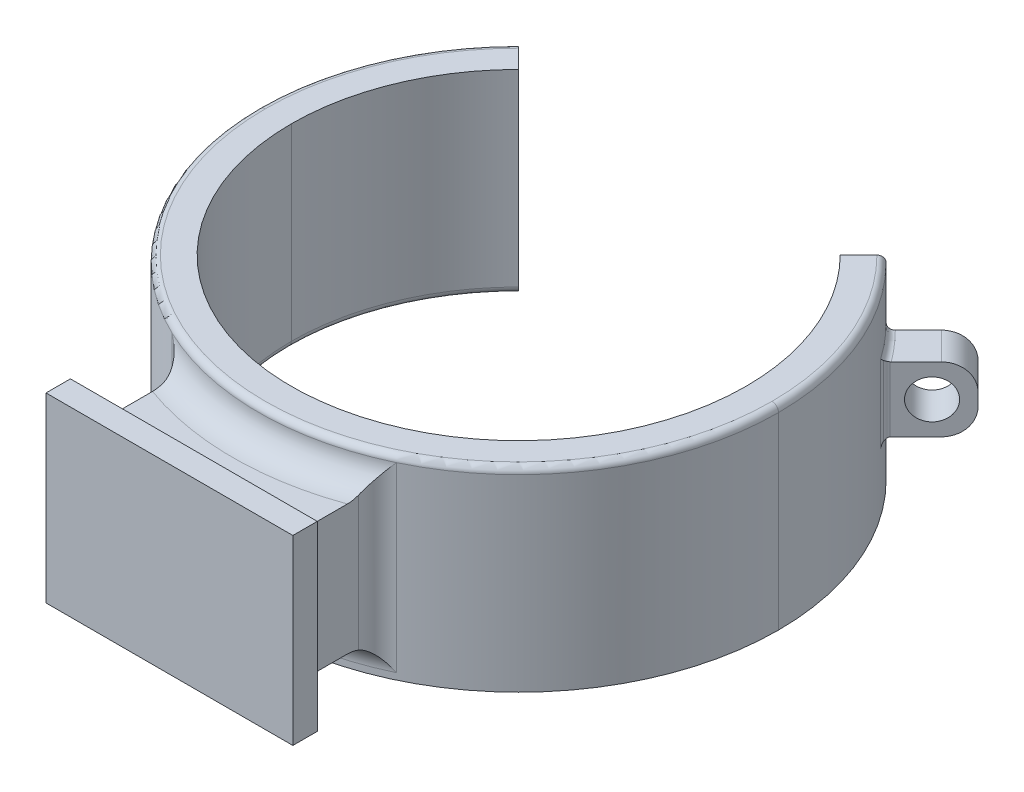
ISO-10303-21;
HEADER;
FILE_DESCRIPTION(('STEP AP214'),'2;1');
FILE_NAME('part.step','',(''),(''),'','','');
FILE_SCHEMA(('AUTOMOTIVE_DESIGN { 1 0 10303 214 1 1 1 1 }'));
ENDSEC;
DATA;
#1=APPLICATION_CONTEXT('core data for automotive mechanical design processes');
#2=APPLICATION_PROTOCOL_DEFINITION('international standard','automotive_design',2000,#1);
#3=PRODUCT_CONTEXT('',#1,'mechanical');
#4=PRODUCT('Part','Part','',(#3));
#5=PRODUCT_RELATED_PRODUCT_CATEGORY('part','',(#4));
#6=PRODUCT_DEFINITION_FORMATION('','',#4);
#7=PRODUCT_DEFINITION_CONTEXT('part definition',#1,'design');
#8=PRODUCT_DEFINITION('design','',#6,#7);
#9=PRODUCT_DEFINITION_SHAPE('','',#8);
#10=(LENGTH_UNIT() NAMED_UNIT(*) SI_UNIT(.MILLI.,.METRE.));
#11=(NAMED_UNIT(*) PLANE_ANGLE_UNIT() SI_UNIT($,.RADIAN.));
#12=(NAMED_UNIT(*) SI_UNIT($,.STERADIAN.) SOLID_ANGLE_UNIT());
#13=UNCERTAINTY_MEASURE_WITH_UNIT(LENGTH_MEASURE(1.E-05),#10,'distance_accuracy_value','');
#14=(GEOMETRIC_REPRESENTATION_CONTEXT(3) GLOBAL_UNCERTAINTY_ASSIGNED_CONTEXT((#13)) GLOBAL_UNIT_ASSIGNED_CONTEXT((#10,
#11,#12)) REPRESENTATION_CONTEXT('',''));
#15=CARTESIAN_POINT('',(0.,0.,0.));
#16=DIRECTION('',(0.,0.,1.));
#17=DIRECTION('',(1.,0.,0.));
#18=AXIS2_PLACEMENT_3D('',#15,#16,#17);
#19=CARTESIAN_POINT('',(-0.601270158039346,4.04912387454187,-34.1043233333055));
#20=DIRECTION('',(1.36933400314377E-10,1.,0.));
#21=DIRECTION('',(-1.,1.36933400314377E-10,0.));
#22=AXIS2_PLACEMENT_3D('',#19,#20,#21);
#23=TOROIDAL_SURFACE('',#22,16.81,0.41);
#24=CARTESIAN_POINT('',(12.8967094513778,3.63912387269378,-44.1233375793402));
#25=CARTESIAN_POINT('',(12.8873644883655,3.63912387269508,-44.1139926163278));
#26=CARTESIAN_POINT('',(12.8780196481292,3.6396449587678,-44.1046477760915));
#27=CARTESIAN_POINT('',(12.8686701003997,3.64069030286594,-44.0952982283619));
#28=CARTESIAN_POINT('',(12.8593835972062,3.64225242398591,-44.0860117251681));
#29=CARTESIAN_POINT('',(12.8501551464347,3.64432937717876,-44.0767832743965));
#30=(BOUNDED_CURVE() B_SPLINE_CURVE(5,(#24,#25,#26,#27,#28,#29),.UNSPECIFIED.,.F.,
.F.) B_SPLINE_CURVE_WITH_KNOTS((6,6),(0.,0.113962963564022),
.UNSPECIFIED.) CURVE() GEOMETRIC_REPRESENTATION_ITEM() RATIONAL_B_SPLINE_CURVE((1.,1.,1.,1.,1.,1.)) REPRESENTATION_ITEM(''));
#31=CARTESIAN_POINT('',(12.8967094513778,3.63912387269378,-44.1233375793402));
#32=VERTEX_POINT('',#31);
#33=CARTESIAN_POINT('',(12.8501551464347,3.64432937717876,-44.0767832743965));
#34=VERTEX_POINT('',#33);
#35=EDGE_CURVE('E472',#32,#34,#30,.T.);
#36=ORIENTED_EDGE('',*,*,#35,.F.);
#37=CARTESIAN_POINT('',(-0.601270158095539,3.63912387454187,-34.1043233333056));
#38=DIRECTION('',(-1.36933400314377E-10,-1.,0.));
#39=DIRECTION('',(-1.,1.36933400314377E-10,0.));
#40=AXIS2_PLACEMENT_3D('',#37,#38,#39);
#41=CIRCLE('',#40,16.81);
#42=CARTESIAN_POINT('',(11.2851948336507,3.63912387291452,-45.990788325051));
#43=VERTEX_POINT('',#42);
#44=EDGE_CURVE('E502',#43,#32,#41,.T.);
#45=ORIENTED_EDGE('',*,*,#44,.F.);
#46=CARTESIAN_POINT('',(11.2851948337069,4.04912387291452,-45.9907883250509));
#47=DIRECTION('',(0.707106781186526,-9.68437649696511E-11,0.707106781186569));
#48=DIRECTION('',(-0.707106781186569,9.68093677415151E-11,0.707106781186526));
#49=AXIS2_PLACEMENT_3D('',#46,#47,#48);
#50=CIRCLE('',#49,0.41);
#51=CARTESIAN_POINT('',(10.9952810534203,4.04912387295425,-45.7008745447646));
#52=VERTEX_POINT('',#51);
#53=EDGE_CURVE('E987',#52,#43,#50,.T.);
#54=ORIENTED_EDGE('',*,*,#53,.F.);
#55=CARTESIAN_POINT('',(-0.601270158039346,4.04912387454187,-34.1043233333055));
#56=DIRECTION('',(1.36933400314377E-10,1.,0.));
#57=DIRECTION('',(-1.,1.36933400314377E-10,0.));
#58=AXIS2_PLACEMENT_3D('',#55,#56,#57);
#59=CIRCLE('',#58,16.4);
#60=CARTESIAN_POINT('',(12.8049143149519,4.04912387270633,-43.5507098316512));
#61=VERTEX_POINT('',#60);
#62=EDGE_CURVE('E1088',#61,#52,#59,.T.);
#63=ORIENTED_EDGE('',*,*,#62,.F.);
#64=CARTESIAN_POINT('',(12.8049143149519,4.04912387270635,-43.5507098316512));
#65=CARTESIAN_POINT('',(12.8010840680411,4.04239137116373,-43.5561455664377));
#66=CARTESIAN_POINT('',(12.7973887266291,4.03565451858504,-43.5616709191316));
#67=CARTESIAN_POINT('',(12.790509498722,4.02264013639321,-43.5725215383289));
#68=CARTESIAN_POINT('',(12.7873079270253,4.01636225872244,-43.5778351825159));
#69=CARTESIAN_POINT('',(12.7813650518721,4.0042756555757,-43.588227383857));
#70=CARTESIAN_POINT('',(12.7786072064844,3.99846581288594,-43.5932951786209));
#71=CARTESIAN_POINT('',(12.7735046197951,3.98731980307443,-43.6031620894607));
#72=CARTESIAN_POINT('',(12.7711444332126,3.98198198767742,-43.6079513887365));
#73=CARTESIAN_POINT('',(12.764904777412,3.96735521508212,-43.6212572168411));
#74=CARTESIAN_POINT('',(12.7612063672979,3.95809121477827,-43.6298872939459));
#75=CARTESIAN_POINT('',(12.7550371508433,3.94143597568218,-43.6457608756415));
#76=CARTESIAN_POINT('',(12.7524672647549,3.93402909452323,-43.6529496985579));
#77=CARTESIAN_POINT('',(12.7483076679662,3.92106063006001,-43.6657365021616));
#78=CARTESIAN_POINT('',(12.7466316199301,3.9154886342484,-43.6712958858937));
#79=CARTESIAN_POINT('',(12.7435538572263,3.90455297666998,-43.682358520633));
#80=CARTESIAN_POINT('',(12.7421455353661,3.89918799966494,-43.687858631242));
#81=CARTESIAN_POINT('',(12.7395902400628,3.8886678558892,-43.6987903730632));
#82=CARTESIAN_POINT('',(12.7384366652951,3.883511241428,-43.7042190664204));
#83=CARTESIAN_POINT('',(12.7363757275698,3.87341100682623,-43.7149980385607));
#84=CARTESIAN_POINT('',(12.7354618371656,3.86846574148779,-43.7203455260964));
#85=CARTESIAN_POINT('',(12.7338662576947,3.85878943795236,-43.7309517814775));
#86=CARTESIAN_POINT('',(12.7331780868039,3.85405660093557,-43.7362079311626));
#87=CARTESIAN_POINT('',(12.7320203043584,3.8448054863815,-43.7466215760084));
#88=CARTESIAN_POINT('',(12.7315442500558,3.8402852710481,-43.7517766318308));
#89=CARTESIAN_POINT('',(12.7307975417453,3.83145867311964,-43.761978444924));
#90=CARTESIAN_POINT('',(12.7305204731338,3.82715023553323,-43.7670229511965));
#91=CARTESIAN_POINT('',(12.7301594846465,3.81874556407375,-43.7769941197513));
#92=CARTESIAN_POINT('',(12.7300691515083,3.81464717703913,-43.7819187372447));
#93=CARTESIAN_POINT('',(12.730068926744,3.81058028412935,-43.78686949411));
#94=B_SPLINE_CURVE_WITH_KNOTS('',3,(#64,#65,#66,#67,#68,#69,#70,#71,#72,#73,#74,#75,#76,#77,#78,
#79,#80,#81,#82,#83,#84,#85,#86,#87,#88,#89,#90,#91,#92,#93),.UNSPECIFIED.,.F.,.F.,(4,2,2,2,2,2,
2,2,2,2,2,2,2,2,4),(0.,0.0283869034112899,0.0548601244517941,0.0794201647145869,
0.10206728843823,0.141620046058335,0.173522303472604,0.197660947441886,0.221091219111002,
0.243814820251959,0.265833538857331,0.287149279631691,0.30776409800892,0.327680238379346,
0.346900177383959),.UNSPECIFIED.);
#95=CARTESIAN_POINT('',(12.730068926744,3.81058028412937,-43.78686949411));
#96=VERTEX_POINT('',#95);
#97=EDGE_CURVE('E11',#61,#96,#94,.T.);
#98=ORIENTED_EDGE('',*,*,#97,.T.);
#99=CARTESIAN_POINT('',(12.730068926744,3.81058028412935,-43.78686949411));
#100=CARTESIAN_POINT('',(12.7300691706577,3.80519599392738,-43.793423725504));
#101=CARTESIAN_POINT('',(12.7302270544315,3.79986696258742,-43.8000242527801));
#102=CARTESIAN_POINT('',(12.7308615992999,3.78949244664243,-43.813113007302));
#103=CARTESIAN_POINT('',(12.7313286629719,3.78444324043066,-43.8195987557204));
#104=CARTESIAN_POINT('',(12.7325648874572,3.77463059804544,-43.8324458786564));
#105=CARTESIAN_POINT('',(12.7333244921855,3.76986313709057,-43.8388050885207));
#106=CARTESIAN_POINT('',(12.7351299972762,3.76061510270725,-43.8513867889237));
#107=CARTESIAN_POINT('',(12.7361663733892,3.75613021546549,-43.8576074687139));
#108=CARTESIAN_POINT('',(12.7385100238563,3.74744708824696,-43.8699001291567));
#109=CARTESIAN_POINT('',(12.7398078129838,3.74324427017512,-43.8759706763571));
#110=CARTESIAN_POINT('',(12.7426596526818,3.7351237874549,-43.8879512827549));
#111=CARTESIAN_POINT('',(12.7442042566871,3.7312013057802,-43.8938603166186));
#112=CARTESIAN_POINT('',(12.7475351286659,3.72363909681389,-43.9055066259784));
#113=CARTESIAN_POINT('',(12.7493120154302,3.7199943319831,-43.9112433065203));
#114=CARTESIAN_POINT('',(12.7530954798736,3.71298334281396,-43.9225332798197));
#115=CARTESIAN_POINT('',(12.7550926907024,3.7096119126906,-43.92808645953));
#116=CARTESIAN_POINT('',(12.7585439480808,3.70430523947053,-43.9370428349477));
#117=CARTESIAN_POINT('',(12.7599103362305,3.7023176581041,-43.9404490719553));
#118=CARTESIAN_POINT('',(12.7627295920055,3.69843544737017,-43.9472134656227));
#119=CARTESIAN_POINT('',(12.7641811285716,3.69653995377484,-43.9505716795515));
#120=CARTESIAN_POINT('',(12.7671693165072,3.69284215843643,-43.9572376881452));
#121=CARTESIAN_POINT('',(12.7687046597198,3.69103898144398,-43.9605455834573));
#122=CARTESIAN_POINT('',(12.771858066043,3.6875262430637,-43.9671093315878));
#123=CARTESIAN_POINT('',(12.7734748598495,3.68581579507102,-43.9703653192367));
#124=CARTESIAN_POINT('',(12.776789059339,3.68248877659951,-43.9768234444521));
#125=CARTESIAN_POINT('',(12.7784852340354,3.68087131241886,-43.9800257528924));
#126=CARTESIAN_POINT('',(12.7819560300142,3.67773045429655,-43.9863747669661));
#127=CARTESIAN_POINT('',(12.7837294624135,3.67620616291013,-43.9895216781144));
#128=CARTESIAN_POINT('',(12.7873526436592,3.67325175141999,-43.9957581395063));
#129=CARTESIAN_POINT('',(12.7892012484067,3.671820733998,-43.998847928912));
#130=CARTESIAN_POINT('',(12.792972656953,3.66905288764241,-44.004968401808));
#131=CARTESIAN_POINT('',(12.7948943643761,3.66771516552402,-44.0079993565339));
#132=CARTESIAN_POINT('',(12.7988098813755,3.66513384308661,-44.0140004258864));
#133=CARTESIAN_POINT('',(12.8008026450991,3.66388935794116,-44.016970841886));
#134=CARTESIAN_POINT('',(12.8048581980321,3.661494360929,-44.0228491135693));
#135=CARTESIAN_POINT('',(12.806919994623,3.66034297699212,-44.0257572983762));
#136=CARTESIAN_POINT('',(12.8111115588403,3.65813395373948,-44.0315094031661));
#137=CARTESIAN_POINT('',(12.8132403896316,3.65707545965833,-44.0343536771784));
#138=CARTESIAN_POINT('',(12.8175639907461,3.65505190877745,-44.0399762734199));
#139=CARTESIAN_POINT('',(12.8197578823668,3.6540860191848,-44.0427549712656));
#140=CARTESIAN_POINT('',(12.8242095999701,3.65224729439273,-44.0482447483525));
#141=CARTESIAN_POINT('',(12.82646660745,3.65137365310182,-44.0509562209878));
#142=CARTESIAN_POINT('',(12.8310425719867,3.64971896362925,-44.0563099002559));
#143=CARTESIAN_POINT('',(12.8333607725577,3.64893714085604,-44.0589525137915));
#144=CARTESIAN_POINT('',(12.8380571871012,3.64746556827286,-44.0641668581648));
#145=CARTESIAN_POINT('',(12.8404347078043,3.64677507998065,-44.0667390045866));
#146=CARTESIAN_POINT('',(12.8452477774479,3.64548553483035,-44.0718107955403));
#147=CARTESIAN_POINT('',(12.847682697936,3.64488578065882,-44.0743108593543));
#148=CARTESIAN_POINT('',(12.8501551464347,3.64432937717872,-44.0767832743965));
#149=B_SPLINE_CURVE_WITH_KNOTS('',3,(#99,#100,#101,#102,#103,#104,#105,#106,#107,#108,#109,#110,
#111,#112,#113,#114,#115,#116,#117,#118,#119,#120,#121,#122,#123,#124,#125,#126,#127,#128,#129,
#130,#131,#132,#133,#134,#135,#136,#137,#138,#139,#140,#141,#142,#143,#144,#145,#146,#147,#148),
.UNSPECIFIED.,.F.,.F.,(4,2,2,2,2,2,2,2,2,2,2,2,2,2,2,2,2,2,2,2,2,2,2,2,4),(0.,
0.0254459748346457,0.0501369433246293,0.07408173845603,0.0972900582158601,0.119772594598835,
0.141541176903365,0.162608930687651,0.182990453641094,0.195509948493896,0.207869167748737,
0.220072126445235,0.232123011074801,0.244026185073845,0.25578619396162,0.267407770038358,
0.278895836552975,0.290255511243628,0.301492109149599,0.312611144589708,0.32361833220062,
0.334519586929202,0.345321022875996,0.356028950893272,0.366649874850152),.UNSPECIFIED.);
#150=EDGE_CURVE('E632',#96,#34,#149,.T.);
#151=ORIENTED_EDGE('',*,*,#150,.T.);
#152=EDGE_LOOP('',(#36,#45,#54,#63,#98,#151));
#153=FACE_BOUND('',#152,.T.);
#154=ADVANCED_FACE('F16',(#153),#23,.F.);
#155=CARTESIAN_POINT('',(13.1400689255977,-4.56087612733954,-43.7868694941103));
#156=DIRECTION('',(1.36933400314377E-10,1.,0.));
#157=DIRECTION('',(-1.,1.36933400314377E-10,0.));
#158=AXIS2_PLACEMENT_3D('',#155,#156,#157);
#159=CYLINDRICAL_SURFACE('',#158,0.41);
#160=DIRECTION('',(1.36933400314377E-10,1.,0.));
#161=VECTOR('',#160,1.);
#162=CARTESIAN_POINT('',(12.7300689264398,1.58912387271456,-43.7868694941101));
#163=LINE('',#162,#161);
#164=CARTESIAN_POINT('',(12.7300689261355,-0.632332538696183,-43.7868694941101));
#165=VERTEX_POINT('',#164);
#166=EDGE_CURVE('E1317',#165,#96,#163,.T.);
#167=ORIENTED_EDGE('',*,*,#166,.T.);
#168=ORIENTED_EDGE('',*,*,#97,.F.);
#169=DIRECTION('',(1.36933367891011E-10,1.,0.));
#170=VECTOR('',#169,1.);
#171=CARTESIAN_POINT('',(12.8049143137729,-4.56087612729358,-43.5507098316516));
#172=LINE('',#171,#170);
#173=CARTESIAN_POINT('',(12.8049143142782,-0.870876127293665,-43.5507098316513));
#174=VERTEX_POINT('',#173);
#175=EDGE_CURVE('E700',#174,#61,#172,.T.);
#176=ORIENTED_EDGE('',*,*,#175,.F.);
#177=CARTESIAN_POINT('',(12.8049143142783,-0.870876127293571,-43.5507098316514));
#178=CARTESIAN_POINT('',(12.8010842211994,-0.864144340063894,-43.5561453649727));
#179=CARTESIAN_POINT('',(12.7973839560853,-0.857416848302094,-43.5616776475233));
#180=CARTESIAN_POINT('',(12.7904917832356,-0.844425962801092,-43.5725464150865));
#181=CARTESIAN_POINT('',(12.7872824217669,-0.838161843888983,-43.577870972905));
#182=CARTESIAN_POINT('',(12.7813268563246,-0.826097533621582,-43.5882808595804));
#183=CARTESIAN_POINT('',(12.7785639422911,-0.820296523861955,-43.5933556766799));
#184=CARTESIAN_POINT('',(12.7734564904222,-0.809159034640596,-43.6032291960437));
#185=CARTESIAN_POINT('',(12.7710961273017,-0.803821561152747,-43.6080186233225));
#186=CARTESIAN_POINT('',(12.7648650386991,-0.789179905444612,-43.6213121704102));
#187=CARTESIAN_POINT('',(12.7611822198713,-0.779889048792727,-43.6299202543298));
#188=CARTESIAN_POINT('',(12.7550472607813,-0.763173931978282,-43.6457461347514));
#189=CARTESIAN_POINT('',(12.7524948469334,-0.75573608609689,-43.6529109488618));
#190=CARTESIAN_POINT('',(12.7483431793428,-0.742744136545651,-43.6656902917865));
#191=CARTESIAN_POINT('',(12.7466629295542,-0.73717090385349,-43.6712591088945));
#192=CARTESIAN_POINT('',(12.7435772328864,-0.72623528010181,-43.6823397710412));
#193=CARTESIAN_POINT('',(12.7421651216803,-0.720871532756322,-43.6878484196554));
#194=CARTESIAN_POINT('',(12.739601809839,-0.710357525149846,-43.698797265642));
#195=CARTESIAN_POINT('',(12.7384439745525,-0.705205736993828,-43.704234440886));
#196=CARTESIAN_POINT('',(12.7363760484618,-0.69511509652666,-43.7150272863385));
#197=CARTESIAN_POINT('',(12.7354593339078,-0.690174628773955,-43.7203801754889));
#198=CARTESIAN_POINT('',(12.7338599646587,-0.680506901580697,-43.7309933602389));
#199=CARTESIAN_POINT('',(12.7331707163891,-0.675777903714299,-43.7362510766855));
#200=CARTESIAN_POINT('',(12.7320125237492,-0.66653321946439,-43.7466638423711));
#201=CARTESIAN_POINT('',(12.7315370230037,-0.662015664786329,-43.7518165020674));
#202=CARTESIAN_POINT('',(12.7307924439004,-0.653193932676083,-43.7620102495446));
#203=CARTESIAN_POINT('',(12.7305168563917,-0.648887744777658,-43.7670491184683));
#204=CARTESIAN_POINT('',(12.7301583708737,-0.640489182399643,-43.7770075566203));
#205=CARTESIAN_POINT('',(12.7300690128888,-0.636394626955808,-43.7819250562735));
#206=CARTESIAN_POINT('',(12.7300689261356,-0.632332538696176,-43.7868694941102));
#207=B_SPLINE_CURVE_WITH_KNOTS('',3,(#177,#178,#179,#180,#181,#182,#183,#184,#185,#186,#187,
#188,#189,#190,#191,#192,#193,#194,#195,#196,#197,#198,#199,#200,#201,#202,#203,#204,#205,#206),
.UNSPECIFIED.,.F.,.F.,(4,2,2,2,2,2,2,2,2,2,2,2,2,2,4),(0.,0.0283848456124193,0.0548569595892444,
0.0794163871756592,0.102063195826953,0.141616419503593,0.17352227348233,0.197685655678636,
0.221133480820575,0.243867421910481,0.265889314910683,0.287201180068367,0.307805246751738,
0.327703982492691,0.346900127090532),.UNSPECIFIED.);
#208=EDGE_CURVE('E29',#174,#165,#207,.T.);
#209=ORIENTED_EDGE('',*,*,#208,.T.);
#210=EDGE_LOOP('',(#167,#168,#176,#209));
#211=FACE_BOUND('',#210,.T.);
#212=ADVANCED_FACE('F612',(#211),#159,.F.);
#213=CARTESIAN_POINT('',(-0.601270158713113,-0.870876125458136,-34.1043233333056));
#214=DIRECTION('',(1.36933400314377E-10,1.,0.));
#215=DIRECTION('',(-1.,1.36933400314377E-10,0.));
#216=AXIS2_PLACEMENT_3D('',#213,#214,#215);
#217=TOROIDAL_SURFACE('',#216,16.81,0.41);
#218=CARTESIAN_POINT('',(-0.601270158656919,-0.460876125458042,-34.1043233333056));
#219=DIRECTION('',(1.36933400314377E-10,1.,0.));
#220=DIRECTION('',(-1.,1.36933400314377E-10,0.));
#221=AXIS2_PLACEMENT_3D('',#218,#219,#220);
#222=CIRCLE('',#221,16.81);
#223=CARTESIAN_POINT('',(12.8967094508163,-0.46087612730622,-44.1233375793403));
#224=VERTEX_POINT('',#223);
#225=CARTESIAN_POINT('',(11.2851948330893,-0.460876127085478,-45.9907883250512));
#226=VERTEX_POINT('',#225);
#227=EDGE_CURVE('E1091',#224,#226,#222,.T.);
#228=ORIENTED_EDGE('',*,*,#227,.F.);
#229=CARTESIAN_POINT('',(12.8501551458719,-0.466081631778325,-44.0767832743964));
#230=CARTESIAN_POINT('',(12.8593835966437,-0.464004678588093,-44.0860117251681));
#231=CARTESIAN_POINT('',(12.868670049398,-0.462442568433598,-44.0952981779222));
#232=CARTESIAN_POINT('',(12.8780195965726,-0.461397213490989,-44.1046477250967));
#233=CARTESIAN_POINT('',(12.887364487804,-0.460876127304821,-44.113992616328));
#234=CARTESIAN_POINT('',(12.8967094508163,-0.46087612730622,-44.1233375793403));
#235=(BOUNDED_CURVE() B_SPLINE_CURVE(5,(#229,#230,#231,#232,#233,#234),.UNSPECIFIED.,.F.,
.F.) B_SPLINE_CURVE_WITH_KNOTS((6,6),(0.,0.113962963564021),
.UNSPECIFIED.) CURVE() GEOMETRIC_REPRESENTATION_ITEM() RATIONAL_B_SPLINE_CURVE((1.,1.,1.,1.,1.,1.)) REPRESENTATION_ITEM(''));
#236=CARTESIAN_POINT('',(12.8501551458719,-0.466081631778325,-44.0767832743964));
#237=VERTEX_POINT('',#236);
#238=EDGE_CURVE('E671',#237,#224,#235,.T.);
#239=ORIENTED_EDGE('',*,*,#238,.F.);
#240=CARTESIAN_POINT('',(12.7300689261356,-0.632332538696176,-43.7868694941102));
#241=CARTESIAN_POINT('',(12.7300690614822,-0.626936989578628,-43.7934378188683));
#242=CARTESIAN_POINT('',(12.7302267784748,-0.621598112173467,-43.8000536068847));
#243=CARTESIAN_POINT('',(12.7308621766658,-0.611207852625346,-43.8131688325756));
#244=CARTESIAN_POINT('',(12.731330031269,-0.606152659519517,-43.8196657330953));
#245=CARTESIAN_POINT('',(12.7325696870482,-0.596329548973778,-43.8325292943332));
#246=CARTESIAN_POINT('',(12.7333316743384,-0.591557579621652,-43.8388937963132));
#247=CARTESIAN_POINT('',(12.7351434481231,-0.582301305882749,-43.8514798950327));
#248=CARTESIAN_POINT('',(12.7361834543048,-0.577812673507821,-43.8576997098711));
#249=CARTESIAN_POINT('',(12.7385348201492,-0.569123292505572,-43.8699851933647));
#250=CARTESIAN_POINT('',(12.7398364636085,-0.564917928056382,-43.8760494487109));
#251=CARTESIAN_POINT('',(12.7426945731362,-0.556795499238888,-43.8880140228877));
#252=CARTESIAN_POINT('',(12.7442414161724,-0.552873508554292,-43.8939132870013));
#253=CARTESIAN_POINT('',(12.7475731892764,-0.545317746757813,-43.9055390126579));
#254=CARTESIAN_POINT('',(12.7493486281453,-0.54167873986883,-43.9112647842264));
#255=CARTESIAN_POINT('',(12.7531214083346,-0.534690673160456,-43.9225372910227));
#256=CARTESIAN_POINT('',(12.7551094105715,-0.531335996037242,-43.9280836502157));
#257=CARTESIAN_POINT('',(12.7585479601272,-0.526051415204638,-43.9370533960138));
#258=CARTESIAN_POINT('',(12.7599133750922,-0.524067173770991,-43.9404776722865));
#259=CARTESIAN_POINT('',(12.7627316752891,-0.520191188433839,-43.947275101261));
#260=CARTESIAN_POINT('',(12.7641831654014,-0.518298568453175,-43.9506483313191));
#261=CARTESIAN_POINT('',(12.7671716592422,-0.514606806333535,-43.9573420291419));
#262=CARTESIAN_POINT('',(12.7687072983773,-0.512806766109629,-43.9606626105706));
#263=CARTESIAN_POINT('',(12.7718619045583,-0.509299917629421,-43.9672489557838));
#264=CARTESIAN_POINT('',(12.7734795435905,-0.507592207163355,-43.9705148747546));
#265=CARTESIAN_POINT('',(12.776795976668,-0.504270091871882,-43.9769900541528));
#266=CARTESIAN_POINT('',(12.7784934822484,-0.502654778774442,-43.9801995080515));
#267=CARTESIAN_POINT('',(12.7819674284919,-0.499517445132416,-43.986559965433));
#268=CARTESIAN_POINT('',(12.7837426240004,-0.497994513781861,-43.9897111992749));
#269=CARTESIAN_POINT('',(12.7873697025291,-0.495041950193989,-43.9959535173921));
#270=CARTESIAN_POINT('',(12.7892203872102,-0.493611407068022,-43.9990448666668));
#271=CARTESIAN_POINT('',(12.7929961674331,-0.490843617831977,-44.0051657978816));
#272=CARTESIAN_POINT('',(12.7949201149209,-0.48950546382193,-44.0081956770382));
#273=CARTESIAN_POINT('',(12.7988401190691,-0.486922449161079,-44.0141921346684));
#274=CARTESIAN_POINT('',(12.8008350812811,-0.485676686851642,-44.0171590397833));
#275=CARTESIAN_POINT('',(12.8048947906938,-0.483278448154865,-44.0230280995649));
#276=CARTESIAN_POINT('',(12.8069585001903,-0.482125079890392,-44.0259306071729));
#277=CARTESIAN_POINT('',(12.8111533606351,-0.47991161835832,-44.0316695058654));
#278=CARTESIAN_POINT('',(12.8132835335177,-0.478850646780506,-44.0345062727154));
#279=CARTESIAN_POINT('',(12.8176089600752,-0.476821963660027,-44.0401124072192));
#280=CARTESIAN_POINT('',(12.8198032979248,-0.475853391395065,-44.0428821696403));
#281=CARTESIAN_POINT('',(12.8242546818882,-0.474009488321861,-44.0483530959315));
#282=CARTESIAN_POINT('',(12.8265108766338,-0.473133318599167,-44.0510546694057));
#283=CARTESIAN_POINT('',(12.831083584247,-0.471474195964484,-44.0563881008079));
#284=CARTESIAN_POINT('',(12.8333993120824,-0.470690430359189,-44.0590203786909));
#285=CARTESIAN_POINT('',(12.838088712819,-0.469216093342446,-44.0642141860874));
#286=CARTESIAN_POINT('',(12.8404616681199,-0.46852473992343,-44.066776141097));
#287=CARTESIAN_POINT('',(12.8452630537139,-0.467235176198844,-44.0718283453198));
#288=CARTESIAN_POINT('',(12.847690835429,-0.466636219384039,-44.0743190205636));
#289=CARTESIAN_POINT('',(12.8501551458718,-0.466081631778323,-44.0767832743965));
#290=B_SPLINE_CURVE_WITH_KNOTS('',3,(#240,#241,#242,#243,#244,#245,#246,#247,#248,#249,#250,
#251,#252,#253,#254,#255,#256,#257,#258,#259,#260,#261,#262,#263,#264,#265,#266,#267,#268,#269,
#270,#271,#272,#273,#274,#275,#276,#277,#278,#279,#280,#281,#282,#283,#284,#285,#286,#287,#288,
#289),.UNSPECIFIED.,.F.,.F.,(4,2,2,2,2,2,2,2,2,2,2,2,2,2,2,2,2,2,2,2,2,2,2,2,4),(0.,
0.0255000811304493,0.0502285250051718,0.0741947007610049,0.0974089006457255,0.119882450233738,
0.141627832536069,0.162658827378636,0.182990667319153,0.195548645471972,0.207940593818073,
0.220170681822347,0.232243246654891,0.244162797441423,0.25593401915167,0.267561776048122,
0.279051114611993,0.290407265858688,0.301635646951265,0.312741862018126,0.323731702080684,
0.334611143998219,0.345386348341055,0.35606365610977,0.366649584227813),.UNSPECIFIED.);
#291=EDGE_CURVE('E667',#165,#237,#290,.T.);
#292=ORIENTED_EDGE('',*,*,#291,.F.);
#293=ORIENTED_EDGE('',*,*,#208,.F.);
#294=CARTESIAN_POINT('',(-0.601270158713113,-0.870876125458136,-34.1043233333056));
#295=DIRECTION('',(-1.36933400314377E-10,-1.,0.));
#296=DIRECTION('',(-1.,1.36933400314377E-10,0.));
#297=AXIS2_PLACEMENT_3D('',#294,#295,#296);
#298=CIRCLE('',#297,16.4);
#299=CARTESIAN_POINT('',(10.9952810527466,-0.870876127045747,-45.7008745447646));
#300=VERTEX_POINT('',#299);
#301=EDGE_CURVE('E412',#300,#174,#298,.T.);
#302=ORIENTED_EDGE('',*,*,#301,.F.);
#303=CARTESIAN_POINT('',(11.2851948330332,-0.870876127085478,-45.9907883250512));
#304=DIRECTION('',(0.707106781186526,-9.68437649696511E-11,0.707106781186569));
#305=DIRECTION('',(-0.707106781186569,9.68093677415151E-11,0.707106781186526));
#306=AXIS2_PLACEMENT_3D('',#303,#304,#305);
#307=CIRCLE('',#306,0.41);
#308=EDGE_CURVE('E407',#226,#300,#307,.T.);
#309=ORIENTED_EDGE('',*,*,#308,.F.);
#310=EDGE_LOOP('',(#228,#239,#292,#293,#302,#309));
#311=FACE_BOUND('',#310,.T.);
#312=ADVANCED_FACE('F672',(#311),#217,.F.);
#313=CARTESIAN_POINT('',(-0.601270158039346,4.04912387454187,-34.1043233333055));
#314=DIRECTION('',(1.36933400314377E-10,1.,0.));
#315=DIRECTION('',(-1.,1.36933400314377E-10,0.));
#316=AXIS2_PLACEMENT_3D('',#313,#314,#315);
#317=TOROIDAL_SURFACE('',#316,16.81,0.41);
#318=CARTESIAN_POINT('',(-12.4877351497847,4.04912387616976,-45.9907883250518));
#319=DIRECTION('',(-0.707106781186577,9.68093677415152E-11,0.707106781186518));
#320=DIRECTION('',(-0.707106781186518,9.68437927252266E-11,-0.707106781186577));
#321=AXIS2_PLACEMENT_3D('',#318,#319,#320);
#322=CIRCLE('',#321,0.41);
#323=CARTESIAN_POINT('',(-12.4877351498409,3.63912387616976,-45.990788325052));
#324=VERTEX_POINT('',#323);
#325=CARTESIAN_POINT('',(-12.1978213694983,4.04912387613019,-45.7008745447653));
#326=VERTEX_POINT('',#325);
#327=EDGE_CURVE('E1077',#324,#326,#322,.T.);
#328=ORIENTED_EDGE('',*,*,#327,.F.);
#329=CARTESIAN_POINT('',(-0.601270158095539,3.63912387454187,-34.1043233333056));
#330=DIRECTION('',(-1.36933400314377E-10,-1.,0.));
#331=DIRECTION('',(-1.,1.36933400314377E-10,0.));
#332=AXIS2_PLACEMENT_3D('',#329,#330,#331);
#333=CIRCLE('',#332,16.81);
#334=CARTESIAN_POINT('',(-14.0992497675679,3.63912387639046,-44.1233375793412));
#335=VERTEX_POINT('',#334);
#336=EDGE_CURVE('E529',#335,#324,#333,.T.);
#337=ORIENTED_EDGE('',*,*,#336,.F.);
#338=CARTESIAN_POINT('',(-14.0526954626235,3.64432938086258,-44.0767832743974));
#339=CARTESIAN_POINT('',(-14.0619239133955,3.64225242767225,-44.0860117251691));
#340=CARTESIAN_POINT('',(-14.0712103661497,3.64069031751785,-44.0952981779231));
#341=CARTESIAN_POINT('',(-14.0805599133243,3.63964496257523,-44.1046477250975));
#342=CARTESIAN_POINT('',(-14.0899048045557,3.63912387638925,-44.1139926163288));
#343=CARTESIAN_POINT('',(-14.0992497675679,3.63912387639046,-44.1233375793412));
#344=(BOUNDED_CURVE() B_SPLINE_CURVE(5,(#338,#339,#340,#341,#342,#343),.UNSPECIFIED.,.F.,
.F.) B_SPLINE_CURVE_WITH_KNOTS((6,6),(0.,0.113962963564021),
.UNSPECIFIED.) CURVE() GEOMETRIC_REPRESENTATION_ITEM() RATIONAL_B_SPLINE_CURVE((1.,1.,1.,1.,1.,1.)) REPRESENTATION_ITEM(''));
#345=CARTESIAN_POINT('',(-14.0526954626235,3.64432938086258,-44.0767832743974));
#346=VERTEX_POINT('',#345);
#347=EDGE_CURVE('E749',#346,#335,#344,.T.);
#348=ORIENTED_EDGE('',*,*,#347,.F.);
#349=CARTESIAN_POINT('',(-14.0526954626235,3.64432938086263,-44.0767832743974));
#350=CARTESIAN_POINT('',(-14.0502238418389,3.64488559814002,-44.0743116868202));
#351=CARTESIAN_POINT('',(-14.0477897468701,3.64548513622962,-44.0718124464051));
#352=CARTESIAN_POINT('',(-14.0429782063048,3.64677421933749,-44.066742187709));
#353=CARTESIAN_POINT('',(-14.0406013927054,3.64746446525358,-44.0641707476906));
#354=CARTESIAN_POINT('',(-14.0359062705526,3.64893553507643,-44.0589577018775));
#355=CARTESIAN_POINT('',(-14.0335886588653,3.64971710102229,-44.0563156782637));
#356=CARTESIAN_POINT('',(-14.0290137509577,3.65137127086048,-44.0509630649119));
#357=CARTESIAN_POINT('',(-14.0267572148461,3.65224465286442,-44.0482520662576));
#358=CARTESIAN_POINT('',(-14.0223063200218,3.65408286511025,-44.0427631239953));
#359=CARTESIAN_POINT('',(-14.0201127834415,3.65504850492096,-44.0399847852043));
#360=CARTESIAN_POINT('',(-14.0157897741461,3.65707157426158,-44.0343627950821));
#361=CARTESIAN_POINT('',(-14.0136611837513,3.65812984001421,-44.0315187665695));
#362=CARTESIAN_POINT('',(-14.0094699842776,3.66033843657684,-44.025767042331));
#363=CARTESIAN_POINT('',(-14.0074083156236,3.66148962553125,-44.0228589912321));
#364=CARTESIAN_POINT('',(-14.0033529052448,3.66388427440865,-44.0169808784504));
#365=CARTESIAN_POINT('',(-14.0013601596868,3.66512860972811,-44.0140104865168));
#366=CARTESIAN_POINT('',(-13.9974445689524,3.66770968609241,-44.0080093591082));
#367=CARTESIAN_POINT('',(-13.9955227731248,3.66904731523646,-44.0049783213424));
#368=CARTESIAN_POINT('',(-13.9917510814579,3.67181504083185,-43.9988575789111));
#369=CARTESIAN_POINT('',(-13.9899022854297,3.67324603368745,-43.9957676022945));
#370=CARTESIAN_POINT('',(-13.9862786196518,3.67620047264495,-43.9895306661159));
#371=CARTESIAN_POINT('',(-13.9845048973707,3.67772481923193,-43.9863834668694));
#372=CARTESIAN_POINT('',(-13.981033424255,3.68086587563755,-43.9800337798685));
#373=CARTESIAN_POINT('',(-13.9793368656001,3.68248348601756,-43.9768310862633));
#374=CARTESIAN_POINT('',(-13.9760218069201,3.68581089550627,-43.9703720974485));
#375=CARTESIAN_POINT('',(-13.9744045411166,3.68752159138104,-43.9671156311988));
#376=CARTESIAN_POINT('',(-13.9712501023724,3.69103493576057,-43.9605508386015));
#377=CARTESIAN_POINT('',(-13.9697142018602,3.69283847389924,-43.9572423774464));
#378=CARTESIAN_POINT('',(-13.9667248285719,3.69653710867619,-43.9505751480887));
#379=CARTESIAN_POINT('',(-13.9652726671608,3.69843308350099,-43.9472162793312));
#380=CARTESIAN_POINT('',(-13.9624520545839,3.70231639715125,-43.9404505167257));
#381=CARTESIAN_POINT('',(-13.9610849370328,3.7043046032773,-43.9370435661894));
#382=CARTESIAN_POINT('',(-13.9576334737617,3.70961055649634,-43.928089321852));
#383=CARTESIAN_POINT('',(-13.9556366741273,3.71298054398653,-43.9225389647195));
#384=CARTESIAN_POINT('',(-13.9518538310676,3.71998887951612,-43.9112537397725));
#385=CARTESIAN_POINT('',(-13.9500771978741,3.72363244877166,-43.9055189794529));
#386=CARTESIAN_POINT('',(-13.9467465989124,3.73119259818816,-43.8938756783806));
#387=CARTESIAN_POINT('',(-13.945202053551,3.7351142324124,-43.8879677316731));
#388=CARTESIAN_POINT('',(-13.9423501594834,3.74323342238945,-43.8759884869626));
#389=CARTESIAN_POINT('',(-13.9410522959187,3.74743581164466,-43.8699182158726));
#390=CARTESIAN_POINT('',(-13.938708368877,3.75611855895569,-43.8576253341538));
#391=CARTESIAN_POINT('',(-13.9376718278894,3.76060351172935,-43.851404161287));
#392=CARTESIAN_POINT('',(-13.9358659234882,3.76985222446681,-43.8388207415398));
#393=CARTESIAN_POINT('',(-13.9351061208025,3.77462031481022,-43.8324603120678));
#394=CARTESIAN_POINT('',(-13.9338694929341,3.78443482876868,-43.8196100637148));
#395=CARTESIAN_POINT('',(-13.9334022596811,3.78948529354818,-43.8131224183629));
#396=CARTESIAN_POINT('',(-13.9327674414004,3.79986299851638,-43.8000292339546));
#397=CARTESIAN_POINT('',(-13.9326094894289,3.80519397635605,-43.7934261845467));
#398=CARTESIAN_POINT('',(-13.9326092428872,3.8105802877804,-43.786869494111));
#399=B_SPLINE_CURVE_WITH_KNOTS('',3,(#349,#350,#351,#352,#353,#354,#355,#356,#357,#358,#359,
#360,#361,#362,#363,#364,#365,#366,#367,#368,#369,#370,#371,#372,#373,#374,#375,#376,#377,#378,
#379,#380,#381,#382,#383,#384,#385,#386,#387,#388,#389,#390,#391,#392,#393,#394,#395,#396,#397,
#398),.UNSPECIFIED.,.F.,.F.,(4,2,2,2,2,2,2,2,2,2,2,2,2,2,2,2,2,2,2,2,2,2,2,2,4),(0.,
0.0106173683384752,0.0213222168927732,0.0321210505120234,0.0430201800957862,0.0540257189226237,
0.0651435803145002,0.076379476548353,0.0877389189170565,0.0992272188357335,0.110849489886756,
0.122610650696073,0.134515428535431,0.146568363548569,0.158773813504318,0.171135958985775,
0.183658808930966,0.204030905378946,0.225091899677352,0.246856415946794,0.269337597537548,
0.29254728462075,0.316496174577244,0.34119396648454,0.366649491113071),.UNSPECIFIED.);
#400=CARTESIAN_POINT('',(-13.9326092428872,3.81058028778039,-43.7868694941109));
#401=VERTEX_POINT('',#400);
#402=EDGE_CURVE('E744',#346,#401,#399,.T.);
#403=ORIENTED_EDGE('',*,*,#402,.T.);
#404=CARTESIAN_POINT('',(-13.9326092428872,3.8105802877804,-43.786869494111));
#405=CARTESIAN_POINT('',(-13.9326094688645,3.81464602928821,-43.7819201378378));
#406=CARTESIAN_POINT('',(-13.9326997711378,3.81874323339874,-43.7769968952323));
#407=CARTESIAN_POINT('',(-13.9330606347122,3.82714582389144,-43.7670280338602));
#408=CARTESIAN_POINT('',(-13.9333376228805,3.83145336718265,-43.7619844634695));
#409=CARTESIAN_POINT('',(-13.9340841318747,3.84027848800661,-43.7517840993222));
#410=CARTESIAN_POINT('',(-13.9345600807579,3.84479812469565,-43.7466295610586));
#411=CARTESIAN_POINT('',(-13.9357176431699,3.85404841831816,-43.7362165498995));
#412=CARTESIAN_POINT('',(-13.9364057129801,3.85878101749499,-43.7309605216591));
#413=CARTESIAN_POINT('',(-13.9380011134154,3.86845720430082,-43.7203541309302));
#414=CARTESIAN_POINT('',(-13.9389149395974,3.87340259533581,-43.7150063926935));
#415=CARTESIAN_POINT('',(-13.9409758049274,3.88350346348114,-43.7042265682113));
#416=CARTESIAN_POINT('',(-13.9421293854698,3.88866059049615,-43.6987972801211));
#417=CARTESIAN_POINT('',(-13.9446847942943,3.89918215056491,-43.6878640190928));
#418=CARTESIAN_POINT('',(-13.9460932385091,3.90454803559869,-43.6823629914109));
#419=CARTESIAN_POINT('',(-13.9491713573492,3.91548595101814,-43.6712982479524));
#420=CARTESIAN_POINT('',(-13.9508476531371,3.92105930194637,-43.6657376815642));
#421=CARTESIAN_POINT('',(-13.9550061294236,3.9340249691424,-43.6529539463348));
#422=CARTESIAN_POINT('',(-13.9575743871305,3.94142764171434,-43.6457692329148));
#423=CARTESIAN_POINT('',(-13.96374099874,3.95807716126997,-43.6299008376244));
#424=CARTESIAN_POINT('',(-13.967438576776,3.96733965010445,-43.6212718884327));
#425=CARTESIAN_POINT('',(-13.9736772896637,3.98196523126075,-43.6079666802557));
#426=CARTESIAN_POINT('',(-13.9760374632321,3.98730336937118,-43.6031769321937));
#427=CARTESIAN_POINT('',(-13.9811403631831,3.99845075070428,-43.5933084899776));
#428=CARTESIAN_POINT('',(-13.9838985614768,4.0042616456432,-43.5882396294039));
#429=CARTESIAN_POINT('',(-13.9898425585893,4.01635109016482,-43.5778447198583));
#430=CARTESIAN_POINT('',(-13.9930449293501,4.02263075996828,-43.5725294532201));
#431=CARTESIAN_POINT('',(-13.9999262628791,4.0356494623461,-43.5616750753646));
#432=CARTESIAN_POINT('',(-14.0036229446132,4.04238884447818,-43.5561476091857));
#433=CARTESIAN_POINT('',(-14.0074546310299,4.04912387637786,-43.5507098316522));
#434=B_SPLINE_CURVE_WITH_KNOTS('',3,(#404,#405,#406,#407,#408,#409,#410,#411,#412,#413,#414,
#415,#416,#417,#418,#419,#420,#421,#422,#423,#424,#425,#426,#427,#428,#429,#430,#431,#432,#433),
.UNSPECIFIED.,.F.,.F.,(4,2,2,2,2,2,2,2,2,2,2,2,2,2,4),(0.,0.0192144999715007,0.039126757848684,
0.0597392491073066,0.0810542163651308,0.103073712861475,0.125799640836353,0.149233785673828,
0.173377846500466,0.205261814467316,0.244808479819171,0.267457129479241,0.292021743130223,
0.318502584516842,0.346900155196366),.UNSPECIFIED.);
#435=CARTESIAN_POINT('',(-14.0074546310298,4.04912387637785,-43.5507098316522));
#436=VERTEX_POINT('',#435);
#437=EDGE_CURVE('E707',#401,#436,#434,.T.);
#438=ORIENTED_EDGE('',*,*,#437,.T.);
#439=CARTESIAN_POINT('',(-0.601270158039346,4.04912387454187,-34.1043233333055));
#440=DIRECTION('',(1.36933400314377E-10,1.,0.));
#441=DIRECTION('',(-1.,1.36933400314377E-10,0.));
#442=AXIS2_PLACEMENT_3D('',#439,#440,#441);
#443=CIRCLE('',#442,16.4);
#444=EDGE_CURVE('E1004',#326,#436,#443,.T.);
#445=ORIENTED_EDGE('',*,*,#444,.F.);
#446=EDGE_LOOP('',(#328,#337,#348,#403,#438,#445));
#447=FACE_BOUND('',#446,.T.);
#448=ADVANCED_FACE('F682',(#447),#317,.F.);
#449=CARTESIAN_POINT('',(-14.3426092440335,-4.56087612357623,-43.7868694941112));
#450=DIRECTION('',(1.36933400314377E-10,1.,0.));
#451=DIRECTION('',(-1.,1.36933400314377E-10,0.));
#452=AXIS2_PLACEMENT_3D('',#449,#450,#451);
#453=CYLINDRICAL_SURFACE('',#452,0.41);
#454=DIRECTION('',(-1.36933400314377E-10,-1.,0.));
#455=VECTOR('',#454,1.);
#456=CARTESIAN_POINT('',(-13.9326092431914,1.58912387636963,-43.786869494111));
#457=LINE('',#456,#455);
#458=CARTESIAN_POINT('',(-13.9326092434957,-0.632332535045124,-43.7868694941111));
#459=VERTEX_POINT('',#458);
#460=EDGE_CURVE('E1301',#401,#459,#457,.T.);
#461=ORIENTED_EDGE('',*,*,#460,.T.);
#462=CARTESIAN_POINT('',(-13.9326092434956,-0.632332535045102,-43.7868694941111));
#463=CARTESIAN_POINT('',(-13.9326093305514,-0.636393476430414,-43.7819264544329));
#464=CARTESIAN_POINT('',(-13.9326986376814,-0.640486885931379,-43.7770103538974));
#465=CARTESIAN_POINT('',(-13.9330569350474,-0.648883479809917,-43.767054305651));
#466=CARTESIAN_POINT('',(-13.9333323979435,-0.653188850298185,-43.7620164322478));
#467=CARTESIAN_POINT('',(-13.9340766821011,-0.662009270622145,-43.7518242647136));
#468=CARTESIAN_POINT('',(-13.9345520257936,-0.666526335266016,-43.746672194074));
#469=CARTESIAN_POINT('',(-13.9357099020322,-0.675770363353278,-43.7362601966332));
#470=CARTESIAN_POINT('',(-13.9363990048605,-0.680499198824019,-43.7310026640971));
#471=CARTESIAN_POINT('',(-13.9379981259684,-0.690166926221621,-43.7203894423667));
#472=CARTESIAN_POINT('',(-13.9389147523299,-0.69510755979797,-43.7150363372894));
#473=CARTESIAN_POINT('',(-13.9409825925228,-0.705198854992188,-43.7042426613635));
#474=CARTESIAN_POINT('',(-13.9421404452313,-0.71035113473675,-43.6988048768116));
#475=CARTESIAN_POINT('',(-13.9447039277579,-0.720866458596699,-43.6878544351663));
#476=CARTESIAN_POINT('',(-13.9461162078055,-0.726231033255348,-43.6823448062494));
#477=CARTESIAN_POINT('',(-13.9492024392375,-0.737168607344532,-43.6712617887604));
#478=CARTESIAN_POINT('',(-13.9508830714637,-0.742742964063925,-43.66569160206));
#479=CARTESIAN_POINT('',(-13.9550338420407,-0.755731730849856,-43.6529150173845));
#480=CARTESIAN_POINT('',(-13.9575847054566,-0.763165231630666,-43.6457542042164));
#481=CARTESIAN_POINT('',(-13.9637171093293,-0.779874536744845,-43.6299334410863));
#482=CARTESIAN_POINT('',(-13.9673990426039,-0.789163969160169,-43.6213265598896));
#483=CARTESIAN_POINT('',(-13.9736291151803,-0.80380455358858,-43.6080337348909));
#484=CARTESIAN_POINT('',(-13.9759894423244,-0.809142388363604,-43.6032438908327));
#485=CARTESIAN_POINT('',(-13.9810971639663,-0.820281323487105,-43.5933689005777));
#486=CARTESIAN_POINT('',(-13.9838604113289,-0.826083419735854,-43.588293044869));
#487=CARTESIAN_POINT('',(-13.9898170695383,-0.838150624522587,-43.5778804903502));
#488=CARTESIAN_POINT('',(-13.9930272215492,-0.844416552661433,-43.5725543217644));
#489=CARTESIAN_POINT('',(-13.9999214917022,-0.857411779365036,-43.5616818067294));
#490=CARTESIAN_POINT('',(-14.0036230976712,-0.864141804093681,-43.5561474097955));
#491=CARTESIAN_POINT('',(-14.0074546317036,-0.870876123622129,-43.5507098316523));
#492=B_SPLINE_CURVE_WITH_KNOTS('',3,(#462,#463,#464,#465,#466,#467,#468,#469,#470,#471,#472,
#473,#474,#475,#476,#477,#478,#479,#480,#481,#482,#483,#484,#485,#486,#487,#488,#489,#490,#491),
.UNSPECIFIED.,.F.,.F.,(4,2,2,2,2,2,2,2,2,2,2,2,2,2,4),(0.,0.0191907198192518,0.0390855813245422,
0.0596873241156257,0.0809984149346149,0.103021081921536,0.125757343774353,0.149209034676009,
0.173377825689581,0.205265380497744,0.244812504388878,0.267460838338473,0.292024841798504,
0.31850458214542,0.34690010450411),.UNSPECIFIED.);
#493=CARTESIAN_POINT('',(-14.0074546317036,-0.870876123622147,-43.5507098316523));
#494=VERTEX_POINT('',#493);
#495=EDGE_CURVE('E1199',#459,#494,#492,.T.);
#496=ORIENTED_EDGE('',*,*,#495,.T.);
#497=DIRECTION('',(-1.36933367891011E-10,-1.,0.));
#498=VECTOR('',#497,1.);
#499=CARTESIAN_POINT('',(-14.0074546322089,-4.56087612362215,-43.5507098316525));
#500=LINE('',#499,#498);
#501=EDGE_CURVE('E810',#436,#494,#500,.T.);
#502=ORIENTED_EDGE('',*,*,#501,.F.);
#503=ORIENTED_EDGE('',*,*,#437,.F.);
#504=EDGE_LOOP('',(#461,#496,#502,#503));
#505=FACE_BOUND('',#504,.T.);
#506=ADVANCED_FACE('F723',(#505),#453,.F.);
#507=CARTESIAN_POINT('',(-0.601270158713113,-0.870876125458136,-34.1043233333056));
#508=DIRECTION('',(1.36933400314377E-10,1.,0.));
#509=DIRECTION('',(-1.,1.36933400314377E-10,0.));
#510=AXIS2_PLACEMENT_3D('',#507,#508,#509);
#511=TOROIDAL_SURFACE('',#510,16.81,0.41);
#512=CARTESIAN_POINT('',(-12.4877351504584,-0.870876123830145,-45.990788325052));
#513=DIRECTION('',(-0.707106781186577,9.68093677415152E-11,0.707106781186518));
#514=DIRECTION('',(-0.707106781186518,9.68437927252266E-11,-0.707106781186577));
#515=AXIS2_PLACEMENT_3D('',#512,#513,#514);
#516=CIRCLE('',#515,0.41);
#517=CARTESIAN_POINT('',(-12.1978213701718,-0.870876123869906,-45.7008745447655));
#518=VERTEX_POINT('',#517);
#519=CARTESIAN_POINT('',(-12.4877351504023,-0.460876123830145,-45.9907883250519));
#520=VERTEX_POINT('',#519);
#521=EDGE_CURVE('E1080',#518,#520,#516,.T.);
#522=ORIENTED_EDGE('',*,*,#521,.F.);
#523=CARTESIAN_POINT('',(-0.601270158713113,-0.870876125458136,-34.1043233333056));
#524=DIRECTION('',(-1.36933400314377E-10,-1.,0.));
#525=DIRECTION('',(-1.,1.36933400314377E-10,0.));
#526=AXIS2_PLACEMENT_3D('',#523,#524,#525);
#527=CIRCLE('',#526,16.4);
#528=EDGE_CURVE('E534',#494,#518,#527,.T.);
#529=ORIENTED_EDGE('',*,*,#528,.F.);
#530=ORIENTED_EDGE('',*,*,#495,.F.);
#531=CARTESIAN_POINT('',(-14.0526954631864,-0.466081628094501,-44.0767832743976));
#532=CARTESIAN_POINT('',(-14.0502319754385,-0.466636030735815,-44.0743198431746));
#533=CARTESIAN_POINT('',(-14.0478049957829,-0.467234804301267,-44.0718300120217));
#534=CARTESIAN_POINT('',(-14.0430050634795,-0.46852402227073,-44.0667794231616));
#535=CARTESIAN_POINT('',(-14.0406327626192,-0.469215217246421,-44.064218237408));
#536=CARTESIAN_POINT('',(-14.0359445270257,-0.470689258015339,-44.059025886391));
#537=CARTESIAN_POINT('',(-14.0336293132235,-0.471472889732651,-44.0563942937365));
#538=CARTESIAN_POINT('',(-14.0290574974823,-0.473131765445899,-44.051062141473));
#539=CARTESIAN_POINT('',(-14.0268016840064,-0.474007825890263,-44.0483611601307));
#540=CARTESIAN_POINT('',(-14.0223509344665,-0.475851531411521,-44.0428913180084));
#541=CARTESIAN_POINT('',(-14.0201568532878,-0.47682001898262,-44.040122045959));
#542=CARTESIAN_POINT('',(-14.0158318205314,-0.47884855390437,-44.0345167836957));
#543=CARTESIAN_POINT('',(-14.0137017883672,-0.479909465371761,-44.0316803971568));
#544=CARTESIAN_POINT('',(-14.009507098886,-0.482122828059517,-44.0259421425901));
#545=CARTESIAN_POINT('',(-14.0074434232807,-0.483276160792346,-44.023039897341));
#546=CARTESIAN_POINT('',(-14.0033836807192,-0.485674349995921,-44.0171712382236));
#547=CARTESIAN_POINT('',(-14.0013886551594,-0.486920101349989,-44.0142044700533));
#548=CARTESIAN_POINT('',(-13.9974684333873,-0.48950311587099,-44.0082081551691));
#549=CARTESIAN_POINT('',(-13.9955443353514,-0.490841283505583,-44.0051782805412));
#550=CARTESIAN_POINT('',(-13.9917681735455,-0.49360912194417,-43.9990572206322));
#551=CARTESIAN_POINT('',(-13.9899172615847,-0.495039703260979,-43.9959657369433));
#552=CARTESIAN_POINT('',(-13.9862896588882,-0.49799236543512,-43.9897230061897));
#553=CARTESIAN_POINT('',(-13.9845141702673,-0.499515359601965,-43.9865714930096));
#554=CARTESIAN_POINT('',(-13.9810395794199,-0.5026528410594,-43.9802103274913));
#555=CARTESIAN_POINT('',(-13.9793417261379,-0.50426824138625,-43.977000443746));
#556=CARTESIAN_POINT('',(-13.976024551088,-0.507590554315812,-43.9705242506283));
#557=CARTESIAN_POINT('',(-13.9744065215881,-0.509298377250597,-43.9672577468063));
#558=CARTESIAN_POINT('',(-13.971251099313,-0.512805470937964,-43.9606700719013));
#559=CARTESIAN_POINT('',(-13.9697150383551,-0.514605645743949,-43.9573487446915));
#560=CARTESIAN_POINT('',(-13.9667256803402,-0.518297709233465,-43.9506533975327));
#561=CARTESIAN_POINT('',(-13.9652737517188,-0.520190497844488,-43.9472792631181));
#562=CARTESIAN_POINT('',(-13.9624545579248,-0.524066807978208,-43.9404798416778));
#563=CARTESIAN_POINT('',(-13.9610886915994,-0.526051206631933,-43.9370544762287));
#564=CARTESIAN_POINT('',(-13.9576506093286,-0.531333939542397,-43.9280859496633));
#565=CARTESIAN_POINT('',(-13.9556633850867,-0.534686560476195,-43.9225419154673));
#566=CARTESIAN_POINT('',(-13.9518917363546,-0.541671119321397,-43.911273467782));
#567=CARTESIAN_POINT('',(-13.9501166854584,-0.545308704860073,-43.9055494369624));
#568=CARTESIAN_POINT('',(-13.9467853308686,-0.552862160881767,-43.8939265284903));
#569=CARTESIAN_POINT('',(-13.945238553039,-0.556783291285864,-43.8880283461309));
#570=CARTESIAN_POINT('',(-13.942380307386,-0.564904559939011,-43.8760652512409));
#571=CARTESIAN_POINT('',(-13.9410784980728,-0.569109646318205,-43.8700013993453));
#572=CARTESIAN_POINT('',(-13.9387266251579,-0.577799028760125,-43.8577160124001));
#573=CARTESIAN_POINT('',(-13.9376863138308,-0.582287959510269,-43.8514958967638));
#574=CARTESIAN_POINT('',(-13.9358738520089,-0.591545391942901,-43.8389084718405));
#575=CARTESIAN_POINT('',(-13.9351115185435,-0.596318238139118,-43.8325429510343));
#576=CARTESIAN_POINT('',(-13.9338711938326,-0.606143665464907,-43.8196766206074));
#577=CARTESIAN_POINT('',(-13.9334030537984,-0.611200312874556,-43.8131779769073));
#578=CARTESIAN_POINT('',(-13.9327672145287,-0.621594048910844,-43.8000585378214));
#579=CARTESIAN_POINT('',(-13.9326093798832,-0.626934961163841,-43.7934402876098));
#580=CARTESIAN_POINT('',(-13.9326092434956,-0.632332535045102,-43.7868694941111));
#581=B_SPLINE_CURVE_WITH_KNOTS('',3,(#531,#532,#533,#534,#535,#536,#537,#538,#539,#540,#541,
#542,#543,#544,#545,#546,#547,#548,#549,#550,#551,#552,#553,#554,#555,#556,#557,#558,#559,#560,
#561,#562,#563,#564,#565,#566,#567,#568,#569,#570,#571,#572,#573,#574,#575,#576,#577,#578,#579,
#580),.UNSPECIFIED.,.F.,.F.,(4,2,2,2,2,2,2,2,2,2,2,2,2,2,2,2,2,2,2,2,2,2,2,2,4),(0.,
0.0105823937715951,0.0212566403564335,0.0320292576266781,0.0429065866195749,0.0538947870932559,
0.0649998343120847,0.076227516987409,0.087583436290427,0.0990730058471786,0.110701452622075,
0.122473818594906,0.134394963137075,0.146469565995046,0.158702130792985,0.171096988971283,
0.183658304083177,0.203980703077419,0.225004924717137,0.246746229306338,0.269218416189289,
0.29243398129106,0.316404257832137,0.341139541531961,0.36664920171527),.UNSPECIFIED.);
#582=CARTESIAN_POINT('',(-14.0526954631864,-0.466081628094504,-44.0767832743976));
#583=VERTEX_POINT('',#582);
#584=EDGE_CURVE('E511',#583,#459,#581,.T.);
#585=ORIENTED_EDGE('',*,*,#584,.F.);
#586=CARTESIAN_POINT('',(-14.0992497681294,-0.460876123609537,-44.1233375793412));
#587=CARTESIAN_POINT('',(-14.0899048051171,-0.460876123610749,-44.113992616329));
#588=CARTESIAN_POINT('',(-14.0805599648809,-0.461397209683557,-44.1046477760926));
#589=CARTESIAN_POINT('',(-14.0712104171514,-0.462442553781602,-44.0952982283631));
#590=CARTESIAN_POINT('',(-14.0619239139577,-0.464004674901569,-44.086011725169));
#591=CARTESIAN_POINT('',(-14.0526954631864,-0.466081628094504,-44.0767832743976));
#592=(BOUNDED_CURVE() B_SPLINE_CURVE(5,(#586,#587,#588,#589,#590,#591),.UNSPECIFIED.,.F.,
.F.) B_SPLINE_CURVE_WITH_KNOTS((6,6),(0.,0.113962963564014),
.UNSPECIFIED.) CURVE() GEOMETRIC_REPRESENTATION_ITEM() RATIONAL_B_SPLINE_CURVE((1.,1.,1.,1.,1.,1.)) REPRESENTATION_ITEM(''));
#593=CARTESIAN_POINT('',(-14.0992497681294,-0.460876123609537,-44.1233375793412));
#594=VERTEX_POINT('',#593);
#595=EDGE_CURVE('E784',#594,#583,#592,.T.);
#596=ORIENTED_EDGE('',*,*,#595,.F.);
#597=CARTESIAN_POINT('',(-0.601270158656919,-0.460876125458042,-34.1043233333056));
#598=DIRECTION('',(1.36933400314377E-10,1.,0.));
#599=DIRECTION('',(-1.,1.36933400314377E-10,0.));
#600=AXIS2_PLACEMENT_3D('',#597,#598,#599);
#601=CIRCLE('',#600,16.81);
#602=EDGE_CURVE('E463',#520,#594,#601,.T.);
#603=ORIENTED_EDGE('',*,*,#602,.F.);
#604=EDGE_LOOP('',(#522,#529,#530,#585,#596,#603));
#605=FACE_BOUND('',#604,.T.);
#606=ADVANCED_FACE('F786',(#605),#511,.F.);
#607=CARTESIAN_POINT('',(-13.9373040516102,1.17912387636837,-47.4403572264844));
#608=DIRECTION('',(0.707106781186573,-9.68093954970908E-11,-0.707106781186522));
#609=DIRECTION('',(0.707106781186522,-9.6843764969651E-11,0.707106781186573));
#610=AXIS2_PLACEMENT_3D('',#607,#608,#609);
#611=CYLINDRICAL_SURFACE('',#610,1.64);
#612=CARTESIAN_POINT('',(-15.6767867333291,1.17912387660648,-45.7008745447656));
#613=DIRECTION('',(-0.707106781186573,9.68093954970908E-11,0.707106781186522));
#614=DIRECTION('',(0.707106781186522,-9.6843764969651E-11,0.707106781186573));
#615=AXIS2_PLACEMENT_3D('',#612,#613,#614);
#616=CIRCLE('',#615,1.64);
#617=CARTESIAN_POINT('',(-16.8364418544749,1.17912387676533,-46.8605296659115));
#618=VERTEX_POINT('',#617);
#619=CARTESIAN_POINT('',(-15.6767867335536,-0.460876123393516,-45.7008745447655));
#620=VERTEX_POINT('',#619);
#621=EDGE_CURVE('E965',#618,#620,#616,.T.);
#622=ORIENTED_EDGE('',*,*,#621,.F.);
#623=DIRECTION('',(-0.707106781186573,9.68093903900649E-11,0.707106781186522));
#624=VECTOR('',#623,1.);
#625=CARTESIAN_POINT('',(-15.096959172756,1.17912387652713,-48.6000123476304));
#626=LINE('',#625,#624);
#627=CARTESIAN_POINT('',(-15.096959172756,1.17912387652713,-48.6000123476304));
#628=VERTEX_POINT('',#627);
#629=EDGE_CURVE('E467',#628,#618,#626,.T.);
#630=ORIENTED_EDGE('',*,*,#629,.F.);
#631=CARTESIAN_POINT('',(-13.93730405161,1.17912387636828,-47.4403572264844));
#632=DIRECTION('',(0.707106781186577,-9.68093677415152E-11,-0.707106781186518));
#633=DIRECTION('',(-0.707106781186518,9.68437927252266E-11,-0.707106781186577));
#634=AXIS2_PLACEMENT_3D('',#631,#632,#633);
#635=CIRCLE('',#634,1.64);
#636=CARTESIAN_POINT('',(-13.9373040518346,-0.460876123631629,-47.4403572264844));
#637=VERTEX_POINT('',#636);
#638=EDGE_CURVE('E501',#637,#628,#635,.T.);
#639=ORIENTED_EDGE('',*,*,#638,.F.);
#640=DIRECTION('',(0.707106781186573,-9.68093903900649E-11,-0.707106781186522));
#641=VECTOR('',#640,1.);
#642=CARTESIAN_POINT('',(-13.9373040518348,-0.460876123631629,-47.4403572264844));
#643=LINE('',#642,#641);
#644=EDGE_CURVE('E466',#620,#637,#643,.T.);
#645=ORIENTED_EDGE('',*,*,#644,.F.);
#646=EDGE_LOOP('',(#622,#630,#639,#645));
#647=FACE_BOUND('',#646,.T.);
#648=ADVANCED_FACE('F794',(#647),#611,.T.);
#649=CARTESIAN_POINT('',(-13.9373040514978,1.99912387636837,-47.4403572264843));
#650=DIRECTION('',(-0.707106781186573,9.68093954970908E-11,0.707106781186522));
#651=DIRECTION('',(-0.707106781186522,9.6843764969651E-11,-0.707106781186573));
#652=AXIS2_PLACEMENT_3D('',#649,#650,#651);
#653=CYLINDRICAL_SURFACE('',#652,1.64);
#654=CARTESIAN_POINT('',(-15.6767867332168,1.99912387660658,-45.7008745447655));
#655=DIRECTION('',(-0.707106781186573,9.68093954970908E-11,0.707106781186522));
#656=DIRECTION('',(0.707106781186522,-9.6843764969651E-11,0.707106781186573));
#657=AXIS2_PLACEMENT_3D('',#654,#655,#656);
#658=CIRCLE('',#657,1.64);
#659=CARTESIAN_POINT('',(-15.6767867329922,3.63912387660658,-45.7008745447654));
#660=VERTEX_POINT('',#659);
#661=CARTESIAN_POINT('',(-16.8364418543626,1.99912387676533,-46.8605296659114));
#662=VERTEX_POINT('',#661);
#663=EDGE_CURVE('E966',#660,#662,#658,.T.);
#664=ORIENTED_EDGE('',*,*,#663,.F.);
#665=DIRECTION('',(-0.707106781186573,9.68093903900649E-11,0.707106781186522));
#666=VECTOR('',#665,1.);
#667=CARTESIAN_POINT('',(-15.6767867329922,3.63912387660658,-45.7008745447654));
#668=LINE('',#667,#666);
#669=CARTESIAN_POINT('',(-13.9373040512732,3.63912387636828,-47.4403572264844));
#670=VERTEX_POINT('',#669);
#671=EDGE_CURVE('E525',#670,#660,#668,.T.);
#672=ORIENTED_EDGE('',*,*,#671,.F.);
#673=CARTESIAN_POINT('',(-13.9373040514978,1.99912387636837,-47.4403572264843));
#674=DIRECTION('',(0.707106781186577,-9.68093677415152E-11,-0.707106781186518));
#675=DIRECTION('',(-0.707106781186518,9.68437927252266E-11,-0.707106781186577));
#676=AXIS2_PLACEMENT_3D('',#673,#674,#675);
#677=CIRCLE('',#676,1.64);
#678=CARTESIAN_POINT('',(-15.0969591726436,1.99912387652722,-48.6000123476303));
#679=VERTEX_POINT('',#678);
#680=EDGE_CURVE('E434',#679,#670,#677,.T.);
#681=ORIENTED_EDGE('',*,*,#680,.F.);
#682=DIRECTION('',(0.707106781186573,-9.68093903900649E-11,-0.707106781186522));
#683=VECTOR('',#682,1.);
#684=CARTESIAN_POINT('',(-15.0969591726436,1.99912387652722,-48.6000123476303));
#685=LINE('',#684,#683);
#686=EDGE_CURVE('E979',#662,#679,#685,.T.);
#687=ORIENTED_EDGE('',*,*,#686,.F.);
#688=EDGE_LOOP('',(#664,#672,#681,#687));
#689=FACE_BOUND('',#688,.T.);
#690=ADVANCED_FACE('F1267',(#689),#653,.T.);
#691=CARTESIAN_POINT('',(12.7347637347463,1.17912387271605,-47.4403572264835));
#692=DIRECTION('',(0.707106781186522,-9.68437649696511E-11,0.707106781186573));
#693=DIRECTION('',(-0.707106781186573,9.68093954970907E-11,0.707106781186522));
#694=AXIS2_PLACEMENT_3D('',#691,#692,#693);
#695=CYLINDRICAL_SURFACE('',#694,1.64);
#696=CARTESIAN_POINT('',(14.4742464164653,1.17912387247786,-45.7008745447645));
#697=DIRECTION('',(0.707106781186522,-9.68437649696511E-11,0.707106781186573));
#698=DIRECTION('',(-0.707106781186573,9.68093954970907E-11,0.707106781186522));
#699=AXIS2_PLACEMENT_3D('',#696,#697,#698);
#700=CIRCLE('',#699,1.64);
#701=CARTESIAN_POINT('',(14.4742464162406,-0.460876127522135,-45.7008745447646));
#702=VERTEX_POINT('',#701);
#703=CARTESIAN_POINT('',(15.6339015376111,1.17912387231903,-46.8605296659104));
#704=VERTEX_POINT('',#703);
#705=EDGE_CURVE('E585',#702,#704,#700,.T.);
#706=ORIENTED_EDGE('',*,*,#705,.F.);
#707=DIRECTION('',(0.707106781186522,-9.68437671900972E-11,0.707106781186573));
#708=VECTOR('',#707,1.);
#709=CARTESIAN_POINT('',(14.4742464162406,-0.460876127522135,-45.7008745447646));
#710=LINE('',#709,#708);
#711=CARTESIAN_POINT('',(12.7347637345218,-0.460876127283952,-47.4403572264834));
#712=VERTEX_POINT('',#711);
#713=EDGE_CURVE('E505',#712,#702,#710,.T.);
#714=ORIENTED_EDGE('',*,*,#713,.F.);
#715=CARTESIAN_POINT('',(12.7347637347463,1.17912387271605,-47.4403572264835));
#716=DIRECTION('',(-0.707106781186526,9.68437649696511E-11,-0.707106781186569));
#717=DIRECTION('',(-0.707106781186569,9.68093677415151E-11,0.707106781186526));
#718=AXIS2_PLACEMENT_3D('',#715,#716,#717);
#719=CIRCLE('',#718,1.64);
#720=CARTESIAN_POINT('',(13.8944188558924,1.1791238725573,-48.6000123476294));
#721=VERTEX_POINT('',#720);
#722=EDGE_CURVE('E443',#721,#712,#719,.T.);
#723=ORIENTED_EDGE('',*,*,#722,.F.);
#724=DIRECTION('',(-0.707106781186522,9.68437671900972E-11,-0.707106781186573));
#725=VECTOR('',#724,1.);
#726=CARTESIAN_POINT('',(13.8944188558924,1.1791238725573,-48.6000123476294));
#727=LINE('',#726,#725);
#728=EDGE_CURVE('E468',#704,#721,#727,.T.);
#729=ORIENTED_EDGE('',*,*,#728,.F.);
#730=EDGE_LOOP('',(#706,#714,#723,#729));
#731=FACE_BOUND('',#730,.T.);
#732=ADVANCED_FACE('F1270',(#731),#695,.T.);
#733=CARTESIAN_POINT('',(12.7347637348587,1.99912387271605,-47.4403572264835));
#734=DIRECTION('',(-0.707106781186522,9.68437649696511E-11,-0.707106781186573));
#735=DIRECTION('',(0.707106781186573,-9.68093954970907E-11,-0.707106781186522));
#736=AXIS2_PLACEMENT_3D('',#733,#734,#735);
#737=CYLINDRICAL_SURFACE('',#736,1.64);
#738=CARTESIAN_POINT('',(14.4742464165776,1.99912387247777,-45.7008745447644));
#739=DIRECTION('',(0.707106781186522,-9.68437649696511E-11,0.707106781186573));
#740=DIRECTION('',(-0.707106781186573,9.68093954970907E-11,0.707106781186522));
#741=AXIS2_PLACEMENT_3D('',#738,#739,#740);
#742=CIRCLE('',#741,1.64);
#743=CARTESIAN_POINT('',(15.6339015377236,1.99912387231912,-46.8605296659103));
#744=VERTEX_POINT('',#743);
#745=CARTESIAN_POINT('',(14.474246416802,3.63912387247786,-45.7008745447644));
#746=VERTEX_POINT('',#745);
#747=EDGE_CURVE('E578',#744,#746,#742,.T.);
#748=ORIENTED_EDGE('',*,*,#747,.F.);
#749=DIRECTION('',(0.707106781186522,-9.68437671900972E-11,0.707106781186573));
#750=VECTOR('',#749,1.);
#751=CARTESIAN_POINT('',(13.8944188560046,1.9991238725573,-48.6000123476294));
#752=LINE('',#751,#750);
#753=CARTESIAN_POINT('',(13.8944188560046,1.9991238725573,-48.6000123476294));
#754=VERTEX_POINT('',#753);
#755=EDGE_CURVE('E528',#754,#744,#752,.T.);
#756=ORIENTED_EDGE('',*,*,#755,.F.);
#757=CARTESIAN_POINT('',(12.7347637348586,1.99912387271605,-47.4403572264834));
#758=DIRECTION('',(-0.707106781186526,9.68437649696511E-11,-0.707106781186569));
#759=DIRECTION('',(-0.707106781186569,9.68093677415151E-11,0.707106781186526));
#760=AXIS2_PLACEMENT_3D('',#757,#758,#759);
#761=CIRCLE('',#760,1.64);
#762=CARTESIAN_POINT('',(12.7347637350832,3.63912387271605,-47.4403572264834));
#763=VERTEX_POINT('',#762);
#764=EDGE_CURVE('E567',#763,#754,#761,.T.);
#765=ORIENTED_EDGE('',*,*,#764,.F.);
#766=DIRECTION('',(-0.707106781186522,9.68437671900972E-11,-0.707106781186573));
#767=VECTOR('',#766,1.);
#768=CARTESIAN_POINT('',(12.7347637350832,3.63912387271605,-47.4403572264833));
#769=LINE('',#768,#767);
#770=EDGE_CURVE('E42',#746,#763,#769,.T.);
#771=ORIENTED_EDGE('',*,*,#770,.F.);
#772=EDGE_LOOP('',(#748,#756,#765,#771));
#773=FACE_BOUND('',#772,.T.);
#774=ADVANCED_FACE('F1456',(#773),#737,.T.);
#775=CARTESIAN_POINT('',(-3.00299455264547,1.58912387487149,-62.5982879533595));
#776=DIRECTION('',(0.707106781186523,-9.68437649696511E-11,0.707106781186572));
#777=DIRECTION('',(-0.707106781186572,9.68093862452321E-11,0.707106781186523));
#778=AXIS2_PLACEMENT_3D('',#775,#776,#777);
#779=CYLINDRICAL_SURFACE('',#778,1.23);
#780=DIRECTION('',(0.707106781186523,-9.68437649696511E-11,0.707106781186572));
#781=VECTOR('',#780,1.);
#782=CARTESIAN_POINT('',(12.4448499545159,1.58912387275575,-45.4109607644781));
#783=LINE('',#782,#781);
#784=CARTESIAN_POINT('',(11.5751086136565,1.58912387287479,-46.2807021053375));
#785=VERTEX_POINT('',#784);
#786=CARTESIAN_POINT('',(13.3145912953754,1.58912387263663,-44.5412194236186));
#787=VERTEX_POINT('',#786);
#788=EDGE_CURVE('E506',#785,#787,#783,.T.);
#789=ORIENTED_EDGE('',*,*,#788,.T.);
#790=CARTESIAN_POINT('',(14.1843326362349,1.5891238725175,-45.410960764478));
#791=DIRECTION('',(-0.707106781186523,9.68437649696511E-11,-0.707106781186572));
#792=DIRECTION('',(0.707106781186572,-9.68093862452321E-11,-0.707106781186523));
#793=AXIS2_PLACEMENT_3D('',#790,#791,#792);
#794=CIRCLE('',#793,1.23);
#795=CARTESIAN_POINT('',(15.0540739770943,1.5891238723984,-46.2807021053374));
#796=VERTEX_POINT('',#795);
#797=EDGE_CURVE('E577',#796,#787,#794,.T.);
#798=ORIENTED_EDGE('',*,*,#797,.F.);
#799=DIRECTION('',(-0.707106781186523,9.68437649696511E-11,-0.707106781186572));
#800=VECTOR('',#799,1.);
#801=CARTESIAN_POINT('',(14.1843326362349,1.5891238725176,-47.1504434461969));
#802=LINE('',#801,#800);
#803=CARTESIAN_POINT('',(13.3145912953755,1.58912387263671,-48.0201847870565));
#804=VERTEX_POINT('',#803);
#805=EDGE_CURVE('E557',#796,#804,#802,.T.);
#806=ORIENTED_EDGE('',*,*,#805,.T.);
#807=CARTESIAN_POINT('',(12.444849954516,1.58912387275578,-47.1504434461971));
#808=DIRECTION('',(-0.707106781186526,9.68438204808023E-11,-0.707106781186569));
#809=DIRECTION('',(-0.707106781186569,9.6809349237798E-11,0.707106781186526));
#810=AXIS2_PLACEMENT_3D('',#807,#808,#809);
#811=CIRCLE('',#810,1.23);
#812=EDGE_CURVE('E985',#804,#785,#811,.T.);
#813=ORIENTED_EDGE('',*,*,#812,.T.);
#814=EDGE_LOOP('',(#789,#798,#806,#813));
#815=FACE_BOUND('',#814,.T.);
#816=ADVANCED_FACE('F1459',(#815),#779,.F.);
#817=CARTESIAN_POINT('',(1.80045423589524,1.58912387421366,-62.5982879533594));
#818=DIRECTION('',(-0.707106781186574,9.68093954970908E-11,0.707106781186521));
#819=DIRECTION('',(-0.707106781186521,9.68437464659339E-11,-0.707106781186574));
#820=AXIS2_PLACEMENT_3D('',#817,#818,#819);
#821=CYLINDRICAL_SURFACE('',#820,1.23);
#822=DIRECTION('',(-0.707106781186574,9.68093954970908E-11,0.707106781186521));
#823=VECTOR('',#822,1.);
#824=CARTESIAN_POINT('',(-15.3868729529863,1.58912387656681,-47.150443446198));
#825=LINE('',#824,#823);
#826=CARTESIAN_POINT('',(-14.5171316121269,1.5891238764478,-48.0201847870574));
#827=VERTEX_POINT('',#826);
#828=CARTESIAN_POINT('',(-16.2566142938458,1.58912387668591,-46.2807021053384));
#829=VERTEX_POINT('',#828);
#830=EDGE_CURVE('E453',#827,#829,#825,.T.);
#831=ORIENTED_EDGE('',*,*,#830,.T.);
#832=CARTESIAN_POINT('',(-15.3868729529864,1.58912387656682,-45.410960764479));
#833=DIRECTION('',(-0.707106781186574,9.68093954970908E-11,0.707106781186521));
#834=DIRECTION('',(-0.707106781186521,9.68437464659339E-11,-0.707106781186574));
#835=AXIS2_PLACEMENT_3D('',#832,#833,#834);
#836=CIRCLE('',#835,1.23);
#837=CARTESIAN_POINT('',(-14.5171316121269,1.58912387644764,-44.5412194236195));
#838=VERTEX_POINT('',#837);
#839=EDGE_CURVE('E1043',#829,#838,#836,.T.);
#840=ORIENTED_EDGE('',*,*,#839,.T.);
#841=DIRECTION('',(0.707106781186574,-9.68093954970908E-11,-0.707106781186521));
#842=VECTOR('',#841,1.);
#843=CARTESIAN_POINT('',(-13.6473902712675,1.58912387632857,-45.410960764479));
#844=LINE('',#843,#842);
#845=CARTESIAN_POINT('',(-12.777648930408,1.58912387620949,-46.2807021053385));
#846=VERTEX_POINT('',#845);
#847=EDGE_CURVE('E970',#838,#846,#844,.T.);
#848=ORIENTED_EDGE('',*,*,#847,.T.);
#849=CARTESIAN_POINT('',(-13.6473902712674,1.58912387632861,-47.150443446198));
#850=DIRECTION('',(-0.707106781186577,9.68093677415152E-11,0.707106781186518));
#851=DIRECTION('',(-0.707106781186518,9.68437464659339E-11,-0.707106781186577));
#852=AXIS2_PLACEMENT_3D('',#849,#850,#851);
#853=CIRCLE('',#852,1.23);
#854=EDGE_CURVE('E497',#827,#846,#853,.T.);
#855=ORIENTED_EDGE('',*,*,#854,.F.);
#856=EDGE_LOOP('',(#831,#840,#848,#855));
#857=FACE_BOUND('',#856,.T.);
#858=ADVANCED_FACE('F836',(#857),#821,.F.);
#859=CARTESIAN_POINT('',(-0.601270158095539,3.63912387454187,-34.1043233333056));
#860=DIRECTION('',(1.36933400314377E-10,1.,0.));
#861=DIRECTION('',(0.000177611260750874,0.,-0.99999998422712));
#862=AXIS2_PLACEMENT_3D('',#859,#860,#861);
#863=PLANE('',#862);
#864=DIRECTION('',(-0.707106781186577,9.68093903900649E-11,0.707106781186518));
#865=VECTOR('',#864,1.);
#866=CARTESIAN_POINT('',(10.9952810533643,3.63912387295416,-45.7008745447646));
#867=LINE('',#866,#865);
#868=EDGE_CURVE('E1144',#763,#43,#867,.T.);
#869=ORIENTED_EDGE('',*,*,#868,.T.);
#870=ORIENTED_EDGE('',*,*,#44,.T.);
#871=DIRECTION('',(0.707106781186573,-9.68093903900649E-11,-0.707106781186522));
#872=VECTOR('',#871,1.);
#873=CARTESIAN_POINT('',(15.6339015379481,3.63912387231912,-46.8605296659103));
#874=LINE('',#873,#872);
#875=EDGE_CURVE('E574',#32,#746,#874,.T.);
#876=ORIENTED_EDGE('',*,*,#875,.T.);
#877=ORIENTED_EDGE('',*,*,#770,.T.);
#878=EDGE_LOOP('',(#869,#870,#876,#877));
#879=FACE_BOUND('',#878,.T.);
#880=ADVANCED_FACE('F1452',(#879),#863,.T.);
#881=CARTESIAN_POINT('',(-0.601270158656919,-0.460876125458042,-34.1043233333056));
#882=DIRECTION('',(1.36933400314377E-10,1.,0.));
#883=DIRECTION('',(0.000177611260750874,0.,-0.99999998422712));
#884=AXIS2_PLACEMENT_3D('',#881,#882,#883);
#885=PLANE('',#884);
#886=DIRECTION('',(0.707106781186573,-9.68093903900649E-11,-0.707106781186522));
#887=VECTOR('',#886,1.);
#888=CARTESIAN_POINT('',(15.6339015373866,-0.460876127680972,-46.8605296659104));
#889=LINE('',#888,#887);
#890=EDGE_CURVE('E588',#224,#702,#889,.T.);
#891=ORIENTED_EDGE('',*,*,#890,.F.);
#892=ORIENTED_EDGE('',*,*,#227,.T.);
#893=DIRECTION('',(-0.707106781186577,9.68093903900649E-11,0.707106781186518));
#894=VECTOR('',#893,1.);
#895=CARTESIAN_POINT('',(10.9952810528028,-0.460876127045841,-45.7008745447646));
#896=LINE('',#895,#894);
#897=EDGE_CURVE('E440',#712,#226,#896,.T.);
#898=ORIENTED_EDGE('',*,*,#897,.F.);
#899=ORIENTED_EDGE('',*,*,#713,.T.);
#900=EDGE_LOOP('',(#891,#892,#898,#899));
#901=FACE_BOUND('',#900,.T.);
#902=ADVANCED_FACE('F1450',(#901),#885,.F.);
#903=CARTESIAN_POINT('',(15.6339015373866,-0.460876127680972,-46.8605296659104));
#904=DIRECTION('',(0.707106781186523,-9.6843764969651E-11,0.707106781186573));
#905=DIRECTION('',(-1.36957765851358E-10,-1.,0.));
#906=AXIS2_PLACEMENT_3D('',#903,#904,#905);
#907=PLANE('',#906);
#908=ORIENTED_EDGE('',*,*,#797,.T.);
#909=CARTESIAN_POINT('',(14.1843326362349,1.5891238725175,-45.410960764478));
#910=DIRECTION('',(-0.707106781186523,9.68437649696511E-11,-0.707106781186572));
#911=DIRECTION('',(0.707106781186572,-9.68093862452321E-11,-0.707106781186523));
#912=AXIS2_PLACEMENT_3D('',#909,#910,#911);
#913=CIRCLE('',#912,1.23);
#914=EDGE_CURVE('E458',#787,#796,#913,.T.);
#915=ORIENTED_EDGE('',*,*,#914,.T.);
#916=EDGE_LOOP('',(#908,#915));
#917=FACE_BOUND('',#916,.T.);
#918=ORIENTED_EDGE('',*,*,#35,.T.);
#919=DIRECTION('',(-1.36933367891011E-10,-1.,0.));
#920=VECTOR('',#919,1.);
#921=CARTESIAN_POINT('',(12.8501551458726,-0.460876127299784,-44.0767832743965));
#922=LINE('',#921,#920);
#923=EDGE_CURVE('E1307',#34,#237,#922,.T.);
#924=ORIENTED_EDGE('',*,*,#923,.T.);
#925=ORIENTED_EDGE('',*,*,#238,.T.);
#926=ORIENTED_EDGE('',*,*,#890,.T.);
#927=ORIENTED_EDGE('',*,*,#705,.T.);
#928=DIRECTION('',(1.36933367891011E-10,1.,0.));
#929=VECTOR('',#928,1.);
#930=CARTESIAN_POINT('',(15.6339015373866,-0.460876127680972,-46.8605296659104));
#931=LINE('',#930,#929);
#932=EDGE_CURVE('E473',#704,#744,#931,.T.);
#933=ORIENTED_EDGE('',*,*,#932,.T.);
#934=ORIENTED_EDGE('',*,*,#747,.T.);
#935=ORIENTED_EDGE('',*,*,#875,.F.);
#936=EDGE_LOOP('',(#918,#924,#925,#926,#927,#933,#934,#935));
#937=FACE_BOUND('',#936,.T.);
#938=ADVANCED_FACE('F1446',(#917,#937),#907,.T.);
#939=CARTESIAN_POINT('',(13.8944188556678,-0.460876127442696,-48.6000123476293));
#940=DIRECTION('',(0.707106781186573,-9.68093954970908E-11,-0.707106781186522));
#941=DIRECTION('',(0.,-1.,1.36909160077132E-10));
#942=AXIS2_PLACEMENT_3D('',#939,#940,#941);
#943=PLANE('',#942);
#944=DIRECTION('',(1.36933367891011E-10,1.,0.));
#945=VECTOR('',#944,1.);
#946=CARTESIAN_POINT('',(13.8944188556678,-0.460876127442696,-48.6000123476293));
#947=LINE('',#946,#945);
#948=EDGE_CURVE('E563',#721,#754,#947,.T.);
#949=ORIENTED_EDGE('',*,*,#948,.T.);
#950=ORIENTED_EDGE('',*,*,#755,.T.);
#951=ORIENTED_EDGE('',*,*,#932,.F.);
#952=ORIENTED_EDGE('',*,*,#728,.T.);
#953=EDGE_LOOP('',(#949,#950,#951,#952));
#954=FACE_BOUND('',#953,.T.);
#955=ADVANCED_FACE('F1443',(#954),#943,.T.);
#956=CARTESIAN_POINT('',(-0.601270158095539,3.63912387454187,-34.1043233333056));
#957=DIRECTION('',(1.36933400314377E-10,1.,0.));
#958=DIRECTION('',(0.000177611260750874,0.,-0.99999998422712));
#959=AXIS2_PLACEMENT_3D('',#956,#957,#958);
#960=PLANE('',#959);
#961=DIRECTION('',(-0.707106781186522,9.68437671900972E-11,-0.707106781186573));
#962=VECTOR('',#961,1.);
#963=CARTESIAN_POINT('',(-16.8364418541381,3.63912387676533,-46.8605296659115));
#964=LINE('',#963,#962);
#965=EDGE_CURVE('E1083',#335,#660,#964,.T.);
#966=ORIENTED_EDGE('',*,*,#965,.F.);
#967=ORIENTED_EDGE('',*,*,#336,.T.);
#968=DIRECTION('',(0.707106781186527,-9.68437671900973E-11,0.707106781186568));
#969=VECTOR('',#968,1.);
#970=CARTESIAN_POINT('',(-12.1978213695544,3.63912387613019,-45.7008745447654));
#971=LINE('',#970,#969);
#972=EDGE_CURVE('E438',#670,#324,#971,.T.);
#973=ORIENTED_EDGE('',*,*,#972,.F.);
#974=ORIENTED_EDGE('',*,*,#671,.T.);
#975=EDGE_LOOP('',(#966,#967,#973,#974));
#976=FACE_BOUND('',#975,.T.);
#977=ADVANCED_FACE('F614',(#976),#960,.T.);
#978=CARTESIAN_POINT('',(-0.601270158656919,-0.460876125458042,-34.1043233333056));
#979=DIRECTION('',(1.36933400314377E-10,1.,0.));
#980=DIRECTION('',(0.000177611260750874,0.,-0.99999998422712));
#981=AXIS2_PLACEMENT_3D('',#978,#979,#980);
#982=PLANE('',#981);
#983=DIRECTION('',(0.707106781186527,-9.68437671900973E-11,0.707106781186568));
#984=VECTOR('',#983,1.);
#985=CARTESIAN_POINT('',(-12.1978213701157,-0.460876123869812,-45.7008745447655));
#986=LINE('',#985,#984);
#987=EDGE_CURVE('E1154',#637,#520,#986,.T.);
#988=ORIENTED_EDGE('',*,*,#987,.T.);
#989=ORIENTED_EDGE('',*,*,#602,.T.);
#990=DIRECTION('',(-0.707106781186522,9.68437671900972E-11,-0.707106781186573));
#991=VECTOR('',#990,1.);
#992=CARTESIAN_POINT('',(-16.8364418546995,-0.460876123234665,-46.8605296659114));
#993=LINE('',#992,#991);
#994=EDGE_CURVE('E500',#594,#620,#993,.T.);
#995=ORIENTED_EDGE('',*,*,#994,.T.);
#996=ORIENTED_EDGE('',*,*,#644,.T.);
#997=EDGE_LOOP('',(#988,#989,#995,#996));
#998=FACE_BOUND('',#997,.T.);
#999=ADVANCED_FACE('F1265',(#998),#982,.F.);
#1000=CARTESIAN_POINT('',(-15.0969591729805,-0.460876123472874,-48.6000123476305));
#1001=DIRECTION('',(0.707106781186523,-9.6843764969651E-11,0.707106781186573));
#1002=DIRECTION('',(-1.36957765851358E-10,-1.,0.));
#1003=AXIS2_PLACEMENT_3D('',#1000,#1001,#1002);
#1004=PLANE('',#1003);
#1005=DIRECTION('',(1.36933367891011E-10,1.,0.));
#1006=VECTOR('',#1005,1.);
#1007=CARTESIAN_POINT('',(-16.8364418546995,-0.460876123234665,-46.8605296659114));
#1008=LINE('',#1007,#1006);
#1009=EDGE_CURVE('E961',#618,#662,#1008,.T.);
#1010=ORIENTED_EDGE('',*,*,#1009,.T.);
#1011=ORIENTED_EDGE('',*,*,#686,.T.);
#1012=DIRECTION('',(1.36933367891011E-10,1.,0.));
#1013=VECTOR('',#1012,1.);
#1014=CARTESIAN_POINT('',(-15.0969591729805,-0.460876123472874,-48.6000123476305));
#1015=LINE('',#1014,#1013);
#1016=EDGE_CURVE('E439',#628,#679,#1015,.T.);
#1017=ORIENTED_EDGE('',*,*,#1016,.F.);
#1018=ORIENTED_EDGE('',*,*,#629,.T.);
#1019=EDGE_LOOP('',(#1010,#1011,#1017,#1018));
#1020=FACE_BOUND('',#1019,.T.);
#1021=ADVANCED_FACE('F1261',(#1020),#1004,.F.);
#1022=CARTESIAN_POINT('',(-16.8364418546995,-0.460876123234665,-46.8605296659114));
#1023=DIRECTION('',(0.707106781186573,-9.68093954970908E-11,-0.707106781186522));
#1024=DIRECTION('',(0.,-1.,1.36909160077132E-10));
#1025=AXIS2_PLACEMENT_3D('',#1022,#1023,#1024);
#1026=PLANE('',#1025);
#1027=ORIENTED_EDGE('',*,*,#839,.F.);
#1028=CARTESIAN_POINT('',(-15.3868729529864,1.58912387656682,-45.410960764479));
#1029=DIRECTION('',(-0.707106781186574,9.68093954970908E-11,0.707106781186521));
#1030=DIRECTION('',(-0.707106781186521,9.68437464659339E-11,-0.707106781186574));
#1031=AXIS2_PLACEMENT_3D('',#1028,#1029,#1030);
#1032=CIRCLE('',#1031,1.23);
#1033=EDGE_CURVE('E592',#838,#829,#1032,.T.);
#1034=ORIENTED_EDGE('',*,*,#1033,.F.);
#1035=EDGE_LOOP('',(#1027,#1034));
#1036=FACE_BOUND('',#1035,.T.);
#1037=ORIENTED_EDGE('',*,*,#994,.F.);
#1038=ORIENTED_EDGE('',*,*,#595,.T.);
#1039=DIRECTION('',(1.36933367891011E-10,1.,0.));
#1040=VECTOR('',#1039,1.);
#1041=CARTESIAN_POINT('',(-14.0526954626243,3.63912387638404,-44.0767832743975));
#1042=LINE('',#1041,#1040);
#1043=EDGE_CURVE('E1305',#583,#346,#1042,.T.);
#1044=ORIENTED_EDGE('',*,*,#1043,.T.);
#1045=ORIENTED_EDGE('',*,*,#347,.T.);
#1046=ORIENTED_EDGE('',*,*,#965,.T.);
#1047=ORIENTED_EDGE('',*,*,#663,.T.);
#1048=ORIENTED_EDGE('',*,*,#1009,.F.);
#1049=ORIENTED_EDGE('',*,*,#621,.T.);
#1050=EDGE_LOOP('',(#1037,#1038,#1044,#1045,#1046,#1047,#1048,#1049));
#1051=FACE_BOUND('',#1050,.T.);
#1052=ADVANCED_FACE('F1264',(#1036,#1051),#1026,.F.);
#1053=CARTESIAN_POINT('',(-17.0012701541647,32.3391238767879,-50.5043233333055));
#1054=DIRECTION('',(-0.707106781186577,9.68093677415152E-11,0.707106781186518));
#1055=DIRECTION('',(1.36909120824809E-10,1.,0.));
#1056=AXIS2_PLACEMENT_3D('',#1053,#1054,#1055);
#1057=PLANE('',#1056);
#1058=ORIENTED_EDGE('',*,*,#854,.T.);
#1059=CARTESIAN_POINT('',(-13.6473902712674,1.58912387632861,-47.150443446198));
#1060=DIRECTION('',(-0.707106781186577,9.68093677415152E-11,0.707106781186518));
#1061=DIRECTION('',(-0.707106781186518,9.68437464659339E-11,-0.707106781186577));
#1062=AXIS2_PLACEMENT_3D('',#1059,#1060,#1061);
#1063=CIRCLE('',#1062,1.23);
#1064=EDGE_CURVE('E457',#846,#827,#1063,.T.);
#1065=ORIENTED_EDGE('',*,*,#1064,.T.);
#1066=EDGE_LOOP('',(#1058,#1065));
#1067=FACE_BOUND('',#1066,.T.);
#1068=ORIENTED_EDGE('',*,*,#1016,.T.);
#1069=ORIENTED_EDGE('',*,*,#680,.T.);
#1070=ORIENTED_EDGE('',*,*,#972,.T.);
#1071=ORIENTED_EDGE('',*,*,#327,.T.);
#1072=DIRECTION('',(-1.36933367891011E-10,-1.,0.));
#1073=VECTOR('',#1072,1.);
#1074=CARTESIAN_POINT('',(-12.1978213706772,-4.56087612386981,-45.7008745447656));
#1075=LINE('',#1074,#1073);
#1076=CARTESIAN_POINT('',(-12.1978213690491,7.32912387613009,-45.7008745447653));
#1077=VERTEX_POINT('',#1076);
#1078=EDGE_CURVE('E1000',#1077,#326,#1075,.T.);
#1079=ORIENTED_EDGE('',*,*,#1078,.F.);
#1080=CARTESIAN_POINT('',(-11.9079075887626,7.32912387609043,-45.4109607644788));
#1081=DIRECTION('',(0.707106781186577,-9.68093677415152E-11,-0.707106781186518));
#1082=DIRECTION('',(-0.707106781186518,9.68437927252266E-11,-0.707106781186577));
#1083=AXIS2_PLACEMENT_3D('',#1080,#1081,#1082);
#1084=CIRCLE('',#1083,0.41);
#1085=CARTESIAN_POINT('',(-11.9079075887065,7.73912387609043,-45.4109607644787));
#1086=VERTEX_POINT('',#1085);
#1087=EDGE_CURVE('E429',#1077,#1086,#1084,.T.);
#1088=ORIENTED_EDGE('',*,*,#1087,.T.);
#1089=DIRECTION('',(-0.707106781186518,9.68437671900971E-11,-0.707106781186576));
#1090=VECTOR('',#1089,1.);
#1091=CARTESIAN_POINT('',(-0.601270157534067,7.73912387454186,-34.1043233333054));
#1092=LINE('',#1091,#1090);
#1093=CARTESIAN_POINT('',(-10.7482524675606,7.73912387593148,-44.2513056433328));
#1094=VERTEX_POINT('',#1093);
#1095=EDGE_CURVE('E1014',#1094,#1086,#1092,.T.);
#1096=ORIENTED_EDGE('',*,*,#1095,.F.);
#1097=DIRECTION('',(-1.36933367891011E-10,-1.,0.));
#1098=VECTOR('',#1097,1.);
#1099=CARTESIAN_POINT('',(-10.7482524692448,-4.56087612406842,-44.251305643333));
#1100=LINE('',#1099,#1098);
#1101=CARTESIAN_POINT('',(-10.7482524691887,-4.15087612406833,-44.2513056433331));
#1102=VERTEX_POINT('',#1101);
#1103=EDGE_CURVE('E448',#1094,#1102,#1100,.T.);
#1104=ORIENTED_EDGE('',*,*,#1103,.T.);
#1105=CARTESIAN_POINT('',(-11.0381662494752,-4.15087612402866,-44.5412194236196));
#1106=DIRECTION('',(0.707106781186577,-9.68093677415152E-11,-0.707106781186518));
#1107=DIRECTION('',(-0.707106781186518,9.68437927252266E-11,-0.707106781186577));
#1108=AXIS2_PLACEMENT_3D('',#1105,#1106,#1107);
#1109=CIRCLE('',#1108,0.41);
#1110=CARTESIAN_POINT('',(-11.0381662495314,-4.56087612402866,-44.5412194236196));
#1111=VERTEX_POINT('',#1110);
#1112=EDGE_CURVE('E515',#1102,#1111,#1109,.T.);
#1113=ORIENTED_EDGE('',*,*,#1112,.T.);
#1114=DIRECTION('',(-0.707106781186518,9.68437671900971E-11,-0.707106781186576));
#1115=VECTOR('',#1114,1.);
#1116=CARTESIAN_POINT('',(-0.601270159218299,-4.56087612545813,-34.1043233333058));
#1117=LINE('',#1116,#1115);
#1118=CARTESIAN_POINT('',(-12.1978213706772,-4.56087612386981,-45.7008745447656));
#1119=VERTEX_POINT('',#1118);
#1120=EDGE_CURVE('E459',#1111,#1119,#1117,.T.);
#1121=ORIENTED_EDGE('',*,*,#1120,.T.);
#1122=DIRECTION('',(-1.36933367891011E-10,-1.,0.));
#1123=VECTOR('',#1122,1.);
#1124=CARTESIAN_POINT('',(-12.1978213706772,-4.56087612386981,-45.7008745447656));
#1125=LINE('',#1124,#1123);
#1126=EDGE_CURVE('E530',#518,#1119,#1125,.T.);
#1127=ORIENTED_EDGE('',*,*,#1126,.F.);
#1128=ORIENTED_EDGE('',*,*,#521,.T.);
#1129=ORIENTED_EDGE('',*,*,#987,.F.);
#1130=ORIENTED_EDGE('',*,*,#638,.T.);
#1131=EDGE_LOOP('',(#1068,#1069,#1070,#1071,#1079,#1088,#1096,#1104,#1113,#1121,#1127,#1128,
#1129,#1130));
#1132=FACE_BOUND('',#1131,.T.);
#1133=ADVANCED_FACE('F1475',(#1067,#1132),#1057,.F.);
#1134=CARTESIAN_POINT('',(-0.601270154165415,32.3391238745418,-34.1043233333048));
#1135=DIRECTION('',(0.707106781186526,-9.68437649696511E-11,0.707106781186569));
#1136=DIRECTION('',(-1.36957765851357E-10,-1.,0.));
#1137=AXIS2_PLACEMENT_3D('',#1134,#1135,#1136);
#1138=PLANE('',#1137);
#1139=CARTESIAN_POINT('',(12.444849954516,1.58912387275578,-47.1504434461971));
#1140=DIRECTION('',(-0.707106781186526,9.68438204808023E-11,-0.707106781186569));
#1141=DIRECTION('',(-0.707106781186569,9.6809349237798E-11,0.707106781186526));
#1142=AXIS2_PLACEMENT_3D('',#1139,#1140,#1141);
#1143=CIRCLE('',#1142,1.23);
#1144=EDGE_CURVE('E510',#785,#804,#1143,.T.);
#1145=ORIENTED_EDGE('',*,*,#1144,.F.);
#1146=ORIENTED_EDGE('',*,*,#812,.F.);
#1147=EDGE_LOOP('',(#1145,#1146));
#1148=FACE_BOUND('',#1147,.T.);
#1149=ORIENTED_EDGE('',*,*,#868,.F.);
#1150=ORIENTED_EDGE('',*,*,#764,.T.);
#1151=ORIENTED_EDGE('',*,*,#948,.F.);
#1152=ORIENTED_EDGE('',*,*,#722,.T.);
#1153=ORIENTED_EDGE('',*,*,#897,.T.);
#1154=ORIENTED_EDGE('',*,*,#308,.T.);
#1155=DIRECTION('',(1.36933367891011E-10,1.,0.));
#1156=VECTOR('',#1155,1.);
#1157=CARTESIAN_POINT('',(10.9952810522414,-4.56087612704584,-45.7008745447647));
#1158=LINE('',#1157,#1156);
#1159=CARTESIAN_POINT('',(10.9952810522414,-4.56087612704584,-45.7008745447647));
#1160=VERTEX_POINT('',#1159);
#1161=EDGE_CURVE('E402',#1160,#300,#1158,.T.);
#1162=ORIENTED_EDGE('',*,*,#1161,.F.);
#1163=DIRECTION('',(-0.70710678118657,9.68093903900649E-11,0.707106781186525));
#1164=VECTOR('',#1163,1.);
#1165=CARTESIAN_POINT('',(-0.601270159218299,-4.56087612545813,-34.1043233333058));
#1166=LINE('',#1165,#1164);
#1167=CARTESIAN_POINT('',(9.83562593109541,-4.560876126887,-44.5412194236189));
#1168=VERTEX_POINT('',#1167);
#1169=EDGE_CURVE('E390',#1160,#1168,#1166,.T.);
#1170=ORIENTED_EDGE('',*,*,#1169,.T.);
#1171=CARTESIAN_POINT('',(9.8356259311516,-4.150876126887,-44.5412194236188));
#1172=DIRECTION('',(-0.707106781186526,9.68437649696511E-11,-0.707106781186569));
#1173=DIRECTION('',(-0.707106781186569,9.68093677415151E-11,0.707106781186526));
#1174=AXIS2_PLACEMENT_3D('',#1171,#1172,#1173);
#1175=CIRCLE('',#1174,0.41);
#1176=CARTESIAN_POINT('',(9.54571215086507,-4.15087612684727,-44.2513056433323));
#1177=VERTEX_POINT('',#1176);
#1178=EDGE_CURVE('E989',#1168,#1177,#1175,.T.);
#1179=ORIENTED_EDGE('',*,*,#1178,.T.);
#1180=DIRECTION('',(1.36933367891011E-10,1.,0.));
#1181=VECTOR('',#1180,1.);
#1182=CARTESIAN_POINT('',(9.54571215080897,-4.56087612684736,-44.2513056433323));
#1183=LINE('',#1182,#1181);
#1184=CARTESIAN_POINT('',(9.54571215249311,7.73912387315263,-44.251305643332));
#1185=VERTEX_POINT('',#1184);
#1186=EDGE_CURVE('E452',#1177,#1185,#1183,.T.);
#1187=ORIENTED_EDGE('',*,*,#1186,.T.);
#1188=DIRECTION('',(-0.70710678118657,9.68093903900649E-11,0.707106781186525));
#1189=VECTOR('',#1188,1.);
#1190=CARTESIAN_POINT('',(-0.601270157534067,7.73912387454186,-34.1043233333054));
#1191=LINE('',#1190,#1189);
#1192=CARTESIAN_POINT('',(10.7053672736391,7.73912387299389,-45.4109607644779));
#1193=VERTEX_POINT('',#1192);
#1194=EDGE_CURVE('E1019',#1193,#1185,#1191,.T.);
#1195=ORIENTED_EDGE('',*,*,#1194,.F.);
#1196=CARTESIAN_POINT('',(10.705367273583,7.32912387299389,-45.410960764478));
#1197=DIRECTION('',(-0.707106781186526,9.68437649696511E-11,-0.707106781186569));
#1198=DIRECTION('',(-0.707106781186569,9.68093677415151E-11,0.707106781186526));
#1199=AXIS2_PLACEMENT_3D('',#1196,#1197,#1198);
#1200=CIRCLE('',#1199,0.41);
#1201=CARTESIAN_POINT('',(10.9952810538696,7.32912387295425,-45.7008745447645));
#1202=VERTEX_POINT('',#1201);
#1203=EDGE_CURVE('E992',#1193,#1202,#1200,.T.);
#1204=ORIENTED_EDGE('',*,*,#1203,.T.);
#1205=DIRECTION('',(1.36933367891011E-10,1.,0.));
#1206=VECTOR('',#1205,1.);
#1207=CARTESIAN_POINT('',(10.9952810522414,-4.56087612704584,-45.7008745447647));
#1208=LINE('',#1207,#1206);
#1209=EDGE_CURVE('E984',#52,#1202,#1208,.T.);
#1210=ORIENTED_EDGE('',*,*,#1209,.F.);
#1211=ORIENTED_EDGE('',*,*,#53,.T.);
#1212=EDGE_LOOP('',(#1149,#1150,#1151,#1152,#1153,#1154,#1162,#1170,#1179,#1187,#1195,#1204,
#1210,#1211));
#1213=FACE_BOUND('',#1212,.T.);
#1214=ADVANCED_FACE('F404',(#1148,#1213),#1138,.F.);
#1215=CARTESIAN_POINT('',(-0.601270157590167,7.32912387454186,-34.1043233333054));
#1216=DIRECTION('',(-1.36933400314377E-10,-1.,0.));
#1217=DIRECTION('',(1.,-1.36933400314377E-10,0.));
#1218=AXIS2_PLACEMENT_3D('',#1215,#1216,#1217);
#1219=TOROIDAL_SURFACE('',#1218,15.99,0.41);
#1220=CARTESIAN_POINT('',(15.3887298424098,7.3291238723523,-34.1043233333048));
#1221=DIRECTION('',(0.,0.,-1.));
#1222=DIRECTION('',(1.,-1.36933400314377E-10,0.));
#1223=AXIS2_PLACEMENT_3D('',#1220,#1221,#1222);
#1224=CIRCLE('',#1223,0.41);
#1225=CARTESIAN_POINT('',(15.3887298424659,7.7391238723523,-34.1043233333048));
#1226=VERTEX_POINT('',#1225);
#1227=CARTESIAN_POINT('',(15.7987298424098,7.32912387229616,-34.1043233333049));
#1228=VERTEX_POINT('',#1227);
#1229=EDGE_CURVE('E570',#1226,#1228,#1224,.T.);
#1230=ORIENTED_EDGE('',*,*,#1229,.T.);
#1231=CARTESIAN_POINT('',(-0.601270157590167,7.32912387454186,-34.1043233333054));
#1232=DIRECTION('',(-1.36933400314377E-10,-1.,0.));
#1233=DIRECTION('',(1.,-1.36933400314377E-10,0.));
#1234=AXIS2_PLACEMENT_3D('',#1231,#1232,#1233);
#1235=CIRCLE('',#1234,16.4);
#1236=EDGE_CURVE('E980',#1202,#1228,#1235,.T.);
#1237=ORIENTED_EDGE('',*,*,#1236,.F.);
#1238=ORIENTED_EDGE('',*,*,#1203,.F.);
#1239=CARTESIAN_POINT('',(-0.601270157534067,7.73912387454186,-34.1043233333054));
#1240=DIRECTION('',(1.36933400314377E-10,1.,0.));
#1241=DIRECTION('',(1.,-1.36933400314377E-10,0.));
#1242=AXIS2_PLACEMENT_3D('',#1239,#1240,#1241);
#1243=CIRCLE('',#1242,15.99);
#1244=EDGE_CURVE('E1015',#1226,#1193,#1243,.T.);
#1245=ORIENTED_EDGE('',*,*,#1244,.F.);
#1246=EDGE_LOOP('',(#1230,#1237,#1238,#1245));
#1247=FACE_BOUND('',#1246,.T.);
#1248=ADVANCED_FACE('F1380',(#1247),#1219,.T.);
#1249=CARTESIAN_POINT('',(-0.601270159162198,-4.15087612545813,-34.1043233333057));
#1250=DIRECTION('',(-1.36933400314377E-10,-1.,0.));
#1251=DIRECTION('',(1.,-1.36933400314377E-10,0.));
#1252=AXIS2_PLACEMENT_3D('',#1249,#1250,#1251);
#1253=TOROIDAL_SURFACE('',#1252,14.76,0.41);
#1254=CARTESIAN_POINT('',(14.1587298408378,-4.15087612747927,-34.1043233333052));
#1255=DIRECTION('',(0.,0.,-1.));
#1256=DIRECTION('',(1.,-1.36933400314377E-10,0.));
#1257=AXIS2_PLACEMENT_3D('',#1254,#1255,#1256);
#1258=CIRCLE('',#1257,0.41);
#1259=CARTESIAN_POINT('',(14.1587298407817,-4.56087612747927,-34.1043233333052));
#1260=VERTEX_POINT('',#1259);
#1261=CARTESIAN_POINT('',(13.7487298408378,-4.15087612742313,-34.1043233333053));
#1262=VERTEX_POINT('',#1261);
#1263=EDGE_CURVE('E1061',#1260,#1262,#1258,.T.);
#1264=ORIENTED_EDGE('',*,*,#1263,.T.);
#1265=CARTESIAN_POINT('',(-0.601270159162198,-4.15087612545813,-34.1043233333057));
#1266=DIRECTION('',(-1.36933400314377E-10,-1.,0.));
#1267=DIRECTION('',(1.,-1.36933400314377E-10,0.));
#1268=AXIS2_PLACEMENT_3D('',#1265,#1266,#1267);
#1269=CIRCLE('',#1268,14.35);
#1270=EDGE_CURVE('E449',#1177,#1262,#1269,.T.);
#1271=ORIENTED_EDGE('',*,*,#1270,.F.);
#1272=ORIENTED_EDGE('',*,*,#1178,.F.);
#1273=CARTESIAN_POINT('',(-0.601270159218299,-4.56087612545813,-34.1043233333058));
#1274=DIRECTION('',(1.36933400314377E-10,1.,0.));
#1275=DIRECTION('',(1.,-1.36933400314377E-10,0.));
#1276=AXIS2_PLACEMENT_3D('',#1273,#1274,#1275);
#1277=CIRCLE('',#1276,14.76);
#1278=EDGE_CURVE('E396',#1260,#1168,#1277,.T.);
#1279=ORIENTED_EDGE('',*,*,#1278,.F.);
#1280=EDGE_LOOP('',(#1264,#1271,#1272,#1279));
#1281=FACE_BOUND('',#1280,.T.);
#1282=ADVANCED_FACE('F1125',(#1281),#1253,.T.);
#1283=CARTESIAN_POINT('',(7.18872984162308,1.58912387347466,-13.6043233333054));
#1284=DIRECTION('',(-1.,1.36933367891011E-10,0.));
#1285=DIRECTION('',(0.,0.,1.));
#1286=AXIS2_PLACEMENT_3D('',#1283,#1284,#1285);
#1287=PLANE('',#1286);
#1288=DIRECTION('',(1.36933367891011E-10,1.,0.));
#1289=VECTOR('',#1288,1.);
#1290=CARTESIAN_POINT('',(7.1887298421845,5.68912387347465,-13.6043233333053));
#1291=LINE('',#1290,#1289);
#1292=CARTESIAN_POINT('',(7.18872984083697,-4.15087612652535,-13.6043233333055));
#1293=VERTEX_POINT('',#1292);
#1294=CARTESIAN_POINT('',(7.18872984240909,7.32912387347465,-13.6043233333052));
#1295=VERTEX_POINT('',#1294);
#1296=EDGE_CURVE('E993',#1293,#1295,#1291,.T.);
#1297=ORIENTED_EDGE('',*,*,#1296,.T.);
#1298=DIRECTION('',(0.,0.,1.));
#1299=VECTOR('',#1298,1.);
#1300=CARTESIAN_POINT('',(7.18872984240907,7.32912387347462,-13.6043233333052));
#1301=LINE('',#1300,#1299);
#1302=CARTESIAN_POINT('',(7.18872984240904,7.32912387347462,-12.0633333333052));
#1303=VERTEX_POINT('',#1302);
#1304=EDGE_CURVE('E1051',#1295,#1303,#1301,.T.);
#1305=ORIENTED_EDGE('',*,*,#1304,.T.);
#1306=DIRECTION('',(1.36933367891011E-10,1.,0.));
#1307=VECTOR('',#1306,1.);
#1308=CARTESIAN_POINT('',(7.18872984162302,1.58912387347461,-12.0633333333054));
#1309=LINE('',#1308,#1307);
#1310=CARTESIAN_POINT('',(7.18872984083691,-4.15087612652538,-12.0633333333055));
#1311=VERTEX_POINT('',#1310);
#1312=EDGE_CURVE('E1044',#1311,#1303,#1309,.T.);
#1313=ORIENTED_EDGE('',*,*,#1312,.F.);
#1314=DIRECTION('',(0.,0.,1.));
#1315=VECTOR('',#1314,1.);
#1316=CARTESIAN_POINT('',(7.18872984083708,-4.15087612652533,-13.6043233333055));
#1317=LINE('',#1316,#1315);
#1318=EDGE_CURVE('E562',#1293,#1311,#1317,.T.);
#1319=ORIENTED_EDGE('',*,*,#1318,.F.);
#1320=EDGE_LOOP('',(#1297,#1305,#1313,#1319));
#1321=FACE_BOUND('',#1320,.T.);
#1322=ADVANCED_FACE('F724',(#1321),#1287,.F.);
#1323=CARTESIAN_POINT('',(7.18872984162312,1.58912387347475,-15.2443233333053));
#1324=DIRECTION('',(-1.36933400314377E-10,-1.,0.));
#1325=DIRECTION('',(1.,-1.36933400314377E-10,0.));
#1326=AXIS2_PLACEMENT_3D('',#1323,#1324,#1325);
#1327=CYLINDRICAL_SURFACE('',#1326,1.64);
#1328=CARTESIAN_POINT('',(7.18872984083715,-4.15087612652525,-15.2443233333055));
#1329=DIRECTION('',(-0.707106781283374,-0.707106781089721,0.));
#1330=DIRECTION('',(-0.707106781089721,0.707106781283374,0.));
#1331=AXIS2_PLACEMENT_3D('',#1328,#1329,#1330);
#1332=ELLIPSE('',#1331,2.31931024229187,1.64);
#1333=CARTESIAN_POINT('',(5.54872984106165,-2.51087612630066,-15.2443233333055));
#1334=VERTEX_POINT('',#1333);
#1335=EDGE_CURVE('E496',#1293,#1334,#1332,.T.);
#1336=ORIENTED_EDGE('',*,*,#1335,.T.);
#1337=DIRECTION('',(-1.36933367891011E-10,-1.,0.));
#1338=VECTOR('',#1337,1.);
#1339=CARTESIAN_POINT('',(5.54872984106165,-2.51087612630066,-15.2443233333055));
#1340=LINE('',#1339,#1338);
#1341=CARTESIAN_POINT('',(5.5487298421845,5.68912387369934,-15.2443233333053));
#1342=VERTEX_POINT('',#1341);
#1343=EDGE_CURVE('E1029',#1342,#1334,#1340,.T.);
#1344=ORIENTED_EDGE('',*,*,#1343,.F.);
#1345=CARTESIAN_POINT('',(7.18872984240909,7.32912387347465,-15.2443233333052));
#1346=DIRECTION('',(-0.707106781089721,0.707106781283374,0.));
#1347=DIRECTION('',(0.707106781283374,0.707106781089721,0.));
#1348=AXIS2_PLACEMENT_3D('',#1345,#1346,#1347);
#1349=ELLIPSE('',#1348,2.31931024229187,1.64);
#1350=EDGE_CURVE('E561',#1342,#1295,#1349,.T.);
#1351=ORIENTED_EDGE('',*,*,#1350,.T.);
#1352=ORIENTED_EDGE('',*,*,#1296,.F.);
#1353=EDGE_LOOP('',(#1336,#1344,#1351,#1352));
#1354=FACE_BOUND('',#1353,.T.);
#1355=ADVANCED_FACE('F1234',(#1354),#1327,.F.);
#1356=CARTESIAN_POINT('',(-0.601270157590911,7.32912387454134,-13.6043233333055));
#1357=DIRECTION('',(-1.3693342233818E-10,-1.,0.));
#1358=DIRECTION('',(-1.,1.3693342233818E-10,0.));
#1359=AXIS2_PLACEMENT_3D('',#1356,#1357,#1358);
#1360=PLANE('',#1359);
#1361=DIRECTION('',(-1.,1.3693342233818E-10,0.));
#1362=VECTOR('',#1361,1.);
#1363=CARTESIAN_POINT('',(-6.75127015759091,7.32912387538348,-13.6043233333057));
#1364=LINE('',#1363,#1362);
#1365=CARTESIAN_POINT('',(-8.39127015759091,7.32912387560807,-13.6043233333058));
#1366=VERTEX_POINT('',#1365);
#1367=EDGE_CURVE('E558',#1295,#1366,#1364,.T.);
#1368=ORIENTED_EDGE('',*,*,#1367,.T.);
#1369=DIRECTION('',(0.,0.,1.));
#1370=VECTOR('',#1369,1.);
#1371=CARTESIAN_POINT('',(-8.39127015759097,7.32912387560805,-13.6043233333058));
#1372=LINE('',#1371,#1370);
#1373=CARTESIAN_POINT('',(-8.39127015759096,7.32912387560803,-12.0633333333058));
#1374=VERTEX_POINT('',#1373);
#1375=EDGE_CURVE('E486',#1366,#1374,#1372,.T.);
#1376=ORIENTED_EDGE('',*,*,#1375,.T.);
#1377=DIRECTION('',(-1.,1.3693342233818E-10,0.));
#1378=VECTOR('',#1377,1.);
#1379=CARTESIAN_POINT('',(6.36872984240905,7.32912387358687,-12.0633333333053));
#1380=LINE('',#1379,#1378);
#1381=EDGE_CURVE('E975',#1303,#1374,#1380,.T.);
#1382=ORIENTED_EDGE('',*,*,#1381,.F.);
#1383=ORIENTED_EDGE('',*,*,#1304,.F.);
#1384=EDGE_LOOP('',(#1368,#1376,#1382,#1383));
#1385=FACE_BOUND('',#1384,.T.);
#1386=ADVANCED_FACE('F1229',(#1385),#1360,.F.);
#1387=CARTESIAN_POINT('',(-0.601270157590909,7.32912387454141,-15.2443233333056));
#1388=DIRECTION('',(1.,-1.3693342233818E-10,0.));
#1389=DIRECTION('',(1.3693342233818E-10,1.,0.));
#1390=AXIS2_PLACEMENT_3D('',#1387,#1388,#1389);
#1391=CYLINDRICAL_SURFACE('',#1390,1.64);
#1392=CARTESIAN_POINT('',(-8.39127015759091,7.32912387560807,-15.2443233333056));
#1393=DIRECTION('',(-0.707106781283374,-0.707106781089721,0.));
#1394=DIRECTION('',(-0.707106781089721,0.707106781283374,0.));
#1395=AXIS2_PLACEMENT_3D('',#1392,#1393,#1394);
#1396=ELLIPSE('',#1395,2.31931024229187,1.64);
#1397=CARTESIAN_POINT('',(-6.7512701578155,5.68912387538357,-15.2443233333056));
#1398=VERTEX_POINT('',#1397);
#1399=EDGE_CURVE('E1150',#1398,#1366,#1396,.T.);
#1400=ORIENTED_EDGE('',*,*,#1399,.T.);
#1401=ORIENTED_EDGE('',*,*,#1367,.F.);
#1402=ORIENTED_EDGE('',*,*,#1350,.F.);
#1403=DIRECTION('',(1.,-1.3693342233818E-10,0.));
#1404=VECTOR('',#1403,1.);
#1405=CARTESIAN_POINT('',(5.5487298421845,5.68912387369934,-15.2443233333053));
#1406=LINE('',#1405,#1404);
#1407=EDGE_CURVE('E553',#1398,#1342,#1406,.T.);
#1408=ORIENTED_EDGE('',*,*,#1407,.F.);
#1409=EDGE_LOOP('',(#1400,#1401,#1402,#1408));
#1410=FACE_BOUND('',#1409,.T.);
#1411=ADVANCED_FACE('F1236',(#1410),#1391,.F.);
#1412=CARTESIAN_POINT('',(-0.601270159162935,-4.15087612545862,-13.6043233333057));
#1413=DIRECTION('',(1.3693342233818E-10,1.,0.));
#1414=DIRECTION('',(0.000177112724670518,0.,-0.999999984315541));
#1415=AXIS2_PLACEMENT_3D('',#1412,#1413,#1414);
#1416=PLANE('',#1415);
#1417=DIRECTION('',(1.,-1.3693342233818E-10,0.));
#1418=VECTOR('',#1417,1.);
#1419=CARTESIAN_POINT('',(5.54872984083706,-4.15087612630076,-13.6043233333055));
#1420=LINE('',#1419,#1418);
#1421=CARTESIAN_POINT('',(-8.39127015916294,-4.15087612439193,-13.604323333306));
#1422=VERTEX_POINT('',#1421);
#1423=EDGE_CURVE('E547',#1422,#1293,#1420,.T.);
#1424=ORIENTED_EDGE('',*,*,#1423,.T.);
#1425=ORIENTED_EDGE('',*,*,#1318,.T.);
#1426=DIRECTION('',(1.,-1.3693342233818E-10,0.));
#1427=VECTOR('',#1426,1.);
#1428=CARTESIAN_POINT('',(6.36872984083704,-4.15087612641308,-12.0633333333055));
#1429=LINE('',#1428,#1427);
#1430=CARTESIAN_POINT('',(-8.39127015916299,-4.15087612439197,-12.063333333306));
#1431=VERTEX_POINT('',#1430);
#1432=EDGE_CURVE('E523',#1431,#1311,#1429,.T.);
#1433=ORIENTED_EDGE('',*,*,#1432,.F.);
#1434=DIRECTION('',(0.,0.,1.));
#1435=VECTOR('',#1434,1.);
#1436=CARTESIAN_POINT('',(-8.39127015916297,-4.1508761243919,-13.6043233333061));
#1437=LINE('',#1436,#1435);
#1438=EDGE_CURVE('E483',#1422,#1431,#1437,.T.);
#1439=ORIENTED_EDGE('',*,*,#1438,.F.);
#1440=EDGE_LOOP('',(#1424,#1425,#1433,#1439));
#1441=FACE_BOUND('',#1440,.T.);
#1442=ADVANCED_FACE('F685',(#1441),#1416,.F.);
#1443=CARTESIAN_POINT('',(-0.601270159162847,-4.15087612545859,-15.2443233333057));
#1444=DIRECTION('',(-1.,1.3693342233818E-10,0.));
#1445=DIRECTION('',(-1.3693342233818E-10,-1.,0.));
#1446=AXIS2_PLACEMENT_3D('',#1443,#1444,#1445);
#1447=CYLINDRICAL_SURFACE('',#1446,1.64);
#1448=CARTESIAN_POINT('',(-8.39127015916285,-4.15087612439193,-15.2443233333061));
#1449=DIRECTION('',(-0.707106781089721,0.707106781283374,0.));
#1450=DIRECTION('',(0.707106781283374,0.707106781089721,0.));
#1451=AXIS2_PLACEMENT_3D('',#1448,#1449,#1450);
#1452=ELLIPSE('',#1451,2.31931024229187,1.64);
#1453=CARTESIAN_POINT('',(-6.75127015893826,-2.51087612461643,-15.2443233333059));
#1454=VERTEX_POINT('',#1453);
#1455=EDGE_CURVE('E1011',#1422,#1454,#1452,.T.);
#1456=ORIENTED_EDGE('',*,*,#1455,.T.);
#1457=DIRECTION('',(-1.,1.3693342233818E-10,0.));
#1458=VECTOR('',#1457,1.);
#1459=CARTESIAN_POINT('',(-6.75127015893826,-2.51087612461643,-15.2443233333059));
#1460=LINE('',#1459,#1458);
#1461=EDGE_CURVE('E544',#1334,#1454,#1460,.T.);
#1462=ORIENTED_EDGE('',*,*,#1461,.F.);
#1463=ORIENTED_EDGE('',*,*,#1335,.F.);
#1464=ORIENTED_EDGE('',*,*,#1423,.F.);
#1465=EDGE_LOOP('',(#1456,#1462,#1463,#1464));
#1466=FACE_BOUND('',#1465,.T.);
#1467=ADVANCED_FACE('F875',(#1466),#1447,.F.);
#1468=CARTESIAN_POINT('',(-8.39127015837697,1.58912387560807,-13.6043233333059));
#1469=DIRECTION('',(1.,-1.36933367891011E-10,0.));
#1470=DIRECTION('',(0.,-0.00026228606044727,-0.999999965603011));
#1471=AXIS2_PLACEMENT_3D('',#1468,#1469,#1470);
#1472=PLANE('',#1471);
#1473=DIRECTION('',(-1.36933367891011E-10,-1.,0.));
#1474=VECTOR('',#1473,1.);
#1475=CARTESIAN_POINT('',(-8.39127015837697,1.58912387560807,-13.6043233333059));
#1476=LINE('',#1475,#1474);
#1477=EDGE_CURVE('E487',#1366,#1422,#1476,.T.);
#1478=ORIENTED_EDGE('',*,*,#1477,.T.);
#1479=ORIENTED_EDGE('',*,*,#1438,.T.);
#1480=DIRECTION('',(-1.36933367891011E-10,-1.,0.));
#1481=VECTOR('',#1480,1.);
#1482=CARTESIAN_POINT('',(-8.39127015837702,1.58912387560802,-12.0633333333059));
#1483=LINE('',#1482,#1481);
#1484=EDGE_CURVE('E519',#1374,#1431,#1483,.T.);
#1485=ORIENTED_EDGE('',*,*,#1484,.F.);
#1486=ORIENTED_EDGE('',*,*,#1375,.F.);
#1487=EDGE_LOOP('',(#1478,#1479,#1485,#1486));
#1488=FACE_BOUND('',#1487,.T.);
#1489=ADVANCED_FACE('F1219',(#1488),#1472,.F.);
#1490=CARTESIAN_POINT('',(-8.39127015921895,-4.56087612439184,-15.244323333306));
#1491=DIRECTION('',(1.36933400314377E-10,1.,0.));
#1492=DIRECTION('',(-1.,1.36933400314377E-10,0.));
#1493=AXIS2_PLACEMENT_3D('',#1490,#1491,#1492);
#1494=CYLINDRICAL_SURFACE('',#1493,1.64);
#1495=ORIENTED_EDGE('',*,*,#1399,.F.);
#1496=DIRECTION('',(1.36933367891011E-10,1.,0.));
#1497=VECTOR('',#1496,1.);
#1498=CARTESIAN_POINT('',(-6.75127015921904,-4.56087612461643,-15.2443233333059));
#1499=LINE('',#1498,#1497);
#1500=EDGE_CURVE('E552',#1454,#1398,#1499,.T.);
#1501=ORIENTED_EDGE('',*,*,#1500,.F.);
#1502=ORIENTED_EDGE('',*,*,#1455,.F.);
#1503=ORIENTED_EDGE('',*,*,#1477,.F.);
#1504=EDGE_LOOP('',(#1495,#1501,#1502,#1503));
#1505=FACE_BOUND('',#1504,.T.);
#1506=ADVANCED_FACE('F835',(#1505),#1494,.F.);
#1507=CARTESIAN_POINT('',(7.18872984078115,-4.56087612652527,-17.8329527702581));
#1508=DIRECTION('',(1.36933400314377E-10,1.,0.));
#1509=DIRECTION('',(-1.,1.36933400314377E-10,0.));
#1510=AXIS2_PLACEMENT_3D('',#1507,#1508,#1509);
#1511=CYLINDRICAL_SURFACE('',#1510,1.64);
#1512=CARTESIAN_POINT('',(5.54872984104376,-2.64311236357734,-17.8329527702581));
#1513=CARTESIAN_POINT('',(5.54872964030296,-2.65216082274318,-17.8555582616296));
#1514=CARTESIAN_POINT('',(5.54919719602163,-2.66160482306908,-17.8780021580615));
#1515=CARTESIAN_POINT('',(5.55104736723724,-2.68144905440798,-17.9230378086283));
#1516=CARTESIAN_POINT('',(5.5524505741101,-2.69186616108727,-17.9456212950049));
#1517=CARTESIAN_POINT('',(5.55619135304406,-2.71365582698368,-17.9908960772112));
#1518=CARTESIAN_POINT('',(5.55854994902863,-2.72504500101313,-18.0135776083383));
#1519=CARTESIAN_POINT('',(5.56421910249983,-2.74877933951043,-18.0590086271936));
#1520=CARTESIAN_POINT('',(5.56755093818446,-2.76114078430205,-18.0817469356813));
#1521=CARTESIAN_POINT('',(5.57518268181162,-2.78681997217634,-18.1272493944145));
#1522=CARTESIAN_POINT('',(5.57950396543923,-2.80015357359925,-18.150000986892));
#1523=CARTESIAN_POINT('',(5.58912902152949,-2.82777751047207,-18.1954864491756));
#1524=CARTESIAN_POINT('',(5.59445412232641,-2.84208322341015,-18.2182064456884));
#1525=CARTESIAN_POINT('',(5.6060992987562,-2.87165198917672,-18.2635832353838));
#1526=CARTESIAN_POINT('',(5.61244052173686,-2.8869298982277,-18.2862248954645));
#1527=CARTESIAN_POINT('',(5.62612883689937,-2.91844315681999,-18.3313990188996));
#1528=CARTESIAN_POINT('',(5.63349678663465,-2.93469279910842,-18.3539151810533));
#1529=CARTESIAN_POINT('',(5.64769697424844,-2.96486119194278,-18.3943739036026));
#1530=CARTESIAN_POINT('',(5.65439819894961,-2.97869164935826,-18.4124287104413));
#1531=CARTESIAN_POINT('',(5.66853876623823,-3.00711133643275,-18.4485882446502));
#1532=CARTESIAN_POINT('',(5.67599409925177,-3.02171090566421,-18.4666785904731));
#1533=CARTESIAN_POINT('',(5.69166417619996,-3.05166865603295,-18.5028740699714));
#1534=CARTESIAN_POINT('',(5.69989470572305,-3.06703654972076,-18.5209643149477));
#1535=CARTESIAN_POINT('',(5.71713510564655,-3.09853174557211,-18.5571222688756));
#1536=CARTESIAN_POINT('',(5.72616051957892,-3.11466820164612,-18.5751745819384));
#1537=CARTESIAN_POINT('',(5.74500916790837,-3.14770105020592,-18.6112173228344));
#1538=CARTESIAN_POINT('',(5.75484766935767,-3.16460606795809,-18.6291918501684));
#1539=CARTESIAN_POINT('',(5.77533942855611,-3.19917641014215,-18.6650377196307));
#1540=CARTESIAN_POINT('',(5.78600764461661,-3.21684986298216,-18.6828926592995));
#1541=CARTESIAN_POINT('',(5.80817367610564,-3.25295816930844,-18.7184557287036));
#1542=CARTESIAN_POINT('',(5.81968609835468,-3.27140070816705,-18.7361469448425));
#1543=CARTESIAN_POINT('',(5.84355461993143,-3.30904522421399,-18.7713382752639));
#1544=CARTESIAN_POINT('',(5.85592497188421,-3.32825439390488,-18.7888209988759));
#1545=CARTESIAN_POINT('',(5.8887368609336,-3.37849796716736,-18.8333406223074));
#1546=CARTESIAN_POINT('',(5.90958487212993,-3.40974054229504,-18.8598450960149));
#1547=CARTESIAN_POINT('',(5.95435821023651,-3.47543661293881,-18.9133436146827));
#1548=CARTESIAN_POINT('',(5.97839439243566,-3.50993690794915,-18.9401870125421));
#1549=CARTESIAN_POINT('',(6.02977727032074,-3.58215842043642,-18.9939518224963));
#1550=CARTESIAN_POINT('',(6.05723561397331,-3.61991936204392,-19.0207129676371));
#1551=CARTESIAN_POINT('',(6.11568306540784,-3.69865457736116,-19.0738560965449));
#1552=CARTESIAN_POINT('',(6.14678351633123,-3.73966182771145,-19.1000671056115));
#1553=CARTESIAN_POINT('',(6.19597587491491,-3.80339945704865,-19.1385277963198));
#1554=CARTESIAN_POINT('',(6.21355722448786,-3.82596764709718,-19.1517094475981));
#1555=CARTESIAN_POINT('',(6.25341049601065,-3.87659750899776,-19.1803633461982));
#1556=CARTESIAN_POINT('',(6.27579956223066,-3.90468352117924,-19.195630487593));
#1557=CARTESIAN_POINT('',(6.32562516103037,-3.96634820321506,-19.2278331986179));
#1558=CARTESIAN_POINT('',(6.35320246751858,-3.99994164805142,-19.2445227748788));
#1559=CARTESIAN_POINT('',(6.41375779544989,-4.07263339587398,-19.2787799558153));
#1560=CARTESIAN_POINT('',(6.44688819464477,-4.1117436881,-19.296053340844));
#1561=CARTESIAN_POINT('',(6.48054802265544,-4.15087612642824,-19.3121682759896));
#1562=B_SPLINE_CURVE_WITH_KNOTS('',3,(#1512,#1513,#1514,#1515,#1516,#1517,#1518,#1519,#1520,
#1521,#1522,#1523,#1524,#1525,#1526,#1527,#1528,#1529,#1530,#1531,#1532,#1533,#1534,#1535,#1536,
#1537,#1538,#1539,#1540,#1541,#1542,#1543,#1544,#1545,#1546,#1547,#1548,#1549,#1550,#1551,#1552,
#1553,#1554,#1555,#1556,#1557,#1558,#1559,#1560,#1561),.UNSPECIFIED.,.F.,.F.,(4,2,2,2,2,2,2,2,2,
2,2,2,2,2,2,2,2,2,2,2,2,2,2,2,4),(0.,0.0730349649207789,0.147732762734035,0.224172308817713,
0.302427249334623,0.382566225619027,0.464653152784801,0.548747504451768,0.634904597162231,
0.706021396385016,0.779246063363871,0.854601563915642,0.932108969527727,1.01178764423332,
1.09365541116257,1.17772870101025,1.2640226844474,1.40187431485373,1.55146958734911,
1.71284330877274,1.88602310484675,1.98050955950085,2.09756906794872,2.23720204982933,
2.39940800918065),.UNSPECIFIED.);
#1563=CARTESIAN_POINT('',(5.54872984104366,-2.64311236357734,-17.8329527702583));
#1564=VERTEX_POINT('',#1563);
#1565=CARTESIAN_POINT('',(6.48054802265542,-4.15087612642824,-19.3121682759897));
#1566=VERTEX_POINT('',#1565);
#1567=EDGE_CURVE('E855',#1564,#1566,#1562,.T.);
#1568=ORIENTED_EDGE('',*,*,#1567,.T.);
#1569=DIRECTION('',(-1.36933367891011E-10,-1.,0.));
#1570=VECTOR('',#1569,1.);
#1571=CARTESIAN_POINT('',(6.48054802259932,-4.56087612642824,-19.3121682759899));
#1572=LINE('',#1571,#1570);
#1573=CARTESIAN_POINT('',(6.48054802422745,7.32912387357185,-19.3121682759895));
#1574=VERTEX_POINT('',#1573);
#1575=EDGE_CURVE('E974',#1574,#1566,#1572,.T.);
#1576=ORIENTED_EDGE('',*,*,#1575,.F.);
#1577=CARTESIAN_POINT('',(6.4805480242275,7.32912387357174,-19.3121682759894));
#1578=CARTESIAN_POINT('',(6.44689264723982,7.28999661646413,-19.2960554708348));
#1579=CARTESIAN_POINT('',(6.41376655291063,7.25089150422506,-19.2787845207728));
#1580=CARTESIAN_POINT('',(6.35321665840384,7.17820666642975,-19.2445311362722));
#1581=CARTESIAN_POINT('',(6.32564059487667,7.14461495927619,-19.2278427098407));
#1582=CARTESIAN_POINT('',(6.27581462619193,7.08295032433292,-19.1956406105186));
#1583=CARTESIAN_POINT('',(6.25342403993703,7.05486262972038,-19.1803727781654));
#1584=CARTESIAN_POINT('',(6.21356523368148,7.00422589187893,-19.1517154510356));
#1585=CARTESIAN_POINT('',(6.19597991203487,6.98165254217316,-19.1385309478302));
#1586=CARTESIAN_POINT('',(6.14678996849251,6.917917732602,-19.1000721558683));
#1587=CARTESIAN_POINT('',(6.11569552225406,6.87691833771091,-19.0738666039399));
#1588=CARTESIAN_POINT('',(6.05725525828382,6.79819359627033,-19.0207315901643));
#1589=CARTESIAN_POINT('',(6.02979834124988,6.76043532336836,-18.993972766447));
#1590=CARTESIAN_POINT('',(5.97841437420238,6.68821383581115,-18.9402089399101));
#1591=CARTESIAN_POINT('',(5.95437589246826,6.65371097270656,-18.9133639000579));
#1592=CARTESIAN_POINT('',(5.90959491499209,6.58800427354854,-18.8598578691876));
#1593=CARTESIAN_POINT('',(5.88874174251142,6.55675375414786,-18.8333472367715));
#1594=CARTESIAN_POINT('',(5.85592826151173,6.50650682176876,-18.7888254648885));
#1595=CARTESIAN_POINT('',(5.84356099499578,6.48730207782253,-18.7713472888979));
#1596=CARTESIAN_POINT('',(5.81969737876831,6.44966519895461,-18.7361639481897));
#1597=CARTESIAN_POINT('',(5.80818682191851,6.4312258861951,-18.7184761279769));
#1598=CARTESIAN_POINT('',(5.78602346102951,6.39512271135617,-18.6829187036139));
#1599=CARTESIAN_POINT('',(5.77535609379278,6.37745118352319,-18.6650659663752));
#1600=CARTESIAN_POINT('',(5.75486510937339,6.34288339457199,-18.6292232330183));
#1601=CARTESIAN_POINT('',(5.74502657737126,6.32597902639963,-18.6112495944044));
#1602=CARTESIAN_POINT('',(5.72617710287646,6.2929461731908,-18.575207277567));
#1603=CARTESIAN_POINT('',(5.71715093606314,6.27680908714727,-18.5571544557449));
#1604=CARTESIAN_POINT('',(5.69990842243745,6.24531131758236,-18.5209940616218));
#1605=CARTESIAN_POINT('',(5.69167657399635,6.22994150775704,-18.5029018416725));
#1606=CARTESIAN_POINT('',(5.67600340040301,6.19997863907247,-18.4667009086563));
#1607=CARTESIAN_POINT('',(5.6685463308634,6.18537589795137,-18.4486070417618));
#1608=CARTESIAN_POINT('',(5.654402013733,6.15694846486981,-18.4124389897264));
#1609=CARTESIAN_POINT('',(5.64769881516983,6.14311347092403,-18.3943791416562));
#1610=CARTESIAN_POINT('',(5.63349769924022,6.11294172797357,-18.3539177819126));
#1611=CARTESIAN_POINT('',(5.62613054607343,6.09669308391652,-18.3314042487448));
#1612=CARTESIAN_POINT('',(5.61244335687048,6.06518160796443,-18.2862346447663));
#1613=CARTESIAN_POINT('',(5.60610249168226,6.04990449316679,-18.2635948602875));
#1614=CARTESIAN_POINT('',(5.5944576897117,6.02033696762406,-18.2182211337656));
#1615=CARTESIAN_POINT('',(5.58913263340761,6.00603171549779,-18.1955023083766));
#1616=CARTESIAN_POINT('',(5.57950741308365,5.97840838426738,-18.1500184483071));
#1617=CARTESIAN_POINT('',(5.57518594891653,5.96507494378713,-18.1272672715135));
#1618=CARTESIAN_POINT('',(5.56755368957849,5.93939575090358,-18.0817648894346));
#1619=CARTESIAN_POINT('',(5.56422154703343,5.92703415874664,-18.059026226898));
#1620=CARTESIAN_POINT('',(5.55855172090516,5.90329919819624,-18.0135937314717));
#1621=CARTESIAN_POINT('',(5.55619278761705,5.89190957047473,-17.9909110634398));
#1622=CARTESIAN_POINT('',(5.55245137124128,5.8701186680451,-17.9456332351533));
#1623=CARTESIAN_POINT('',(5.55104789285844,5.85970080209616,-17.9230478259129));
#1624=CARTESIAN_POINT('',(5.54919730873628,5.83985471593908,-17.8780075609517));
#1625=CARTESIAN_POINT('',(5.5487296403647,5.83040964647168,-17.8555609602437));
#1626=CARTESIAN_POINT('',(5.54872984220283,5.82136011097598,-17.8329527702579));
#1627=B_SPLINE_CURVE_WITH_KNOTS('',3,(#1577,#1578,#1579,#1580,#1581,#1582,#1583,#1584,#1585,
#1586,#1587,#1588,#1589,#1590,#1591,#1592,#1593,#1594,#1595,#1596,#1597,#1598,#1599,#1600,#1601,
#1602,#1603,#1604,#1605,#1606,#1607,#1608,#1609,#1610,#1611,#1612,#1613,#1614,#1615,#1616,#1617,
#1618,#1619,#1620,#1621,#1622,#1623,#1624,#1625,#1626),.UNSPECIFIED.,.F.,.F.,(4,2,2,2,2,2,2,2,2,
2,2,2,2,2,2,2,2,2,2,2,2,2,2,2,4),(0.,0.162184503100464,0.301810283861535,0.418876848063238,
0.513384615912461,0.686530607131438,0.847893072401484,0.997499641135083,1.13538510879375,
1.22165796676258,1.30571616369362,1.38757487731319,1.46725054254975,1.5447609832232,
1.62012555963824,1.69336533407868,1.764503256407,1.85065186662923,1.93474013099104,
2.01682339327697,2.09696115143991,2.17521734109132,2.25166061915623,2.32636464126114,
2.39940832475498),.UNSPECIFIED.);
#1628=CARTESIAN_POINT('',(5.54872984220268,5.82136011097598,-17.832952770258));
#1629=VERTEX_POINT('',#1628);
#1630=EDGE_CURVE('E817',#1574,#1629,#1627,.T.);
#1631=ORIENTED_EDGE('',*,*,#1630,.T.);
#1632=DIRECTION('',(1.36933367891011E-10,1.,0.));
#1633=VECTOR('',#1632,1.);
#1634=CARTESIAN_POINT('',(5.54872984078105,-4.56087612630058,-17.8329527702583));
#1635=LINE('',#1634,#1633);
#1636=EDGE_CURVE('E1410',#1564,#1629,#1635,.T.);
#1637=ORIENTED_EDGE('',*,*,#1636,.F.);
#1638=EDGE_LOOP('',(#1568,#1576,#1631,#1637));
#1639=FACE_BOUND('',#1638,.T.);
#1640=ADVANCED_FACE('F824',(#1639),#1511,.F.);
#1641=CARTESIAN_POINT('',(-0.601270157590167,7.32912387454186,-34.1043233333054));
#1642=DIRECTION('',(1.36933400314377E-10,1.,0.));
#1643=DIRECTION('',(-1.,1.36933400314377E-10,0.));
#1644=AXIS2_PLACEMENT_3D('',#1641,#1642,#1643);
#1645=TOROIDAL_SURFACE('',#1644,18.04,1.64);
#1646=CARTESIAN_POINT('',(-0.601270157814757,5.68912387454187,-34.1043233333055));
#1647=DIRECTION('',(-1.36933400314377E-10,-1.,0.));
#1648=DIRECTION('',(-1.,1.36933400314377E-10,0.));
#1649=AXIS2_PLACEMENT_3D('',#1646,#1647,#1648);
#1650=CIRCLE('',#1649,18.04);
#1651=CARTESIAN_POINT('',(5.54872984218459,5.68912387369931,-17.1449866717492));
#1652=VERTEX_POINT('',#1651);
#1653=CARTESIAN_POINT('',(-6.75127015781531,5.68912387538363,-17.1449866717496));
#1654=VERTEX_POINT('',#1653);
#1655=EDGE_CURVE('E548',#1652,#1654,#1650,.T.);
#1656=ORIENTED_EDGE('',*,*,#1655,.F.);
#1657=CARTESIAN_POINT('',(5.54872984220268,5.82136011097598,-17.832952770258));
#1658=CARTESIAN_POINT('',(5.54872984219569,5.76903111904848,-17.7022167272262));
#1659=CARTESIAN_POINT('',(5.54872984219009,5.72926860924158,-17.5663923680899));
#1660=CARTESIAN_POINT('',(5.54872984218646,5.70253616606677,-17.4271238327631));
#1661=CARTESIAN_POINT('',(5.54872984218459,5.68912387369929,-17.2860928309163));
#1662=CARTESIAN_POINT('',(5.54872984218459,5.68912387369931,-17.1449866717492));
#1663=(BOUNDED_CURVE() B_SPLINE_CURVE(5,(#1657,#1658,#1659,#1660,#1661,#1662),.UNSPECIFIED.,.F.,
.F.) B_SPLINE_CURVE_WITH_KNOTS((6,6),(0.,1.21679417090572),
.UNSPECIFIED.) CURVE() GEOMETRIC_REPRESENTATION_ITEM() RATIONAL_B_SPLINE_CURVE((1.,1.,1.,1.,1.,1.)) REPRESENTATION_ITEM(''));
#1664=EDGE_CURVE('E1194',#1629,#1652,#1663,.T.);
#1665=ORIENTED_EDGE('',*,*,#1664,.F.);
#1666=ORIENTED_EDGE('',*,*,#1630,.F.);
#1667=CARTESIAN_POINT('',(-0.601270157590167,7.32912387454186,-34.1043233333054));
#1668=DIRECTION('',(1.36933400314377E-10,1.,0.));
#1669=DIRECTION('',(-1.,1.36933400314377E-10,0.));
#1670=AXIS2_PLACEMENT_3D('',#1667,#1668,#1669);
#1671=CIRCLE('',#1670,16.4);
#1672=CARTESIAN_POINT('',(-7.68308833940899,7.32912387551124,-19.31216827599));
#1673=VERTEX_POINT('',#1672);
#1674=EDGE_CURVE('E926',#1673,#1574,#1671,.T.);
#1675=ORIENTED_EDGE('',*,*,#1674,.F.);
#1676=CARTESIAN_POINT('',(-7.68308833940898,7.32912387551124,-19.31216827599));
#1677=CARTESIAN_POINT('',(-7.64982548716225,7.29043721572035,-19.2962438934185));
#1678=CARTESIAN_POINT('',(-7.61712341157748,7.25172654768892,-19.2792075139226));
#1679=CARTESIAN_POINT('',(-7.55712596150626,7.17955286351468,-19.2453200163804));
#1680=CARTESIAN_POINT('',(-7.52968993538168,7.14607662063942,-19.2287455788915));
#1681=CARTESIAN_POINT('',(-7.47981828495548,7.08442455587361,-19.1965887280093));
#1682=CARTESIAN_POINT('',(-7.45726102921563,7.05622313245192,-19.1812439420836));
#1683=CARTESIAN_POINT('',(-7.4168417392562,7.00506697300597,-19.1522504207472));
#1684=CARTESIAN_POINT('',(-7.39886955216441,6.98208747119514,-19.1387981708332));
#1685=CARTESIAN_POINT('',(-7.34949609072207,6.91819047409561,-19.1002092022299));
#1686=CARTESIAN_POINT('',(-7.31864306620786,6.87737081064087,-19.0741994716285));
#1687=CARTESIAN_POINT('',(-7.26050000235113,6.79888306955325,-19.0213515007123));
#1688=CARTESIAN_POINT('',(-7.23310847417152,6.76118136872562,-18.9946745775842));
#1689=CARTESIAN_POINT('',(-7.18168943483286,6.68895692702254,-18.9409416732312));
#1690=CARTESIAN_POINT('',(-7.15756009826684,6.6543937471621,-18.9140376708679));
#1691=CARTESIAN_POINT('',(-7.11248579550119,6.58842725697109,-18.860272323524));
#1692=CARTESIAN_POINT('',(-7.09143718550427,6.55697870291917,-18.8335537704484));
#1693=CARTESIAN_POINT('',(-7.05852882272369,6.50660548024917,-18.7889091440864));
#1694=CARTESIAN_POINT('',(-7.0462306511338,6.48748616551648,-18.7715236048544));
#1695=CARTESIAN_POINT('',(-7.02248454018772,6.44998548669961,-18.7365064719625));
#1696=CARTESIAN_POINT('',(-7.01102320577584,6.43159747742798,-18.7188911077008));
#1697=CARTESIAN_POINT('',(-6.98893574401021,6.39556846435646,-18.6834553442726));
#1698=CARTESIAN_POINT('',(-6.97829596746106,6.37792023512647,-18.6656508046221));
#1699=CARTESIAN_POINT('',(-6.95783552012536,6.34337780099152,-18.6298768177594));
#1700=CARTESIAN_POINT('',(-6.94800096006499,6.32647580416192,-18.6119228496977));
#1701=CARTESIAN_POINT('',(-6.92913664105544,6.29342982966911,-18.5758899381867));
#1702=CARTESIAN_POINT('',(-6.92009269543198,6.27727753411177,-18.557826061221));
#1703=CARTESIAN_POINT('',(-6.90279640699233,6.24573237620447,-18.521612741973));
#1704=CARTESIAN_POINT('',(-6.89452953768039,6.23033070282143,-18.503477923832));
#1705=CARTESIAN_POINT('',(-6.87877515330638,6.20028572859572,-18.4671614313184));
#1706=CARTESIAN_POINT('',(-6.87127273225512,6.18563315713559,-18.4489939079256));
#1707=CARTESIAN_POINT('',(-6.85703700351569,6.15708293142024,-18.4126502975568));
#1708=CARTESIAN_POINT('',(-6.85028834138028,6.143175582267,-18.3944878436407));
#1709=CARTESIAN_POINT('',(-6.83610938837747,6.11305485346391,-18.3540928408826));
#1710=CARTESIAN_POINT('',(-6.82880287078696,6.09692074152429,-18.331757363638));
#1711=CARTESIAN_POINT('',(-6.81521044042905,6.06558689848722,-18.2869011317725));
#1712=CARTESIAN_POINT('',(-6.80890582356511,6.05037448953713,-18.264394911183));
#1713=CARTESIAN_POINT('',(-6.7973073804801,6.0208963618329,-18.2192401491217));
#1714=CARTESIAN_POINT('',(-6.79199464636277,6.00661728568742,-18.1966052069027));
#1715=CARTESIAN_POINT('',(-6.78237028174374,5.97901608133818,-18.1512369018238));
#1716=CARTESIAN_POINT('',(-6.77803959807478,5.96567998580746,-18.1285160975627));
#1717=CARTESIAN_POINT('',(-6.77037064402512,5.93997213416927,-18.0830201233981));
#1718=CARTESIAN_POINT('',(-6.76701323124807,5.92758590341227,-18.0602563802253));
#1719=CARTESIAN_POINT('',(-6.76128288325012,5.9037826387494,-18.0147189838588));
#1720=CARTESIAN_POINT('',(-6.75889079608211,5.89235073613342,-17.9919555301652));
#1721=CARTESIAN_POINT('',(-6.75508372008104,5.8704583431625,-17.9464625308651));
#1722=CARTESIAN_POINT('',(-6.75364967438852,5.85998272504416,-17.9237418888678));
#1723=CARTESIAN_POINT('',(-6.75175249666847,5.84000300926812,-17.8783806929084));
#1724=CARTESIAN_POINT('',(-6.75127051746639,5.83048366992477,-17.8557476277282));
#1725=CARTESIAN_POINT('',(-6.75127015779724,5.82136011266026,-17.8329527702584));
#1726=B_SPLINE_CURVE_WITH_KNOTS('',3,(#1676,#1677,#1678,#1679,#1680,#1681,#1682,#1683,#1684,
#1685,#1686,#1687,#1688,#1689,#1690,#1691,#1692,#1693,#1694,#1695,#1696,#1697,#1698,#1699,#1700,
#1701,#1702,#1703,#1704,#1705,#1706,#1707,#1708,#1709,#1710,#1711,#1712,#1713,#1714,#1715,#1716,
#1717,#1718,#1719,#1720,#1721,#1722,#1723,#1724,#1725),.UNSPECIFIED.,.F.,.F.,(4,2,2,2,2,2,2,2,2,
2,2,2,2,2,2,2,2,2,2,2,2,2,2,2,4),(0.,0.160327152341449,0.299332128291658,0.417021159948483,
0.513385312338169,0.685494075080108,0.846515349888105,0.996473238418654,1.13538681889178,
1.22123083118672,1.30499007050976,1.38667670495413,1.46630353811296,1.54388425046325,
1.61943365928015,1.69296799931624,1.76450522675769,1.84999489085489,1.93362972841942,
2.0154562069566,2.0955249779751,2.17389137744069,2.25061593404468,2.32576487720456,
2.39941063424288),.UNSPECIFIED.);
#1727=CARTESIAN_POINT('',(-6.75127015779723,5.82136011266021,-17.8329527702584));
#1728=VERTEX_POINT('',#1727);
#1729=EDGE_CURVE('E1397',#1673,#1728,#1726,.T.);
#1730=ORIENTED_EDGE('',*,*,#1729,.T.);
#1731=CARTESIAN_POINT('',(-6.75127015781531,5.68912387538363,-17.1449866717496));
#1732=CARTESIAN_POINT('',(-6.7512701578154,5.68912387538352,-17.2860928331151));
#1733=CARTESIAN_POINT('',(-6.75127015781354,5.70253615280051,-17.4271234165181));
#1734=CARTESIAN_POINT('',(-6.75127015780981,5.72926848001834,-17.566391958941));
#1735=CARTESIAN_POINT('',(-6.75127015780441,5.76903111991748,-17.7022167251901));
#1736=CARTESIAN_POINT('',(-6.75127015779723,5.82136011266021,-17.8329527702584));
#1737=(BOUNDED_CURVE() B_SPLINE_CURVE(5,(#1731,#1732,#1733,#1734,#1735,#1736),.UNSPECIFIED.,.F.,
.F.) B_SPLINE_CURVE_WITH_KNOTS((6,6),(0.,1.21679418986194),
.UNSPECIFIED.) CURVE() GEOMETRIC_REPRESENTATION_ITEM() RATIONAL_B_SPLINE_CURVE((1.,1.,1.,1.,1.,1.)) REPRESENTATION_ITEM(''));
#1738=EDGE_CURVE('E929',#1654,#1728,#1737,.T.);
#1739=ORIENTED_EDGE('',*,*,#1738,.F.);
#1740=EDGE_LOOP('',(#1656,#1665,#1666,#1675,#1730,#1739));
#1741=FACE_BOUND('',#1740,.T.);
#1742=ADVANCED_FACE('F834',(#1741),#1645,.F.);
#1743=CARTESIAN_POINT('',(-0.601270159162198,-4.15087612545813,-34.1043233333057));
#1744=DIRECTION('',(-1.36933400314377E-10,-1.,0.));
#1745=DIRECTION('',(1.,-1.36933400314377E-10,0.));
#1746=AXIS2_PLACEMENT_3D('',#1743,#1744,#1745);
#1747=TOROIDAL_SURFACE('',#1746,18.04,1.64);
#1748=CARTESIAN_POINT('',(-6.75127015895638,-2.6431123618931,-17.8329527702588));
#1749=CARTESIAN_POINT('',(-6.75127052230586,-2.65223482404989,-17.8557448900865));
#1750=CARTESIAN_POINT('',(-6.751752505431,-2.66175295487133,-17.8783752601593));
#1751=CARTESIAN_POINT('',(-6.7536496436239,-2.68173039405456,-17.9237319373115));
#1752=CARTESIAN_POINT('',(-6.75508367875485,-2.6922049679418,-17.9464507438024));
#1753=CARTESIAN_POINT('',(-6.75889069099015,-2.71409550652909,-17.9919409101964));
#1754=CARTESIAN_POINT('',(-6.76128275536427,-2.72552662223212,-18.01470335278));
#1755=CARTESIAN_POINT('',(-6.76701302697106,-2.74932864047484,-18.0602395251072));
#1756=CARTESIAN_POINT('',(-6.77037041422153,-2.76171443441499,-18.0830030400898));
#1757=CARTESIAN_POINT('',(-6.77803930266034,-2.78742182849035,-18.1284993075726));
#1758=CARTESIAN_POINT('',(-6.78236997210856,-2.80075792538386,-18.1512206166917));
#1759=CARTESIAN_POINT('',(-6.79199430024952,-2.82835963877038,-18.1965906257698));
#1760=CARTESIAN_POINT('',(-6.79730703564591,-2.84263924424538,-18.2192267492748));
#1761=CARTESIAN_POINT('',(-6.8089055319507,-2.87211900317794,-18.2643845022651));
#1762=CARTESIAN_POINT('',(-6.81521022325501,-2.88733253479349,-18.2868925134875));
#1763=CARTESIAN_POINT('',(-6.82880272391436,-2.91866933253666,-18.3317528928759));
#1764=CARTESIAN_POINT('',(-6.83610925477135,-2.93480529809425,-18.3540907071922));
#1765=CARTESIAN_POINT('',(-6.85028597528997,-2.96492407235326,-18.3944825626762));
#1766=CARTESIAN_POINT('',(-6.85703211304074,-2.97882745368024,-18.412639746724));
#1767=CARTESIAN_POINT('',(-6.87126348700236,-3.00737057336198,-18.4489745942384));
#1768=CARTESIAN_POINT('',(-6.87876413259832,-3.02202002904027,-18.4671385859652));
#1769=CARTESIAN_POINT('',(-6.8945155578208,-3.05205978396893,-18.5034496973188));
#1770=CARTESIAN_POINT('',(-6.90278129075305,-3.06745937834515,-18.5215826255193));
#1771=CARTESIAN_POINT('',(-6.92007596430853,-3.09900150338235,-18.5577937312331));
#1772=CARTESIAN_POINT('',(-6.92911947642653,-3.11515286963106,-18.5758572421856));
#1773=CARTESIAN_POINT('',(-6.94798361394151,-3.1481982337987,-18.6118908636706));
#1774=CARTESIAN_POINT('',(-6.9578184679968,-3.16510057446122,-18.6298458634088));
#1775=CARTESIAN_POINT('',(-6.97828022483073,-3.19964506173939,-18.6656232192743));
#1776=CARTESIAN_POINT('',(-6.98892105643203,-3.21729502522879,-18.6834300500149));
#1777=CARTESIAN_POINT('',(-7.01101142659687,-3.25332895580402,-18.7188715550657));
#1778=CARTESIAN_POINT('',(-7.02247465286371,-3.27172017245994,-18.7364903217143));
#1779=CARTESIAN_POINT('',(-7.04622528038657,-3.3092288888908,-18.7715152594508));
#1780=CARTESIAN_POINT('',(-7.05852611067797,-3.32835305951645,-18.7889051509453));
#1781=CARTESIAN_POINT('',(-7.09143191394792,-3.37872371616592,-18.8335471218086));
#1782=CARTESIAN_POINT('',(-7.11247491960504,-3.41016458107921,-18.8602592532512));
#1783=CARTESIAN_POINT('',(-7.15754140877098,-3.47612037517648,-18.9140169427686));
#1784=CARTESIAN_POINT('',(-7.18166877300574,-3.51068061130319,-18.9409194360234));
#1785=CARTESIAN_POINT('',(-7.23308741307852,-3.58290443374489,-18.9946536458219));
#1786=CARTESIAN_POINT('',(-7.26048072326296,-3.62060854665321,-19.0213330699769));
#1787=CARTESIAN_POINT('',(-7.31863123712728,-3.69910684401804,-19.0741893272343));
#1788=CARTESIAN_POINT('',(-7.34949013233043,-3.73993474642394,-19.100204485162));
#1789=CARTESIAN_POINT('',(-7.39886533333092,-3.80383440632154,-19.1387949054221));
#1790=CARTESIAN_POINT('',(-7.41683293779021,-3.82680825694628,-19.1522438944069));
#1791=CARTESIAN_POINT('',(-7.45724590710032,-3.87795677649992,-19.1812335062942));
#1792=CARTESIAN_POINT('',(-7.47980151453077,-3.90615620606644,-19.1965775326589));
#1793=CARTESIAN_POINT('',(-7.52967282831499,-3.96780808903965,-19.2287350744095));
#1794=CARTESIAN_POINT('',(-7.5571102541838,-4.00128616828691,-19.245310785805));
#1795=CARTESIAN_POINT('',(-7.61711374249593,-4.07346738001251,-19.2792024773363));
#1796=CARTESIAN_POINT('',(-7.64982057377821,-4.11218375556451,-19.296241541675));
#1797=CARTESIAN_POINT('',(-7.6830883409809,-4.15087612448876,-19.3121682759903));
#1798=B_SPLINE_CURVE_WITH_KNOTS('',3,(#1748,#1749,#1750,#1751,#1752,#1753,#1754,#1755,#1756,
#1757,#1758,#1759,#1760,#1761,#1762,#1763,#1764,#1765,#1766,#1767,#1768,#1769,#1770,#1771,#1772,
#1773,#1774,#1775,#1776,#1777,#1778,#1779,#1780,#1781,#1782,#1783,#1784,#1785,#1786,#1787,#1788,
#1789,#1790,#1791,#1792,#1793,#1794,#1795,#1796,#1797),.UNSPECIFIED.,.F.,.F.,(4,2,2,2,2,2,2,2,2,
2,2,2,2,2,2,2,2,2,2,2,2,2,2,2,4),(0.,0.073636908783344,0.14877955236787,0.225500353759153,
0.303865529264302,0.383935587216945,0.46576583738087,0.549406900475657,0.634905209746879,
0.706421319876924,0.779940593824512,0.855480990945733,0.933058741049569,1.01268865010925,
1.09438438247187,1.17815872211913,1.26402381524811,1.40290302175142,1.55284952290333,
1.71388232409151,1.88602545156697,1.98236569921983,2.10004670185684,2.23905950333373,
2.39941032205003),.UNSPECIFIED.);
#1799=CARTESIAN_POINT('',(-6.75127015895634,-2.64311236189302,-17.8329527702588));
#1800=VERTEX_POINT('',#1799);
#1801=CARTESIAN_POINT('',(-7.68308834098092,-4.15087612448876,-19.3121682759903));
#1802=VERTEX_POINT('',#1801);
#1803=EDGE_CURVE('E893',#1800,#1802,#1798,.T.);
#1804=ORIENTED_EDGE('',*,*,#1803,.T.);
#1805=CARTESIAN_POINT('',(-0.601270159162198,-4.15087612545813,-34.1043233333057));
#1806=DIRECTION('',(-1.36933400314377E-10,-1.,0.));
#1807=DIRECTION('',(1.,-1.36933400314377E-10,0.));
#1808=AXIS2_PLACEMENT_3D('',#1805,#1806,#1807);
#1809=CIRCLE('',#1808,16.4);
#1810=EDGE_CURVE('E1394',#1566,#1802,#1809,.T.);
#1811=ORIENTED_EDGE('',*,*,#1810,.F.);
#1812=ORIENTED_EDGE('',*,*,#1567,.F.);
#1813=CARTESIAN_POINT('',(5.54872984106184,-2.51087612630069,-17.1449866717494));
#1814=CARTESIAN_POINT('',(5.54872984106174,-2.51087612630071,-17.2860928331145));
#1815=CARTESIAN_POINT('',(5.54872984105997,-2.52428840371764,-17.4271234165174));
#1816=CARTESIAN_POINT('',(5.54872984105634,-2.55102073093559,-17.5663919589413));
#1817=CARTESIAN_POINT('',(5.54872984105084,-2.59078337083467,-17.7022167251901));
#1818=CARTESIAN_POINT('',(5.54872984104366,-2.64311236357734,-17.8329527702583));
#1819=(BOUNDED_CURVE() B_SPLINE_CURVE(5,(#1813,#1814,#1815,#1816,#1817,#1818),.UNSPECIFIED.,.F.,
.F.) B_SPLINE_CURVE_WITH_KNOTS((6,6),(0.,1.21679418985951),
.UNSPECIFIED.) CURVE() GEOMETRIC_REPRESENTATION_ITEM() RATIONAL_B_SPLINE_CURVE((1.,1.,1.,1.,1.,1.)) REPRESENTATION_ITEM(''));
#1820=CARTESIAN_POINT('',(5.54872984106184,-2.51087612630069,-17.1449866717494));
#1821=VERTEX_POINT('',#1820);
#1822=EDGE_CURVE('E860',#1821,#1564,#1819,.T.);
#1823=ORIENTED_EDGE('',*,*,#1822,.F.);
#1824=CARTESIAN_POINT('',(-0.601270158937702,-2.51087612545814,-34.1043233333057));
#1825=DIRECTION('',(1.36933400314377E-10,1.,0.));
#1826=DIRECTION('',(1.,-1.36933400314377E-10,0.));
#1827=AXIS2_PLACEMENT_3D('',#1824,#1825,#1826);
#1828=CIRCLE('',#1827,18.04);
#1829=CARTESIAN_POINT('',(-6.75127015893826,-2.51087612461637,-17.1449866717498));
#1830=VERTEX_POINT('',#1829);
#1831=EDGE_CURVE('E535',#1830,#1821,#1828,.T.);
#1832=ORIENTED_EDGE('',*,*,#1831,.F.);
#1833=CARTESIAN_POINT('',(-6.75127015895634,-2.64311236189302,-17.8329527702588));
#1834=CARTESIAN_POINT('',(-6.75127015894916,-2.5907833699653,-17.7022167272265));
#1835=CARTESIAN_POINT('',(-6.75127015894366,-2.55102086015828,-17.5663923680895));
#1836=CARTESIAN_POINT('',(-6.75127015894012,-2.52428841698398,-17.4271238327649));
#1837=CARTESIAN_POINT('',(-6.75127015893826,-2.51087612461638,-17.2860928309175));
#1838=CARTESIAN_POINT('',(-6.75127015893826,-2.51087612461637,-17.1449866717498));
#1839=(BOUNDED_CURVE() B_SPLINE_CURVE(5,(#1833,#1834,#1835,#1836,#1837,#1838),.UNSPECIFIED.,.F.,
.F.) B_SPLINE_CURVE_WITH_KNOTS((6,6),(0.,1.21679417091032),
.UNSPECIFIED.) CURVE() GEOMETRIC_REPRESENTATION_ITEM() RATIONAL_B_SPLINE_CURVE((1.,1.,1.,1.,1.,1.)) REPRESENTATION_ITEM(''));
#1840=EDGE_CURVE('E898',#1800,#1830,#1839,.T.);
#1841=ORIENTED_EDGE('',*,*,#1840,.F.);
#1842=EDGE_LOOP('',(#1804,#1811,#1812,#1823,#1832,#1841));
#1843=FACE_BOUND('',#1842,.T.);
#1844=ADVANCED_FACE('F862',(#1843),#1747,.F.);
#1845=CARTESIAN_POINT('',(-8.39127015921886,-4.56087612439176,-17.8329527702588));
#1846=DIRECTION('',(1.36933400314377E-10,1.,0.));
#1847=DIRECTION('',(-1.,1.36933400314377E-10,0.));
#1848=AXIS2_PLACEMENT_3D('',#1845,#1846,#1847);
#1849=CYLINDRICAL_SURFACE('',#1848,1.64);
#1850=ORIENTED_EDGE('',*,*,#1729,.F.);
#1851=DIRECTION('',(1.36933367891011E-10,1.,0.));
#1852=VECTOR('',#1851,1.);
#1853=CARTESIAN_POINT('',(-7.68308834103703,-4.56087612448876,-19.3121682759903));
#1854=LINE('',#1853,#1852);
#1855=EDGE_CURVE('E462',#1802,#1673,#1854,.T.);
#1856=ORIENTED_EDGE('',*,*,#1855,.F.);
#1857=ORIENTED_EDGE('',*,*,#1803,.F.);
#1858=DIRECTION('',(-1.36933367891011E-10,-1.,0.));
#1859=VECTOR('',#1858,1.);
#1860=CARTESIAN_POINT('',(-6.75127015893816,-2.51087612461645,-17.8329527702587));
#1861=LINE('',#1860,#1859);
#1862=EDGE_CURVE('E932',#1728,#1800,#1861,.T.);
#1863=ORIENTED_EDGE('',*,*,#1862,.F.);
#1864=EDGE_LOOP('',(#1850,#1856,#1857,#1863));
#1865=FACE_BOUND('',#1864,.T.);
#1866=ADVANCED_FACE('F872',(#1865),#1849,.F.);
#1867=CARTESIAN_POINT('',(-6.75127015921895,-4.56087612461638,-18.9011164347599));
#1868=DIRECTION('',(1.,-1.3693342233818E-10,0.));
#1869=DIRECTION('',(0.,-0.000261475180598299,-0.999999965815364));
#1870=AXIS2_PLACEMENT_3D('',#1867,#1868,#1869);
#1871=PLANE('',#1870);
#1872=DIRECTION('',(0.,0.,1.));
#1873=VECTOR('',#1872,1.);
#1874=CARTESIAN_POINT('',(-6.75127015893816,-2.51087612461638,-18.9011164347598));
#1875=LINE('',#1874,#1873);
#1876=EDGE_CURVE('E540',#1830,#1454,#1875,.T.);
#1877=ORIENTED_EDGE('',*,*,#1876,.T.);
#1878=ORIENTED_EDGE('',*,*,#1500,.T.);
#1879=DIRECTION('',(0.,0.,1.));
#1880=VECTOR('',#1879,1.);
#1881=CARTESIAN_POINT('',(-6.75127015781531,5.68912387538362,-18.9011164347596));
#1882=LINE('',#1881,#1880);
#1883=EDGE_CURVE('E1033',#1654,#1398,#1882,.T.);
#1884=ORIENTED_EDGE('',*,*,#1883,.F.);
#1885=ORIENTED_EDGE('',*,*,#1738,.T.);
#1886=ORIENTED_EDGE('',*,*,#1862,.T.);
#1887=ORIENTED_EDGE('',*,*,#1840,.T.);
#1888=EDGE_LOOP('',(#1877,#1878,#1884,#1885,#1886,#1887));
#1889=FACE_BOUND('',#1888,.T.);
#1890=ADVANCED_FACE('F908',(#1889),#1871,.F.);
#1891=CARTESIAN_POINT('',(-6.75127015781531,5.68912387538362,-18.9011164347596));
#1892=DIRECTION('',(1.36933400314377E-10,1.,0.));
#1893=DIRECTION('',(0.000177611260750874,0.,-0.99999998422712));
#1894=AXIS2_PLACEMENT_3D('',#1891,#1892,#1893);
#1895=PLANE('',#1894);
#1896=ORIENTED_EDGE('',*,*,#1883,.T.);
#1897=ORIENTED_EDGE('',*,*,#1407,.T.);
#1898=DIRECTION('',(0.,0.,1.));
#1899=VECTOR('',#1898,1.);
#1900=CARTESIAN_POINT('',(5.54872984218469,5.68912387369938,-18.9011164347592));
#1901=LINE('',#1900,#1899);
#1902=EDGE_CURVE('E1034',#1652,#1342,#1901,.T.);
#1903=ORIENTED_EDGE('',*,*,#1902,.F.);
#1904=ORIENTED_EDGE('',*,*,#1655,.T.);
#1905=EDGE_LOOP('',(#1896,#1897,#1903,#1904));
#1906=FACE_BOUND('',#1905,.T.);
#1907=ADVANCED_FACE('F1251',(#1906),#1895,.T.);
#1908=CARTESIAN_POINT('',(5.54872984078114,-4.56087612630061,-18.9011164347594));
#1909=DIRECTION('',(1.,-1.3693342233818E-10,0.));
#1910=DIRECTION('',(0.,-0.000261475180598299,-0.999999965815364));
#1911=AXIS2_PLACEMENT_3D('',#1908,#1909,#1910);
#1912=PLANE('',#1911);
#1913=DIRECTION('',(0.,0.,1.));
#1914=VECTOR('',#1913,1.);
#1915=CARTESIAN_POINT('',(5.54872984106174,-2.51087612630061,-18.9011164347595));
#1916=LINE('',#1915,#1914);
#1917=EDGE_CURVE('E539',#1821,#1334,#1916,.T.);
#1918=ORIENTED_EDGE('',*,*,#1917,.F.);
#1919=ORIENTED_EDGE('',*,*,#1822,.T.);
#1920=ORIENTED_EDGE('',*,*,#1636,.T.);
#1921=ORIENTED_EDGE('',*,*,#1664,.T.);
#1922=ORIENTED_EDGE('',*,*,#1902,.T.);
#1923=ORIENTED_EDGE('',*,*,#1343,.T.);
#1924=EDGE_LOOP('',(#1918,#1919,#1920,#1921,#1922,#1923));
#1925=FACE_BOUND('',#1924,.T.);
#1926=ADVANCED_FACE('F909',(#1925),#1912,.T.);
#1927=CARTESIAN_POINT('',(5.54872984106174,-2.51087612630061,-18.9011164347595));
#1928=DIRECTION('',(-1.36933400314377E-10,-1.,0.));
#1929=DIRECTION('',(-1.,1.36933400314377E-10,0.));
#1930=AXIS2_PLACEMENT_3D('',#1927,#1928,#1929);
#1931=PLANE('',#1930);
#1932=ORIENTED_EDGE('',*,*,#1876,.F.);
#1933=ORIENTED_EDGE('',*,*,#1831,.T.);
#1934=ORIENTED_EDGE('',*,*,#1917,.T.);
#1935=ORIENTED_EDGE('',*,*,#1461,.T.);
#1936=EDGE_LOOP('',(#1932,#1933,#1934,#1935));
#1937=FACE_BOUND('',#1936,.T.);
#1938=ADVANCED_FACE('F1426',(#1937),#1931,.T.);
#1939=CARTESIAN_POINT('',(-0.601270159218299,-4.56087612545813,-34.1043233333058));
#1940=DIRECTION('',(1.36933400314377E-10,1.,0.));
#1941=DIRECTION('',(-1.,1.36933400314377E-10,0.));
#1942=AXIS2_PLACEMENT_3D('',#1939,#1940,#1941);
#1943=CYLINDRICAL_SURFACE('',#1942,14.35);
#1944=DIRECTION('',(1.36933400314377E-10,1.,0.));
#1945=VECTOR('',#1944,1.);
#1946=CARTESIAN_POINT('',(-14.9512701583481,1.79412387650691,-34.1043233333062));
#1947=LINE('',#1946,#1945);
#1948=CARTESIAN_POINT('',(-14.9512701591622,-4.15087612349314,-34.1043233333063));
#1949=VERTEX_POINT('',#1948);
#1950=CARTESIAN_POINT('',(-14.9512701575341,7.73912387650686,-34.104323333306));
#1951=VERTEX_POINT('',#1950);
#1952=EDGE_CURVE('E444',#1949,#1951,#1947,.T.);
#1953=ORIENTED_EDGE('',*,*,#1952,.T.);
#1954=CARTESIAN_POINT('',(-0.601270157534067,7.73912387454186,-34.1043233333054));
#1955=DIRECTION('',(-1.36933400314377E-10,-1.,0.));
#1956=DIRECTION('',(1.,-1.36933400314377E-10,0.));
#1957=AXIS2_PLACEMENT_3D('',#1954,#1955,#1956);
#1958=CIRCLE('',#1957,14.35);
#1959=CARTESIAN_POINT('',(13.7487298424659,7.73912387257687,-34.104323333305));
#1960=VERTEX_POINT('',#1959);
#1961=EDGE_CURVE('E399',#1960,#1951,#1958,.T.);
#1962=ORIENTED_EDGE('',*,*,#1961,.F.);
#1963=DIRECTION('',(-1.36933400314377E-10,-1.,0.));
#1964=VECTOR('',#1963,1.);
#1965=CARTESIAN_POINT('',(13.7487298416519,1.79412387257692,-34.1043233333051));
#1966=LINE('',#1965,#1964);
#1967=EDGE_CURVE('E478',#1960,#1262,#1966,.T.);
#1968=ORIENTED_EDGE('',*,*,#1967,.T.);
#1969=CARTESIAN_POINT('',(-0.601270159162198,-4.15087612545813,-34.1043233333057));
#1970=DIRECTION('',(-1.36933400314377E-10,-1.,0.));
#1971=DIRECTION('',(1.,-1.36933400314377E-10,0.));
#1972=AXIS2_PLACEMENT_3D('',#1969,#1970,#1971);
#1973=CIRCLE('',#1972,14.35);
#1974=EDGE_CURVE('E482',#1262,#1949,#1973,.T.);
#1975=ORIENTED_EDGE('',*,*,#1974,.T.);
#1976=EDGE_LOOP('',(#1953,#1962,#1968,#1975));
#1977=FACE_BOUND('',#1976,.T.);
#1978=ADVANCED_FACE('F725',(#1977),#1943,.F.);
#1979=CARTESIAN_POINT('',(-0.601270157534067,7.73912387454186,-34.1043233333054));
#1980=DIRECTION('',(-1.36933400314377E-10,-1.,0.));
#1981=DIRECTION('',(-1.,1.36933400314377E-10,0.));
#1982=AXIS2_PLACEMENT_3D('',#1979,#1980,#1981);
#1983=PLANE('',#1982);
#1984=CARTESIAN_POINT('',(-0.601270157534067,7.73912387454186,-34.1043233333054));
#1985=DIRECTION('',(-1.36933400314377E-10,-1.,0.));
#1986=DIRECTION('',(1.,-1.36933400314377E-10,0.));
#1987=AXIS2_PLACEMENT_3D('',#1984,#1985,#1986);
#1988=CIRCLE('',#1987,14.35);
#1989=EDGE_CURVE('E477',#1185,#1960,#1988,.T.);
#1990=ORIENTED_EDGE('',*,*,#1989,.T.);
#1991=ORIENTED_EDGE('',*,*,#1961,.T.);
#1992=CARTESIAN_POINT('',(-0.601270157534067,7.73912387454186,-34.1043233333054));
#1993=DIRECTION('',(-1.36933400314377E-10,-1.,0.));
#1994=DIRECTION('',(1.,-1.36933400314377E-10,0.));
#1995=AXIS2_PLACEMENT_3D('',#1992,#1993,#1994);
#1996=CIRCLE('',#1995,14.35);
#1997=EDGE_CURVE('E423',#1951,#1094,#1996,.T.);
#1998=ORIENTED_EDGE('',*,*,#1997,.T.);
#1999=ORIENTED_EDGE('',*,*,#1095,.T.);
#2000=CARTESIAN_POINT('',(-0.601270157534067,7.73912387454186,-34.1043233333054));
#2001=DIRECTION('',(1.36933400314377E-10,1.,0.));
#2002=DIRECTION('',(1.,-1.36933400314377E-10,0.));
#2003=AXIS2_PLACEMENT_3D('',#2000,#2001,#2002);
#2004=CIRCLE('',#2003,15.99);
#2005=CARTESIAN_POINT('',(-16.5912701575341,7.73912387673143,-34.1043233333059));
#2006=VERTEX_POINT('',#2005);
#2007=EDGE_CURVE('E433',#1086,#2006,#2004,.T.);
#2008=ORIENTED_EDGE('',*,*,#2007,.T.);
#2009=CARTESIAN_POINT('',(-0.601270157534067,7.73912387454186,-34.1043233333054));
#2010=DIRECTION('',(1.36933400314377E-10,1.,0.));
#2011=DIRECTION('',(1.,-1.36933400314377E-10,0.));
#2012=AXIS2_PLACEMENT_3D('',#2009,#2010,#2011);
#2013=CIRCLE('',#2012,15.99);
#2014=EDGE_CURVE('E427',#2006,#1226,#2013,.T.);
#2015=ORIENTED_EDGE('',*,*,#2014,.T.);
#2016=ORIENTED_EDGE('',*,*,#1244,.T.);
#2017=ORIENTED_EDGE('',*,*,#1194,.T.);
#2018=EDGE_LOOP('',(#1990,#1991,#1998,#1999,#2008,#2015,#2016,#2017));
#2019=FACE_BOUND('',#2018,.T.);
#2020=ADVANCED_FACE('F1111',(#2019),#1983,.F.);
#2021=CARTESIAN_POINT('',(-0.601270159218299,-4.56087612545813,-34.1043233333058));
#2022=DIRECTION('',(-1.36933400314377E-10,-1.,0.));
#2023=DIRECTION('',(-1.,1.36933400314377E-10,0.));
#2024=AXIS2_PLACEMENT_3D('',#2021,#2022,#2023);
#2025=PLANE('',#2024);
#2026=ORIENTED_EDGE('',*,*,#1120,.F.);
#2027=CARTESIAN_POINT('',(-0.601270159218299,-4.56087612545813,-34.1043233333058));
#2028=DIRECTION('',(1.36933400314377E-10,1.,0.));
#2029=DIRECTION('',(1.,-1.36933400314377E-10,0.));
#2030=AXIS2_PLACEMENT_3D('',#2027,#2028,#2029);
#2031=CIRCLE('',#2030,14.76);
#2032=CARTESIAN_POINT('',(-15.3612701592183,-4.560876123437,-34.1043233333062));
#2033=VERTEX_POINT('',#2032);
#2034=EDGE_CURVE('E492',#1111,#2033,#2031,.T.);
#2035=ORIENTED_EDGE('',*,*,#2034,.T.);
#2036=CARTESIAN_POINT('',(-0.601270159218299,-4.56087612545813,-34.1043233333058));
#2037=DIRECTION('',(1.36933400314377E-10,1.,0.));
#2038=DIRECTION('',(1.,-1.36933400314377E-10,0.));
#2039=AXIS2_PLACEMENT_3D('',#2036,#2037,#2038);
#2040=CIRCLE('',#2039,14.76);
#2041=EDGE_CURVE('E1026',#2033,#1260,#2040,.T.);
#2042=ORIENTED_EDGE('',*,*,#2041,.T.);
#2043=ORIENTED_EDGE('',*,*,#1278,.T.);
#2044=ORIENTED_EDGE('',*,*,#1169,.F.);
#2045=CARTESIAN_POINT('',(-0.601270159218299,-4.56087612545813,-34.1043233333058));
#2046=DIRECTION('',(-1.36933400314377E-10,-1.,0.));
#2047=DIRECTION('',(1.,-1.36933400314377E-10,0.));
#2048=AXIS2_PLACEMENT_3D('',#2045,#2046,#2047);
#2049=CIRCLE('',#2048,16.4);
#2050=CARTESIAN_POINT('',(15.7987298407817,-4.56087612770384,-34.1043233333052));
#2051=VERTEX_POINT('',#2050);
#2052=EDGE_CURVE('E393',#1160,#2051,#2049,.T.);
#2053=ORIENTED_EDGE('',*,*,#2052,.T.);
#2054=CARTESIAN_POINT('',(-0.601270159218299,-4.56087612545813,-34.1043233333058));
#2055=DIRECTION('',(-1.36933400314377E-10,-1.,0.));
#2056=DIRECTION('',(1.,-1.36933400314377E-10,0.));
#2057=AXIS2_PLACEMENT_3D('',#2054,#2055,#2056);
#2058=CIRCLE('',#2057,16.4);
#2059=CARTESIAN_POINT('',(-17.0012701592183,-4.56087612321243,-34.1043233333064));
#2060=VERTEX_POINT('',#2059);
#2061=EDGE_CURVE('E971',#2051,#2060,#2058,.T.);
#2062=ORIENTED_EDGE('',*,*,#2061,.T.);
#2063=CARTESIAN_POINT('',(-0.601270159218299,-4.56087612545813,-34.1043233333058));
#2064=DIRECTION('',(-1.36933400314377E-10,-1.,0.));
#2065=DIRECTION('',(1.,-1.36933400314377E-10,0.));
#2066=AXIS2_PLACEMENT_3D('',#2063,#2064,#2065);
#2067=CIRCLE('',#2066,16.4);
#2068=EDGE_CURVE('E524',#2060,#1119,#2067,.T.);
#2069=ORIENTED_EDGE('',*,*,#2068,.T.);
#2070=EDGE_LOOP('',(#2026,#2035,#2042,#2043,#2044,#2053,#2062,#2069));
#2071=FACE_BOUND('',#2070,.T.);
#2072=ADVANCED_FACE('F18',(#2071),#2025,.T.);
#2073=CARTESIAN_POINT('',(-0.601270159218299,-4.56087612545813,-34.1043233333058));
#2074=DIRECTION('',(1.36933400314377E-10,1.,0.));
#2075=DIRECTION('',(-1.,1.36933400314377E-10,0.));
#2076=AXIS2_PLACEMENT_3D('',#2073,#2074,#2075);
#2077=CYLINDRICAL_SURFACE('',#2076,16.4);
#2078=DIRECTION('',(-1.36933400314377E-10,-1.,0.));
#2079=VECTOR('',#2078,1.);
#2080=CARTESIAN_POINT('',(-17.0012701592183,-4.56087612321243,-34.1043233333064));
#2081=LINE('',#2080,#2079);
#2082=CARTESIAN_POINT('',(-17.0012701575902,7.32912387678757,-34.1043233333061));
#2083=VERTEX_POINT('',#2082);
#2084=EDGE_CURVE('E983',#2083,#2060,#2081,.T.);
#2085=ORIENTED_EDGE('',*,*,#2084,.T.);
#2086=ORIENTED_EDGE('',*,*,#2061,.F.);
#2087=DIRECTION('',(1.36933400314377E-10,1.,0.));
#2088=VECTOR('',#2087,1.);
#2089=CARTESIAN_POINT('',(15.7987298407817,-4.56087612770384,-34.1043233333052));
#2090=LINE('',#2089,#2088);
#2091=EDGE_CURVE('E416',#2051,#1228,#2090,.T.);
#2092=ORIENTED_EDGE('',*,*,#2091,.T.);
#2093=CARTESIAN_POINT('',(-0.601270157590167,7.32912387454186,-34.1043233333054));
#2094=DIRECTION('',(-1.36933400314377E-10,-1.,0.));
#2095=DIRECTION('',(1.,-1.36933400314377E-10,0.));
#2096=AXIS2_PLACEMENT_3D('',#2093,#2094,#2095);
#2097=CIRCLE('',#2096,16.4);
#2098=EDGE_CURVE('E493',#1228,#1574,#2097,.T.);
#2099=ORIENTED_EDGE('',*,*,#2098,.T.);
#2100=ORIENTED_EDGE('',*,*,#1575,.T.);
#2101=ORIENTED_EDGE('',*,*,#1810,.T.);
#2102=ORIENTED_EDGE('',*,*,#1855,.T.);
#2103=CARTESIAN_POINT('',(-0.601270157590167,7.32912387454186,-34.1043233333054));
#2104=DIRECTION('',(-1.36933400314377E-10,-1.,0.));
#2105=DIRECTION('',(1.,-1.36933400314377E-10,0.));
#2106=AXIS2_PLACEMENT_3D('',#2103,#2104,#2105);
#2107=CIRCLE('',#2106,16.4);
#2108=EDGE_CURVE('E917',#1673,#2083,#2107,.T.);
#2109=ORIENTED_EDGE('',*,*,#2108,.T.);
#2110=EDGE_LOOP('',(#2085,#2086,#2092,#2099,#2100,#2101,#2102,#2109));
#2111=FACE_BOUND('',#2110,.T.);
#2112=ADVANCED_FACE('F649',(#2111),#2077,.T.);
#2113=CARTESIAN_POINT('',(13.3387298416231,1.58912387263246,-12.0633333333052));
#2114=DIRECTION('',(0.,0.,-1.));
#2115=DIRECTION('',(0.,-1.,0.));
#2116=AXIS2_PLACEMENT_3D('',#2113,#2114,#2115);
#2117=PLANE('',#2116);
#2118=ORIENTED_EDGE('',*,*,#1484,.T.);
#2119=ORIENTED_EDGE('',*,*,#1432,.T.);
#2120=ORIENTED_EDGE('',*,*,#1312,.T.);
#2121=ORIENTED_EDGE('',*,*,#1381,.T.);
#2122=EDGE_LOOP('',(#2118,#2119,#2120,#2121));
#2123=FACE_BOUND('',#2122,.T.);
#2124=ADVANCED_FACE('F838',(#2123),#2117,.F.);
#2125=CARTESIAN_POINT('',(-0.601270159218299,-4.56087612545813,-34.1043233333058));
#2126=DIRECTION('',(1.36933400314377E-10,1.,0.));
#2127=DIRECTION('',(-1.,1.36933400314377E-10,0.));
#2128=AXIS2_PLACEMENT_3D('',#2125,#2126,#2127);
#2129=CYLINDRICAL_SURFACE('',#2128,16.4);
#2130=ORIENTED_EDGE('',*,*,#2084,.F.);
#2131=CARTESIAN_POINT('',(-0.601270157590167,7.32912387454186,-34.1043233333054));
#2132=DIRECTION('',(-1.36933400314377E-10,-1.,0.));
#2133=DIRECTION('',(1.,-1.36933400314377E-10,0.));
#2134=AXIS2_PLACEMENT_3D('',#2131,#2132,#2133);
#2135=CIRCLE('',#2134,16.4);
#2136=EDGE_CURVE('E432',#2083,#1077,#2135,.T.);
#2137=ORIENTED_EDGE('',*,*,#2136,.T.);
#2138=ORIENTED_EDGE('',*,*,#1078,.T.);
#2139=ORIENTED_EDGE('',*,*,#444,.T.);
#2140=ORIENTED_EDGE('',*,*,#501,.T.);
#2141=ORIENTED_EDGE('',*,*,#528,.T.);
#2142=ORIENTED_EDGE('',*,*,#1126,.T.);
#2143=ORIENTED_EDGE('',*,*,#2068,.F.);
#2144=EDGE_LOOP('',(#2130,#2137,#2138,#2139,#2140,#2141,#2142,#2143));
#2145=FACE_BOUND('',#2144,.T.);
#2146=ADVANCED_FACE('F760',(#2145),#2129,.T.);
#2147=CARTESIAN_POINT('',(-0.601270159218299,-4.56087612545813,-34.1043233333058));
#2148=DIRECTION('',(1.36933400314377E-10,1.,0.));
#2149=DIRECTION('',(-1.,1.36933400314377E-10,0.));
#2150=AXIS2_PLACEMENT_3D('',#2147,#2148,#2149);
#2151=CYLINDRICAL_SURFACE('',#2150,16.4);
#2152=ORIENTED_EDGE('',*,*,#2091,.F.);
#2153=ORIENTED_EDGE('',*,*,#2052,.F.);
#2154=ORIENTED_EDGE('',*,*,#1161,.T.);
#2155=ORIENTED_EDGE('',*,*,#301,.T.);
#2156=ORIENTED_EDGE('',*,*,#175,.T.);
#2157=ORIENTED_EDGE('',*,*,#62,.T.);
#2158=ORIENTED_EDGE('',*,*,#1209,.T.);
#2159=ORIENTED_EDGE('',*,*,#1236,.T.);
#2160=EDGE_LOOP('',(#2152,#2153,#2154,#2155,#2156,#2157,#2158,#2159));
#2161=FACE_BOUND('',#2160,.T.);
#2162=ADVANCED_FACE('F414',(#2161),#2151,.T.);
#2163=CARTESIAN_POINT('',(-0.601270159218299,-4.56087612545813,-34.1043233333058));
#2164=DIRECTION('',(1.36933400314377E-10,1.,0.));
#2165=DIRECTION('',(-1.,1.36933400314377E-10,0.));
#2166=AXIS2_PLACEMENT_3D('',#2163,#2164,#2165);
#2167=CYLINDRICAL_SURFACE('',#2166,14.35);
#2168=ORIENTED_EDGE('',*,*,#1952,.F.);
#2169=CARTESIAN_POINT('',(-0.601270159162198,-4.15087612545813,-34.1043233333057));
#2170=DIRECTION('',(-1.36933400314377E-10,-1.,0.));
#2171=DIRECTION('',(1.,-1.36933400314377E-10,0.));
#2172=AXIS2_PLACEMENT_3D('',#2169,#2170,#2171);
#2173=CIRCLE('',#2172,14.35);
#2174=EDGE_CURVE('E1057',#1949,#1102,#2173,.T.);
#2175=ORIENTED_EDGE('',*,*,#2174,.T.);
#2176=ORIENTED_EDGE('',*,*,#1103,.F.);
#2177=ORIENTED_EDGE('',*,*,#1997,.F.);
#2178=EDGE_LOOP('',(#2168,#2175,#2176,#2177));
#2179=FACE_BOUND('',#2178,.T.);
#2180=ADVANCED_FACE('F873',(#2179),#2167,.F.);
#2181=CARTESIAN_POINT('',(-0.601270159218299,-4.56087612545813,-34.1043233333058));
#2182=DIRECTION('',(1.36933400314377E-10,1.,0.));
#2183=DIRECTION('',(-1.,1.36933400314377E-10,0.));
#2184=AXIS2_PLACEMENT_3D('',#2181,#2182,#2183);
#2185=CYLINDRICAL_SURFACE('',#2184,14.35);
#2186=ORIENTED_EDGE('',*,*,#1967,.F.);
#2187=ORIENTED_EDGE('',*,*,#1989,.F.);
#2188=ORIENTED_EDGE('',*,*,#1186,.F.);
#2189=ORIENTED_EDGE('',*,*,#1270,.T.);
#2190=EDGE_LOOP('',(#2186,#2187,#2188,#2189));
#2191=FACE_BOUND('',#2190,.T.);
#2192=ADVANCED_FACE('F1116',(#2191),#2185,.F.);
#2193=CARTESIAN_POINT('',(-0.601270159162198,-4.15087612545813,-34.1043233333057));
#2194=DIRECTION('',(-1.36933400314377E-10,-1.,0.));
#2195=DIRECTION('',(1.,-1.36933400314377E-10,0.));
#2196=AXIS2_PLACEMENT_3D('',#2193,#2194,#2195);
#2197=TOROIDAL_SURFACE('',#2196,14.76,0.41);
#2198=ORIENTED_EDGE('',*,*,#1263,.F.);
#2199=ORIENTED_EDGE('',*,*,#2041,.F.);
#2200=CARTESIAN_POINT('',(-15.3612701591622,-4.150876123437,-34.1043233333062));
#2201=DIRECTION('',(0.,0.,-1.));
#2202=DIRECTION('',(-1.,1.36933400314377E-10,0.));
#2203=AXIS2_PLACEMENT_3D('',#2200,#2201,#2202);
#2204=CIRCLE('',#2203,0.41);
#2205=EDGE_CURVE('E488',#1949,#2033,#2204,.T.);
#2206=ORIENTED_EDGE('',*,*,#2205,.F.);
#2207=ORIENTED_EDGE('',*,*,#1974,.F.);
#2208=EDGE_LOOP('',(#2198,#2199,#2206,#2207));
#2209=FACE_BOUND('',#2208,.T.);
#2210=ADVANCED_FACE('F762',(#2209),#2197,.T.);
#2211=CARTESIAN_POINT('',(-0.601270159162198,-4.15087612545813,-34.1043233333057));
#2212=DIRECTION('',(-1.36933400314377E-10,-1.,0.));
#2213=DIRECTION('',(1.,-1.36933400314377E-10,0.));
#2214=AXIS2_PLACEMENT_3D('',#2211,#2212,#2213);
#2215=TOROIDAL_SURFACE('',#2214,14.76,0.41);
#2216=ORIENTED_EDGE('',*,*,#2205,.T.);
#2217=ORIENTED_EDGE('',*,*,#2034,.F.);
#2218=ORIENTED_EDGE('',*,*,#1112,.F.);
#2219=ORIENTED_EDGE('',*,*,#2174,.F.);
#2220=EDGE_LOOP('',(#2216,#2217,#2218,#2219));
#2221=FACE_BOUND('',#2220,.T.);
#2222=ADVANCED_FACE('F1560',(#2221),#2215,.T.);
#2223=CARTESIAN_POINT('',(-0.601270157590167,7.32912387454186,-34.1043233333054));
#2224=DIRECTION('',(-1.36933400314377E-10,-1.,0.));
#2225=DIRECTION('',(1.,-1.36933400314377E-10,0.));
#2226=AXIS2_PLACEMENT_3D('',#2223,#2224,#2225);
#2227=TOROIDAL_SURFACE('',#2226,15.99,0.41);
#2228=ORIENTED_EDGE('',*,*,#1229,.F.);
#2229=ORIENTED_EDGE('',*,*,#2014,.F.);
#2230=CARTESIAN_POINT('',(-16.5912701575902,7.32912387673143,-34.104323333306));
#2231=DIRECTION('',(0.,0.,-1.));
#2232=DIRECTION('',(-1.,1.36933400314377E-10,0.));
#2233=AXIS2_PLACEMENT_3D('',#2230,#2231,#2232);
#2234=CIRCLE('',#2233,0.41);
#2235=EDGE_CURVE('E584',#2083,#2006,#2234,.T.);
#2236=ORIENTED_EDGE('',*,*,#2235,.F.);
#2237=ORIENTED_EDGE('',*,*,#2108,.F.);
#2238=ORIENTED_EDGE('',*,*,#1674,.T.);
#2239=ORIENTED_EDGE('',*,*,#2098,.F.);
#2240=EDGE_LOOP('',(#2228,#2229,#2236,#2237,#2238,#2239));
#2241=FACE_BOUND('',#2240,.T.);
#2242=ADVANCED_FACE('F1375',(#2241),#2227,.T.);
#2243=CARTESIAN_POINT('',(-0.601270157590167,7.32912387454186,-34.1043233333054));
#2244=DIRECTION('',(-1.36933400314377E-10,-1.,0.));
#2245=DIRECTION('',(1.,-1.36933400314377E-10,0.));
#2246=AXIS2_PLACEMENT_3D('',#2243,#2244,#2245);
#2247=TOROIDAL_SURFACE('',#2246,15.99,0.41);
#2248=ORIENTED_EDGE('',*,*,#2235,.T.);
#2249=ORIENTED_EDGE('',*,*,#2007,.F.);
#2250=ORIENTED_EDGE('',*,*,#1087,.F.);
#2251=ORIENTED_EDGE('',*,*,#2136,.F.);
#2252=EDGE_LOOP('',(#2248,#2249,#2250,#2251));
#2253=FACE_BOUND('',#2252,.T.);
#2254=ADVANCED_FACE('F683',(#2253),#2247,.T.);
#2255=CARTESIAN_POINT('',(1.80045423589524,1.58912387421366,-62.5982879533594));
#2256=DIRECTION('',(-0.707106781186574,9.68093954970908E-11,0.707106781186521));
#2257=DIRECTION('',(-0.707106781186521,9.68437464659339E-11,-0.707106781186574));
#2258=AXIS2_PLACEMENT_3D('',#2255,#2256,#2257);
#2259=CYLINDRICAL_SURFACE('',#2258,1.23);
#2260=ORIENTED_EDGE('',*,*,#830,.F.);
#2261=ORIENTED_EDGE('',*,*,#1064,.F.);
#2262=ORIENTED_EDGE('',*,*,#847,.F.);
#2263=ORIENTED_EDGE('',*,*,#1033,.T.);
#2264=EDGE_LOOP('',(#2260,#2261,#2262,#2263));
#2265=FACE_BOUND('',#2264,.T.);
#2266=ADVANCED_FACE('F1438',(#2265),#2259,.F.);
#2267=CARTESIAN_POINT('',(-3.00299455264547,1.58912387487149,-62.5982879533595));
#2268=DIRECTION('',(0.707106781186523,-9.68437649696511E-11,0.707106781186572));
#2269=DIRECTION('',(-0.707106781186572,9.68093862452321E-11,0.707106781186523));
#2270=AXIS2_PLACEMENT_3D('',#2267,#2268,#2269);
#2271=CYLINDRICAL_SURFACE('',#2270,1.23);
#2272=ORIENTED_EDGE('',*,*,#788,.F.);
#2273=ORIENTED_EDGE('',*,*,#1144,.T.);
#2274=ORIENTED_EDGE('',*,*,#805,.F.);
#2275=ORIENTED_EDGE('',*,*,#914,.F.);
#2276=EDGE_LOOP('',(#2272,#2273,#2274,#2275));
#2277=FACE_BOUND('',#2276,.T.);
#2278=ADVANCED_FACE('F759',(#2277),#2271,.F.);
#2279=CARTESIAN_POINT('',(-14.3426092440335,-4.56087612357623,-43.7868694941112));
#2280=DIRECTION('',(1.36933400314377E-10,1.,0.));
#2281=DIRECTION('',(-1.,1.36933400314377E-10,0.));
#2282=AXIS2_PLACEMENT_3D('',#2279,#2280,#2281);
#2283=CYLINDRICAL_SURFACE('',#2282,0.41);
#2284=ORIENTED_EDGE('',*,*,#460,.F.);
#2285=ORIENTED_EDGE('',*,*,#402,.F.);
#2286=ORIENTED_EDGE('',*,*,#1043,.F.);
#2287=ORIENTED_EDGE('',*,*,#584,.T.);
#2288=EDGE_LOOP('',(#2284,#2285,#2286,#2287));
#2289=FACE_BOUND('',#2288,.T.);
#2290=ADVANCED_FACE('F648',(#2289),#2283,.F.);
#2291=CARTESIAN_POINT('',(13.1400689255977,-4.56087612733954,-43.7868694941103));
#2292=DIRECTION('',(1.36933400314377E-10,1.,0.));
#2293=DIRECTION('',(-1.,1.36933400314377E-10,0.));
#2294=AXIS2_PLACEMENT_3D('',#2291,#2292,#2293);
#2295=CYLINDRICAL_SURFACE('',#2294,0.41);
#2296=ORIENTED_EDGE('',*,*,#166,.F.);
#2297=ORIENTED_EDGE('',*,*,#291,.T.);
#2298=ORIENTED_EDGE('',*,*,#923,.F.);
#2299=ORIENTED_EDGE('',*,*,#150,.F.);
#2300=EDGE_LOOP('',(#2296,#2297,#2298,#2299));
#2301=FACE_BOUND('',#2300,.T.);
#2302=ADVANCED_FACE('F639',(#2301),#2295,.F.);
#2303=CLOSED_SHELL('',(#154,#212,#312,#448,#506,#606,#648,#690,#732,#774,#816,#858,#880,#902,
#938,#955,#977,#999,#1021,#1052,#1133,#1214,#1248,#1282,#1322,#1355,#1386,#1411,#1442,#1467,
#1489,#1506,#1640,#1742,#1844,#1866,#1890,#1907,#1926,#1938,#1978,#2020,#2072,#2112,#2124,#2146,
#2162,#2180,#2192,#2210,#2222,#2242,#2254,#2266,#2278,#2290,#2302));
#2304=MANIFOLD_SOLID_BREP('B1',#2303);
#2305=ADVANCED_BREP_SHAPE_REPRESENTATION('',(#18,#2304),#14);
#2306=SHAPE_DEFINITION_REPRESENTATION(#9,#2305);
ENDSEC;
END-ISO-10303-21;
